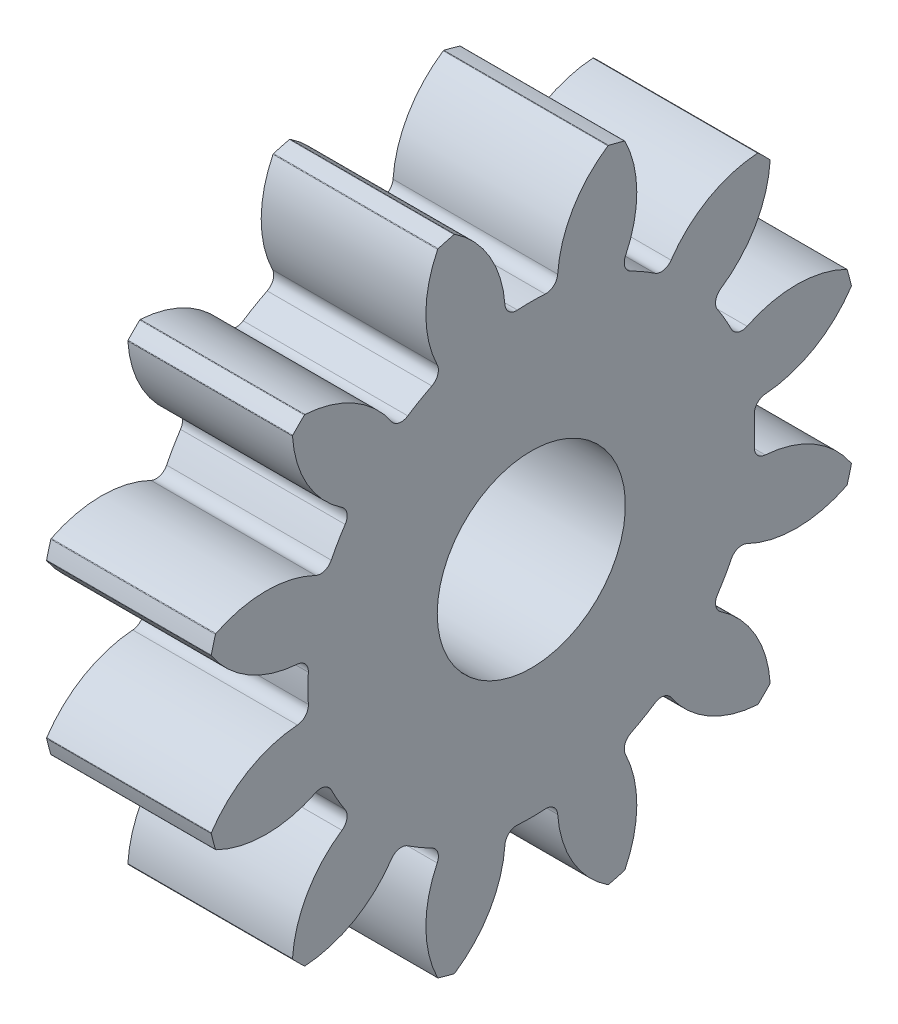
ISO-10303-21;
HEADER;
FILE_DESCRIPTION(('STEP AP214'),'2;1');
FILE_NAME('part.step','',(''),(''),'','','');
FILE_SCHEMA(('AUTOMOTIVE_DESIGN { 1 0 10303 214 1 1 1 1 }'));
ENDSEC;
DATA;
#1=APPLICATION_CONTEXT('core data for automotive mechanical design processes');
#2=APPLICATION_PROTOCOL_DEFINITION('international standard','automotive_design',2000,#1);
#3=PRODUCT_CONTEXT('',#1,'mechanical');
#4=PRODUCT('Part','Part','',(#3));
#5=PRODUCT_RELATED_PRODUCT_CATEGORY('part','',(#4));
#6=PRODUCT_DEFINITION_FORMATION('','',#4);
#7=PRODUCT_DEFINITION_CONTEXT('part definition',#1,'design');
#8=PRODUCT_DEFINITION('design','',#6,#7);
#9=PRODUCT_DEFINITION_SHAPE('','',#8);
#10=(LENGTH_UNIT() NAMED_UNIT(*) SI_UNIT(.MILLI.,.METRE.));
#11=(NAMED_UNIT(*) PLANE_ANGLE_UNIT() SI_UNIT($,.RADIAN.));
#12=(NAMED_UNIT(*) SI_UNIT($,.STERADIAN.) SOLID_ANGLE_UNIT());
#13=UNCERTAINTY_MEASURE_WITH_UNIT(LENGTH_MEASURE(1.E-05),#10,'distance_accuracy_value','');
#14=(GEOMETRIC_REPRESENTATION_CONTEXT(3) GLOBAL_UNCERTAINTY_ASSIGNED_CONTEXT((#13)) GLOBAL_UNIT_ASSIGNED_CONTEXT((#10,
#11,#12)) REPRESENTATION_CONTEXT('',''));
#15=CARTESIAN_POINT('',(0.,0.,0.));
#16=DIRECTION('',(0.,0.,1.));
#17=DIRECTION('',(1.,0.,0.));
#18=AXIS2_PLACEMENT_3D('',#15,#16,#17);
#19=CARTESIAN_POINT('',(7.,0.,0.));
#20=DIRECTION('',(-1.,0.,0.));
#21=DIRECTION('',(0.,0.,1.));
#22=AXIS2_PLACEMENT_3D('',#19,#20,#21);
#23=PLANE('',#22);
#24=CARTESIAN_POINT('',(7.,0.,0.));
#25=DIRECTION('',(-1.,0.,0.));
#26=DIRECTION('',(0.,0.,1.));
#27=AXIS2_PLACEMENT_3D('',#24,#25,#26);
#28=CIRCLE('',#27,4.);
#29=CARTESIAN_POINT('',(7.,0.,4.));
#30=VERTEX_POINT('',#29);
#31=EDGE_CURVE('E1163',#30,#30,#28,.T.);
#32=ORIENTED_EDGE('',*,*,#31,.T.);
#33=EDGE_LOOP('',(#32));
#34=FACE_BOUND('',#33,.T.);
#35=CARTESIAN_POINT('',(7.,0.,0.));
#36=DIRECTION('',(-1.,0.,0.));
#37=DIRECTION('',(0.,0.,1.));
#38=AXIS2_PLACEMENT_3D('',#35,#36,#37);
#39=CIRCLE('',#38,14.);
#40=CARTESIAN_POINT('',(7.,10.1427442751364,-9.65011598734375));
#41=VERTEX_POINT('',#40);
#42=CARTESIAN_POINT('',(7.,9.650115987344,-10.1427442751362));
#43=VERTEX_POINT('',#42);
#44=EDGE_CURVE('E1306',#41,#43,#39,.T.);
#45=ORIENTED_EDGE('',*,*,#44,.F.);
#46=CARTESIAN_POINT('',(7.,10.1137650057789,-9.62254422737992));
#47=DIRECTION('',(-1.,0.,0.));
#48=DIRECTION('',(0.,0.,1.));
#49=AXIS2_PLACEMENT_3D('',#46,#47,#48);
#50=CIRCLE('',#49,0.04);
#51=CARTESIAN_POINT('',(7.,10.1536871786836,-9.62005021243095));
#52=VERTEX_POINT('',#51);
#53=EDGE_CURVE('E942',#41,#52,#50,.F.);
#54=ORIENTED_EDGE('',*,*,#53,.T.);
#55=CARTESIAN_POINT('',(7.,5.36302643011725,-9.91933200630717));
#56=DIRECTION('',(-1.,0.,0.));
#57=DIRECTION('',(0.,-0.499999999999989,-0.866025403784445));
#58=AXIS2_PLACEMENT_3D('',#55,#56,#57);
#59=CIRCLE('',#58,4.8);
#60=CARTESIAN_POINT('',(7.,8.05220770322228,-5.94336620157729));
#61=VERTEX_POINT('',#60);
#62=EDGE_CURVE('E1149',#61,#52,#59,.T.);
#63=ORIENTED_EDGE('',*,*,#62,.F.);
#64=CARTESIAN_POINT('',(7.,8.33289099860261,-5.52837477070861));
#65=DIRECTION('',(-1.,0.,0.));
#66=DIRECTION('',(0.,0.,1.));
#67=AXIS2_PLACEMENT_3D('',#64,#65,#66);
#68=CIRCLE('',#67,0.501);
#69=CARTESIAN_POINT('',(7.,7.91541315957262,-5.25140319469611));
#70=VERTEX_POINT('',#69);
#71=EDGE_CURVE('E1141',#61,#70,#68,.T.);
#72=ORIENTED_EDGE('',*,*,#71,.T.);
#73=CARTESIAN_POINT('',(7.,0.,0.));
#74=DIRECTION('',(-1.,0.,0.));
#75=DIRECTION('',(0.,-0.499999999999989,-0.866025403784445));
#76=AXIS2_PLACEMENT_3D('',#73,#74,#75);
#77=CIRCLE('',#76,9.499);
#78=CARTESIAN_POINT('',(7.,8.50555515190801,-4.22924728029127));
#79=VERTEX_POINT('',#78);
#80=EDGE_CURVE('E1156',#79,#70,#77,.T.);
#81=ORIENTED_EDGE('',*,*,#80,.F.);
#82=CARTESIAN_POINT('',(7.,8.95415849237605,-4.45230790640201));
#83=DIRECTION('',(-1.,0.,0.));
#84=DIRECTION('',(0.,0.,1.));
#85=AXIS2_PLACEMENT_3D('',#82,#83,#84);
#86=CIRCLE('',#85,0.501);
#87=CARTESIAN_POINT('',(7.,9.173209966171,-4.00173332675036));
#88=VERTEX_POINT('',#87);
#89=EDGE_CURVE('E11',#79,#88,#86,.T.);
#90=ORIENTED_EDGE('',*,*,#89,.T.);
#91=CARTESIAN_POINT('',(7.,11.2719067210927,0.31514887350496));
#92=DIRECTION('',(-1.,0.,0.));
#93=DIRECTION('',(0.,-0.499999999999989,-0.866025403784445));
#94=AXIS2_PLACEMENT_3D('',#91,#92,#93);
#95=CIRCLE('',#94,4.8);
#96=CARTESIAN_POINT('',(7.,13.408051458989,-3.98332593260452));
#97=VERTEX_POINT('',#96);
#98=EDGE_CURVE('E1154',#97,#88,#95,.T.);
#99=ORIENTED_EDGE('',*,*,#98,.F.);
#100=CARTESIAN_POINT('',(7.,13.3902502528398,-3.94750530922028));
#101=DIRECTION('',(-1.,0.,0.));
#102=DIRECTION('',(0.,0.,1.));
#103=AXIS2_PLACEMENT_3D('',#100,#101,#102);
#104=CIRCLE('',#103,0.04);
#105=CARTESIAN_POINT('',(7.,13.4286177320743,-3.95881621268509));
#106=VERTEX_POINT('',#105);
#107=EDGE_CURVE('E940',#97,#106,#104,.F.);
#108=ORIENTED_EDGE('',*,*,#107,.T.);
#109=CARTESIAN_POINT('',(7.,13.6089322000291,-3.28587345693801));
#110=VERTEX_POINT('',#109);
#111=EDGE_CURVE('E656',#110,#106,#39,.T.);
#112=ORIENTED_EDGE('',*,*,#111,.F.);
#113=CARTESIAN_POINT('',(7.,13.5700495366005,-3.27648524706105));
#114=DIRECTION('',(-1.,0.,0.));
#115=DIRECTION('',(0.,0.,1.));
#116=AXIS2_PLACEMENT_3D('',#113,#114,#115);
#117=CIRCLE('',#116,0.04);
#118=CARTESIAN_POINT('',(7.,13.6033761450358,-3.25436428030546));
#119=VERTEX_POINT('',#118);
#120=EDGE_CURVE('E666',#110,#119,#117,.F.);
#121=ORIENTED_EDGE('',*,*,#120,.T.);
#122=CARTESIAN_POINT('',(7.,9.60418313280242,-5.90888029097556));
#123=DIRECTION('',(-1.,0.,0.));
#124=DIRECTION('',(0.,0.,-1.));
#125=AXIS2_PLACEMENT_3D('',#122,#123,#124);
#126=CIRCLE('',#125,4.8);
#127=CARTESIAN_POINT('',(7.,9.94509952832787,-1.12100226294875));
#128=VERTEX_POINT('',#127);
#129=EDGE_CURVE('E650',#128,#119,#126,.T.);
#130=ORIENTED_EDGE('',*,*,#129,.F.);
#131=CARTESIAN_POINT('',(7.,9.98068267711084,-0.621267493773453));
#132=DIRECTION('',(-1.,0.,0.));
#133=DIRECTION('',(0.,0.,1.));
#134=AXIS2_PLACEMENT_3D('',#131,#132,#133);
#135=CIRCLE('',#134,0.501);
#136=CARTESIAN_POINT('',(7.,9.48065047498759,-0.590141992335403));
#137=VERTEX_POINT('',#136);
#138=EDGE_CURVE('E682',#128,#137,#135,.T.);
#139=ORIENTED_EDGE('',*,*,#138,.T.);
#140=CARTESIAN_POINT('',(7.,0.,0.));
#141=DIRECTION('',(-1.,0.,0.));
#142=DIRECTION('',(0.,0.,-1.));
#143=AXIS2_PLACEMENT_3D('',#140,#141,#142);
#144=CIRCLE('',#143,9.499);
#145=CARTESIAN_POINT('',(7.,9.48065047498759,0.590141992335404));
#146=VERTEX_POINT('',#145);
#147=EDGE_CURVE('E1297',#146,#137,#144,.T.);
#148=ORIENTED_EDGE('',*,*,#147,.F.);
#149=CARTESIAN_POINT('',(7.,9.98068267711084,0.621267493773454));
#150=DIRECTION('',(-1.,0.,0.));
#151=DIRECTION('',(0.,0.,1.));
#152=AXIS2_PLACEMENT_3D('',#149,#150,#151);
#153=CIRCLE('',#152,0.501);
#154=CARTESIAN_POINT('',(7.,9.94509952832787,1.12100226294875));
#155=VERTEX_POINT('',#154);
#156=EDGE_CURVE('E686',#146,#155,#153,.T.);
#157=ORIENTED_EDGE('',*,*,#156,.T.);
#158=CARTESIAN_POINT('',(7.,9.60418313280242,5.90888029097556));
#159=DIRECTION('',(-1.,0.,0.));
#160=DIRECTION('',(0.,0.,-1.));
#161=AXIS2_PLACEMENT_3D('',#158,#159,#160);
#162=CIRCLE('',#161,4.8);
#163=CARTESIAN_POINT('',(7.,13.6033761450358,3.25436428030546));
#164=VERTEX_POINT('',#163);
#165=EDGE_CURVE('E1294',#164,#155,#162,.T.);
#166=ORIENTED_EDGE('',*,*,#165,.F.);
#167=CARTESIAN_POINT('',(7.,13.5700495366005,3.27648524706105));
#168=DIRECTION('',(-1.,0.,0.));
#169=DIRECTION('',(0.,0.,1.));
#170=AXIS2_PLACEMENT_3D('',#167,#168,#169);
#171=CIRCLE('',#170,0.04);
#172=CARTESIAN_POINT('',(7.,13.6089322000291,3.28587345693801));
#173=VERTEX_POINT('',#172);
#174=EDGE_CURVE('E663',#164,#173,#171,.F.);
#175=ORIENTED_EDGE('',*,*,#174,.T.);
#176=CARTESIAN_POINT('',(7.,13.4286177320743,3.95881621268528));
#177=VERTEX_POINT('',#176);
#178=EDGE_CURVE('E1303',#177,#173,#39,.T.);
#179=ORIENTED_EDGE('',*,*,#178,.F.);
#180=CARTESIAN_POINT('',(7.,13.3902502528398,3.94750530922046));
#181=DIRECTION('',(-1.,0.,0.));
#182=DIRECTION('',(0.,0.,1.));
#183=AXIS2_PLACEMENT_3D('',#180,#181,#182);
#184=CIRCLE('',#183,0.04);
#185=CARTESIAN_POINT('',(7.,13.4080514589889,3.98332593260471));
#186=VERTEX_POINT('',#185);
#187=EDGE_CURVE('E723',#177,#186,#184,.F.);
#188=ORIENTED_EDGE('',*,*,#187,.T.);
#189=CARTESIAN_POINT('',(7.,11.2719067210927,-0.315148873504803));
#190=DIRECTION('',(-1.,0.,0.));
#191=DIRECTION('',(0.,0.500000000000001,-0.866025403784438));
#192=AXIS2_PLACEMENT_3D('',#189,#190,#191);
#193=CIRCLE('',#192,4.8);
#194=CARTESIAN_POINT('',(7.,9.17320996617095,4.00173332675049));
#195=VERTEX_POINT('',#194);
#196=EDGE_CURVE('E1282',#195,#186,#193,.T.);
#197=ORIENTED_EDGE('',*,*,#196,.F.);
#198=CARTESIAN_POINT('',(7.,8.95415849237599,4.45230790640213));
#199=DIRECTION('',(-1.,0.,0.));
#200=DIRECTION('',(0.,0.,1.));
#201=AXIS2_PLACEMENT_3D('',#198,#199,#200);
#202=CIRCLE('',#201,0.501);
#203=CARTESIAN_POINT('',(7.,8.50555515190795,4.22924728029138));
#204=VERTEX_POINT('',#203);
#205=EDGE_CURVE('E962',#195,#204,#202,.T.);
#206=ORIENTED_EDGE('',*,*,#205,.T.);
#207=CARTESIAN_POINT('',(7.,0.,0.));
#208=DIRECTION('',(-1.,0.,0.));
#209=DIRECTION('',(0.,0.500000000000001,-0.866025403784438));
#210=AXIS2_PLACEMENT_3D('',#207,#208,#209);
#211=CIRCLE('',#210,9.499);
#212=CARTESIAN_POINT('',(7.,7.91541315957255,5.25140319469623));
#213=VERTEX_POINT('',#212);
#214=EDGE_CURVE('E636',#213,#204,#211,.T.);
#215=ORIENTED_EDGE('',*,*,#214,.F.);
#216=CARTESIAN_POINT('',(7.,8.33289099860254,5.52837477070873));
#217=DIRECTION('',(-1.,0.,0.));
#218=DIRECTION('',(0.,0.,1.));
#219=AXIS2_PLACEMENT_3D('',#216,#217,#218);
#220=CIRCLE('',#219,0.501);
#221=CARTESIAN_POINT('',(7.,8.05220770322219,5.94336620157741));
#222=VERTEX_POINT('',#221);
#223=EDGE_CURVE('E966',#213,#222,#220,.T.);
#224=ORIENTED_EDGE('',*,*,#223,.T.);
#225=CARTESIAN_POINT('',(7.,5.36302643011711,9.91933200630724));
#226=DIRECTION('',(-1.,0.,0.));
#227=DIRECTION('',(0.,0.500000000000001,-0.866025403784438));
#228=AXIS2_PLACEMENT_3D('',#225,#226,#227);
#229=CIRCLE('',#228,4.8);
#230=CARTESIAN_POINT('',(7.,10.1536871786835,9.62005021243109));
#231=VERTEX_POINT('',#230);
#232=EDGE_CURVE('E1284',#231,#222,#229,.T.);
#233=ORIENTED_EDGE('',*,*,#232,.F.);
#234=CARTESIAN_POINT('',(7.,10.1137650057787,9.62254422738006));
#235=DIRECTION('',(-1.,0.,0.));
#236=DIRECTION('',(0.,0.,1.));
#237=AXIS2_PLACEMENT_3D('',#234,#235,#236);
#238=CIRCLE('',#237,0.04);
#239=CARTESIAN_POINT('',(7.,10.1427442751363,9.6501159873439));
#240=VERTEX_POINT('',#239);
#241=EDGE_CURVE('E720',#231,#240,#238,.F.);
#242=ORIENTED_EDGE('',*,*,#241,.T.);
#243=CARTESIAN_POINT('',(7.,9.65011598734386,10.1427442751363));
#244=VERTEX_POINT('',#243);
#245=EDGE_CURVE('E1311',#244,#240,#39,.T.);
#246=ORIENTED_EDGE('',*,*,#245,.F.);
#247=CARTESIAN_POINT('',(7.,9.62254422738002,10.1137650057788));
#248=DIRECTION('',(-1.,0.,0.));
#249=DIRECTION('',(0.,0.,1.));
#250=AXIS2_PLACEMENT_3D('',#247,#248,#249);
#251=CIRCLE('',#250,0.04);
#252=CARTESIAN_POINT('',(7.,9.62005021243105,10.1536871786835));
#253=VERTEX_POINT('',#252);
#254=EDGE_CURVE('E745',#244,#253,#251,.F.);
#255=ORIENTED_EDGE('',*,*,#254,.T.);
#256=CARTESIAN_POINT('',(7.,9.91933200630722,5.36302643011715));
#257=DIRECTION('',(-1.,0.,0.));
#258=DIRECTION('',(0.,0.86602540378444,-0.499999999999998));
#259=AXIS2_PLACEMENT_3D('',#256,#257,#258);
#260=CIRCLE('',#259,4.8);
#261=CARTESIAN_POINT('',(7.,5.94336620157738,8.05220770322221));
#262=VERTEX_POINT('',#261);
#263=EDGE_CURVE('E1269',#262,#253,#260,.T.);
#264=ORIENTED_EDGE('',*,*,#263,.F.);
#265=CARTESIAN_POINT('',(7.,5.5283747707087,8.33289099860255));
#266=DIRECTION('',(-1.,0.,0.));
#267=DIRECTION('',(0.,0.,1.));
#268=AXIS2_PLACEMENT_3D('',#265,#266,#267);
#269=CIRCLE('',#268,0.501);
#270=CARTESIAN_POINT('',(7.,5.2514031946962,7.91541315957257));
#271=VERTEX_POINT('',#270);
#272=EDGE_CURVE('E980',#262,#271,#269,.T.);
#273=ORIENTED_EDGE('',*,*,#272,.T.);
#274=CARTESIAN_POINT('',(7.,0.,0.));
#275=DIRECTION('',(-1.,0.,0.));
#276=DIRECTION('',(0.,0.86602540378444,-0.499999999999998));
#277=AXIS2_PLACEMENT_3D('',#274,#275,#276);
#278=CIRCLE('',#277,9.499);
#279=CARTESIAN_POINT('',(7.,4.22924728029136,8.50555515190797));
#280=VERTEX_POINT('',#279);
#281=EDGE_CURVE('E1275',#280,#271,#278,.T.);
#282=ORIENTED_EDGE('',*,*,#281,.F.);
#283=CARTESIAN_POINT('',(7.,4.4523079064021,8.954158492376));
#284=DIRECTION('',(-1.,0.,0.));
#285=DIRECTION('',(0.,0.,1.));
#286=AXIS2_PLACEMENT_3D('',#283,#284,#285);
#287=CIRCLE('',#286,0.501);
#288=CARTESIAN_POINT('',(7.,4.00173332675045,9.17320996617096));
#289=VERTEX_POINT('',#288);
#290=EDGE_CURVE('E984',#280,#289,#287,.T.);
#291=ORIENTED_EDGE('',*,*,#290,.T.);
#292=CARTESIAN_POINT('',(7.,-0.315148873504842,11.2719067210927));
#293=DIRECTION('',(-1.,0.,0.));
#294=DIRECTION('',(0.,0.86602540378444,-0.499999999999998));
#295=AXIS2_PLACEMENT_3D('',#292,#293,#294);
#296=CIRCLE('',#295,4.8);
#297=CARTESIAN_POINT('',(7.,3.98332593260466,13.4080514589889));
#298=VERTEX_POINT('',#297);
#299=EDGE_CURVE('E1271',#298,#289,#296,.T.);
#300=ORIENTED_EDGE('',*,*,#299,.F.);
#301=CARTESIAN_POINT('',(7.,3.94750530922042,13.3902502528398));
#302=DIRECTION('',(-1.,0.,0.));
#303=DIRECTION('',(0.,0.,1.));
#304=AXIS2_PLACEMENT_3D('',#301,#302,#303);
#305=CIRCLE('',#304,0.04);
#306=CARTESIAN_POINT('',(7.,3.95881621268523,13.4286177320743));
#307=VERTEX_POINT('',#306);
#308=EDGE_CURVE('E742',#298,#307,#305,.F.);
#309=ORIENTED_EDGE('',*,*,#308,.T.);
#310=CARTESIAN_POINT('',(7.,3.28587345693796,13.6089322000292));
#311=VERTEX_POINT('',#310);
#312=EDGE_CURVE('E1314',#311,#307,#39,.T.);
#313=ORIENTED_EDGE('',*,*,#312,.F.);
#314=CARTESIAN_POINT('',(7.,3.276485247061,13.5700495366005));
#315=DIRECTION('',(-1.,0.,0.));
#316=DIRECTION('',(0.,0.,1.));
#317=AXIS2_PLACEMENT_3D('',#314,#315,#316);
#318=CIRCLE('',#317,0.04);
#319=CARTESIAN_POINT('',(7.,3.25436428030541,13.6033761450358));
#320=VERTEX_POINT('',#319);
#321=EDGE_CURVE('E767',#311,#320,#318,.F.);
#322=ORIENTED_EDGE('',*,*,#321,.T.);
#323=CARTESIAN_POINT('',(7.,5.90888029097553,9.60418313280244));
#324=DIRECTION('',(-1.,0.,0.));
#325=DIRECTION('',(0.,1.,0.));
#326=AXIS2_PLACEMENT_3D('',#323,#324,#325);
#327=CIRCLE('',#326,4.8);
#328=CARTESIAN_POINT('',(7.,1.12100226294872,9.94509952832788));
#329=VERTEX_POINT('',#328);
#330=EDGE_CURVE('E1256',#329,#320,#327,.T.);
#331=ORIENTED_EDGE('',*,*,#330,.F.);
#332=CARTESIAN_POINT('',(7.,0.621267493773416,9.98068267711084));
#333=DIRECTION('',(-1.,0.,0.));
#334=DIRECTION('',(0.,0.,1.));
#335=AXIS2_PLACEMENT_3D('',#332,#333,#334);
#336=CIRCLE('',#335,0.501);
#337=CARTESIAN_POINT('',(7.,0.590141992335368,9.48065047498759));
#338=VERTEX_POINT('',#337);
#339=EDGE_CURVE('E998',#329,#338,#336,.T.);
#340=ORIENTED_EDGE('',*,*,#339,.T.);
#341=CARTESIAN_POINT('',(7.,0.,0.));
#342=DIRECTION('',(-1.,0.,0.));
#343=DIRECTION('',(0.,1.,0.));
#344=AXIS2_PLACEMENT_3D('',#341,#342,#343);
#345=CIRCLE('',#344,9.499);
#346=CARTESIAN_POINT('',(7.,-0.590141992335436,9.48065047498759));
#347=VERTEX_POINT('',#346);
#348=EDGE_CURVE('E1262',#347,#338,#345,.T.);
#349=ORIENTED_EDGE('',*,*,#348,.F.);
#350=CARTESIAN_POINT('',(7.,-0.621267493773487,9.98068267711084));
#351=DIRECTION('',(-1.,0.,0.));
#352=DIRECTION('',(0.,0.,1.));
#353=AXIS2_PLACEMENT_3D('',#350,#351,#352);
#354=CIRCLE('',#353,0.501);
#355=CARTESIAN_POINT('',(7.,-1.12100226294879,9.94509952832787));
#356=VERTEX_POINT('',#355);
#357=EDGE_CURVE('E1002',#347,#356,#354,.T.);
#358=ORIENTED_EDGE('',*,*,#357,.T.);
#359=CARTESIAN_POINT('',(7.,-5.9088802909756,9.6041831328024));
#360=DIRECTION('',(-1.,0.,0.));
#361=DIRECTION('',(0.,1.,0.));
#362=AXIS2_PLACEMENT_3D('',#359,#360,#361);
#363=CIRCLE('',#362,4.8);
#364=CARTESIAN_POINT('',(7.,-3.25436428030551,13.6033761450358));
#365=VERTEX_POINT('',#364);
#366=EDGE_CURVE('E1258',#365,#356,#363,.T.);
#367=ORIENTED_EDGE('',*,*,#366,.F.);
#368=CARTESIAN_POINT('',(7.,-3.27648524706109,13.5700495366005));
#369=DIRECTION('',(-1.,0.,0.));
#370=DIRECTION('',(0.,0.,1.));
#371=AXIS2_PLACEMENT_3D('',#368,#369,#370);
#372=CIRCLE('',#371,0.04);
#373=CARTESIAN_POINT('',(7.,-3.28587345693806,13.6089322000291));
#374=VERTEX_POINT('',#373);
#375=EDGE_CURVE('E764',#365,#374,#372,.F.);
#376=ORIENTED_EDGE('',*,*,#375,.T.);
#377=CARTESIAN_POINT('',(7.,-3.95881621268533,13.4286177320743));
#378=VERTEX_POINT('',#377);
#379=EDGE_CURVE('E1317',#378,#374,#39,.T.);
#380=ORIENTED_EDGE('',*,*,#379,.F.);
#381=CARTESIAN_POINT('',(7.,-3.94750530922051,13.3902502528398));
#382=DIRECTION('',(-1.,0.,0.));
#383=DIRECTION('',(0.,0.,1.));
#384=AXIS2_PLACEMENT_3D('',#381,#382,#383);
#385=CIRCLE('',#384,0.04);
#386=CARTESIAN_POINT('',(7.,-3.98332593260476,13.4080514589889));
#387=VERTEX_POINT('',#386);
#388=EDGE_CURVE('E789',#378,#387,#385,.F.);
#389=ORIENTED_EDGE('',*,*,#388,.T.);
#390=CARTESIAN_POINT('',(7.,0.315148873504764,11.2719067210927));
#391=DIRECTION('',(-1.,0.,0.));
#392=DIRECTION('',(0.,0.866025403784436,0.500000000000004));
#393=AXIS2_PLACEMENT_3D('',#390,#391,#392);
#394=CIRCLE('',#393,4.8);
#395=CARTESIAN_POINT('',(7.,-4.00173332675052,9.17320996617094));
#396=VERTEX_POINT('',#395);
#397=EDGE_CURVE('E1243',#396,#387,#394,.T.);
#398=ORIENTED_EDGE('',*,*,#397,.F.);
#399=CARTESIAN_POINT('',(7.,-4.45230790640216,8.95415849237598));
#400=DIRECTION('',(-1.,0.,0.));
#401=DIRECTION('',(0.,0.,1.));
#402=AXIS2_PLACEMENT_3D('',#399,#400,#401);
#403=CIRCLE('',#402,0.501);
#404=CARTESIAN_POINT('',(7.,-4.22924728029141,8.50555515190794));
#405=VERTEX_POINT('',#404);
#406=EDGE_CURVE('E1016',#396,#405,#403,.T.);
#407=ORIENTED_EDGE('',*,*,#406,.T.);
#408=CARTESIAN_POINT('',(7.,0.,0.));
#409=DIRECTION('',(-1.,0.,0.));
#410=DIRECTION('',(0.,0.866025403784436,0.500000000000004));
#411=AXIS2_PLACEMENT_3D('',#408,#409,#410);
#412=CIRCLE('',#411,9.499);
#413=CARTESIAN_POINT('',(7.,-5.25140319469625,7.91541315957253));
#414=VERTEX_POINT('',#413);
#415=EDGE_CURVE('E1249',#414,#405,#412,.T.);
#416=ORIENTED_EDGE('',*,*,#415,.F.);
#417=CARTESIAN_POINT('',(7.,-5.52837477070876,8.33289099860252));
#418=DIRECTION('',(-1.,0.,0.));
#419=DIRECTION('',(0.,0.,1.));
#420=AXIS2_PLACEMENT_3D('',#417,#418,#419);
#421=CIRCLE('',#420,0.501);
#422=CARTESIAN_POINT('',(7.,-5.94336620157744,8.05220770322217));
#423=VERTEX_POINT('',#422);
#424=EDGE_CURVE('E1020',#414,#423,#421,.T.);
#425=ORIENTED_EDGE('',*,*,#424,.T.);
#426=CARTESIAN_POINT('',(7.,-9.91933200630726,5.36302643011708));
#427=DIRECTION('',(-1.,0.,0.));
#428=DIRECTION('',(0.,0.866025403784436,0.500000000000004));
#429=AXIS2_PLACEMENT_3D('',#426,#427,#428);
#430=CIRCLE('',#429,4.8);
#431=CARTESIAN_POINT('',(7.,-9.62005021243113,10.1536871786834));
#432=VERTEX_POINT('',#431);
#433=EDGE_CURVE('E1245',#432,#423,#430,.T.);
#434=ORIENTED_EDGE('',*,*,#433,.F.);
#435=CARTESIAN_POINT('',(7.,-9.62254422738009,10.1137650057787));
#436=DIRECTION('',(-1.,0.,0.));
#437=DIRECTION('',(0.,0.,1.));
#438=AXIS2_PLACEMENT_3D('',#435,#436,#437);
#439=CIRCLE('',#438,0.04);
#440=CARTESIAN_POINT('',(7.,-9.65011598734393,10.1427442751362));
#441=VERTEX_POINT('',#440);
#442=EDGE_CURVE('E786',#432,#441,#439,.F.);
#443=ORIENTED_EDGE('',*,*,#442,.T.);
#444=CARTESIAN_POINT('',(7.,-10.1427442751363,9.65011598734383));
#445=VERTEX_POINT('',#444);
#446=EDGE_CURVE('E1320',#445,#441,#39,.T.);
#447=ORIENTED_EDGE('',*,*,#446,.F.);
#448=CARTESIAN_POINT('',(7.,-10.1137650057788,9.62254422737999));
#449=DIRECTION('',(-1.,0.,0.));
#450=DIRECTION('',(0.,0.,1.));
#451=AXIS2_PLACEMENT_3D('',#448,#449,#450);
#452=CIRCLE('',#451,0.04);
#453=CARTESIAN_POINT('',(7.,-10.1536871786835,9.62005021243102));
#454=VERTEX_POINT('',#453);
#455=EDGE_CURVE('E811',#445,#454,#452,.F.);
#456=ORIENTED_EDGE('',*,*,#455,.T.);
#457=CARTESIAN_POINT('',(7.,-5.36302643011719,9.9193320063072));
#458=DIRECTION('',(-1.,0.,0.));
#459=DIRECTION('',(0.,0.499999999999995,0.866025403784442));
#460=AXIS2_PLACEMENT_3D('',#457,#458,#459);
#461=CIRCLE('',#460,4.8);
#462=CARTESIAN_POINT('',(7.,-8.05220770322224,5.94336620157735));
#463=VERTEX_POINT('',#462);
#464=EDGE_CURVE('E1230',#463,#454,#461,.T.);
#465=ORIENTED_EDGE('',*,*,#464,.F.);
#466=CARTESIAN_POINT('',(7.,-8.33289099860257,5.52837477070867));
#467=DIRECTION('',(-1.,0.,0.));
#468=DIRECTION('',(0.,0.,1.));
#469=AXIS2_PLACEMENT_3D('',#466,#467,#468);
#470=CIRCLE('',#469,0.501);
#471=CARTESIAN_POINT('',(7.,-7.91541315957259,5.25140319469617));
#472=VERTEX_POINT('',#471);
#473=EDGE_CURVE('E1034',#463,#472,#470,.T.);
#474=ORIENTED_EDGE('',*,*,#473,.T.);
#475=CARTESIAN_POINT('',(7.,0.,0.));
#476=DIRECTION('',(-1.,0.,0.));
#477=DIRECTION('',(0.,0.499999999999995,0.866025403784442));
#478=AXIS2_PLACEMENT_3D('',#475,#476,#477);
#479=CIRCLE('',#478,9.499);
#480=CARTESIAN_POINT('',(7.,-8.50555515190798,4.22924728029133));
#481=VERTEX_POINT('',#480);
#482=EDGE_CURVE('E1236',#481,#472,#479,.T.);
#483=ORIENTED_EDGE('',*,*,#482,.F.);
#484=CARTESIAN_POINT('',(7.,-8.95415849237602,4.45230790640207));
#485=DIRECTION('',(-1.,0.,0.));
#486=DIRECTION('',(0.,0.,1.));
#487=AXIS2_PLACEMENT_3D('',#484,#485,#486);
#488=CIRCLE('',#487,0.501);
#489=CARTESIAN_POINT('',(7.,-9.17320996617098,4.00173332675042));
#490=VERTEX_POINT('',#489);
#491=EDGE_CURVE('E1038',#481,#490,#488,.T.);
#492=ORIENTED_EDGE('',*,*,#491,.T.);
#493=CARTESIAN_POINT('',(7.,-11.2719067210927,-0.315148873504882));
#494=DIRECTION('',(-1.,0.,0.));
#495=DIRECTION('',(0.,0.499999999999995,0.866025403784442));
#496=AXIS2_PLACEMENT_3D('',#493,#494,#495);
#497=CIRCLE('',#496,4.8);
#498=CARTESIAN_POINT('',(7.,-13.408051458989,3.98332593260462));
#499=VERTEX_POINT('',#498);
#500=EDGE_CURVE('E1232',#499,#490,#497,.T.);
#501=ORIENTED_EDGE('',*,*,#500,.F.);
#502=CARTESIAN_POINT('',(7.,-13.3902502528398,3.94750530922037));
#503=DIRECTION('',(-1.,0.,0.));
#504=DIRECTION('',(0.,0.,1.));
#505=AXIS2_PLACEMENT_3D('',#502,#503,#504);
#506=CIRCLE('',#505,0.04);
#507=CARTESIAN_POINT('',(7.,-13.4286177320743,3.95881621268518));
#508=VERTEX_POINT('',#507);
#509=EDGE_CURVE('E808',#499,#508,#506,.F.);
#510=ORIENTED_EDGE('',*,*,#509,.T.);
#511=CARTESIAN_POINT('',(7.,-13.6089322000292,3.28587345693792));
#512=VERTEX_POINT('',#511);
#513=EDGE_CURVE('E1323',#512,#508,#39,.T.);
#514=ORIENTED_EDGE('',*,*,#513,.F.);
#515=CARTESIAN_POINT('',(7.,-13.5700495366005,3.27648524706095));
#516=DIRECTION('',(-1.,0.,0.));
#517=DIRECTION('',(0.,0.,1.));
#518=AXIS2_PLACEMENT_3D('',#515,#516,#517);
#519=CIRCLE('',#518,0.04);
#520=CARTESIAN_POINT('',(7.,-13.6033761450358,3.25436428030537));
#521=VERTEX_POINT('',#520);
#522=EDGE_CURVE('E833',#512,#521,#519,.F.);
#523=ORIENTED_EDGE('',*,*,#522,.T.);
#524=CARTESIAN_POINT('',(7.,-9.60418313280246,5.9088802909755));
#525=DIRECTION('',(-1.,0.,0.));
#526=DIRECTION('',(0.,0.,1.));
#527=AXIS2_PLACEMENT_3D('',#524,#525,#526);
#528=CIRCLE('',#527,4.8);
#529=CARTESIAN_POINT('',(7.,-9.94509952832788,1.12100226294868));
#530=VERTEX_POINT('',#529);
#531=EDGE_CURVE('E1217',#530,#521,#528,.T.);
#532=ORIENTED_EDGE('',*,*,#531,.F.);
#533=CARTESIAN_POINT('',(7.,-9.98068267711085,0.621267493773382));
#534=DIRECTION('',(-1.,0.,0.));
#535=DIRECTION('',(0.,0.,1.));
#536=AXIS2_PLACEMENT_3D('',#533,#534,#535);
#537=CIRCLE('',#536,0.501);
#538=CARTESIAN_POINT('',(7.,-9.48065047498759,0.590141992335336));
#539=VERTEX_POINT('',#538);
#540=EDGE_CURVE('E1052',#530,#539,#537,.T.);
#541=ORIENTED_EDGE('',*,*,#540,.T.);
#542=CARTESIAN_POINT('',(7.,0.,0.));
#543=DIRECTION('',(-1.,0.,0.));
#544=DIRECTION('',(0.,0.,1.));
#545=AXIS2_PLACEMENT_3D('',#542,#543,#544);
#546=CIRCLE('',#545,9.499);
#547=CARTESIAN_POINT('',(7.,-9.48065047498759,-0.590141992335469));
#548=VERTEX_POINT('',#547);
#549=EDGE_CURVE('E1223',#548,#539,#546,.T.);
#550=ORIENTED_EDGE('',*,*,#549,.F.);
#551=CARTESIAN_POINT('',(7.,-9.98068267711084,-0.621267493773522));
#552=DIRECTION('',(-1.,0.,0.));
#553=DIRECTION('',(0.,0.,1.));
#554=AXIS2_PLACEMENT_3D('',#551,#552,#553);
#555=CIRCLE('',#554,0.501);
#556=CARTESIAN_POINT('',(7.,-9.94509952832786,-1.12100226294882));
#557=VERTEX_POINT('',#556);
#558=EDGE_CURVE('E1056',#548,#557,#555,.T.);
#559=ORIENTED_EDGE('',*,*,#558,.T.);
#560=CARTESIAN_POINT('',(7.,-9.60418313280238,-5.90888029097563));
#561=DIRECTION('',(-1.,0.,0.));
#562=DIRECTION('',(0.,0.,1.));
#563=AXIS2_PLACEMENT_3D('',#560,#561,#562);
#564=CIRCLE('',#563,4.8);
#565=CARTESIAN_POINT('',(7.,-13.6033761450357,-3.25436428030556));
#566=VERTEX_POINT('',#565);
#567=EDGE_CURVE('E1219',#566,#557,#564,.T.);
#568=ORIENTED_EDGE('',*,*,#567,.F.);
#569=CARTESIAN_POINT('',(7.,-13.5700495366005,-3.27648524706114));
#570=DIRECTION('',(-1.,0.,0.));
#571=DIRECTION('',(0.,0.,1.));
#572=AXIS2_PLACEMENT_3D('',#569,#570,#571);
#573=CIRCLE('',#572,0.04);
#574=CARTESIAN_POINT('',(7.,-13.6089322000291,-3.28587345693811));
#575=VERTEX_POINT('',#574);
#576=EDGE_CURVE('E830',#566,#575,#573,.F.);
#577=ORIENTED_EDGE('',*,*,#576,.T.);
#578=CARTESIAN_POINT('',(7.,-13.4286177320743,-3.95881621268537));
#579=VERTEX_POINT('',#578);
#580=EDGE_CURVE('E1326',#579,#575,#39,.T.);
#581=ORIENTED_EDGE('',*,*,#580,.F.);
#582=CARTESIAN_POINT('',(7.,-13.3902502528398,-3.94750530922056));
#583=DIRECTION('',(-1.,0.,0.));
#584=DIRECTION('',(0.,0.,1.));
#585=AXIS2_PLACEMENT_3D('',#582,#583,#584);
#586=CIRCLE('',#585,0.04);
#587=CARTESIAN_POINT('',(7.,-13.4080514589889,-3.9833259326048));
#588=VERTEX_POINT('',#587);
#589=EDGE_CURVE('E855',#579,#588,#586,.F.);
#590=ORIENTED_EDGE('',*,*,#589,.T.);
#591=CARTESIAN_POINT('',(7.,-11.2719067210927,0.315148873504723));
#592=DIRECTION('',(-1.,0.,0.));
#593=DIRECTION('',(0.,-0.500000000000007,0.866025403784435));
#594=AXIS2_PLACEMENT_3D('',#591,#592,#593);
#595=CIRCLE('',#594,4.8);
#596=CARTESIAN_POINT('',(7.,-9.17320996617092,-4.00173332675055));
#597=VERTEX_POINT('',#596);
#598=EDGE_CURVE('E1204',#597,#588,#595,.T.);
#599=ORIENTED_EDGE('',*,*,#598,.F.);
#600=CARTESIAN_POINT('',(7.,-8.95415849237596,-4.45230790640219));
#601=DIRECTION('',(-1.,0.,0.));
#602=DIRECTION('',(0.,0.,1.));
#603=AXIS2_PLACEMENT_3D('',#600,#601,#602);
#604=CIRCLE('',#603,0.501);
#605=CARTESIAN_POINT('',(7.,-8.50555515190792,-4.22924728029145));
#606=VERTEX_POINT('',#605);
#607=EDGE_CURVE('E1070',#597,#606,#604,.T.);
#608=ORIENTED_EDGE('',*,*,#607,.T.);
#609=CARTESIAN_POINT('',(7.,0.,0.));
#610=DIRECTION('',(-1.,0.,0.));
#611=DIRECTION('',(0.,-0.500000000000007,0.866025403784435));
#612=AXIS2_PLACEMENT_3D('',#609,#610,#611);
#613=CIRCLE('',#612,9.499);
#614=CARTESIAN_POINT('',(7.,-7.91541315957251,-5.25140319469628));
#615=VERTEX_POINT('',#614);
#616=EDGE_CURVE('E1210',#615,#606,#613,.T.);
#617=ORIENTED_EDGE('',*,*,#616,.F.);
#618=CARTESIAN_POINT('',(7.,-8.3328909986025,-5.52837477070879));
#619=DIRECTION('',(-1.,0.,0.));
#620=DIRECTION('',(0.,0.,1.));
#621=AXIS2_PLACEMENT_3D('',#618,#619,#620);
#622=CIRCLE('',#621,0.501);
#623=CARTESIAN_POINT('',(7.,-8.05220770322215,-5.94336620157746));
#624=VERTEX_POINT('',#623);
#625=EDGE_CURVE('E1074',#615,#624,#622,.T.);
#626=ORIENTED_EDGE('',*,*,#625,.T.);
#627=CARTESIAN_POINT('',(7.,-5.36302643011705,-9.91933200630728));
#628=DIRECTION('',(-1.,0.,0.));
#629=DIRECTION('',(0.,-0.500000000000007,0.866025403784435));
#630=AXIS2_PLACEMENT_3D('',#627,#628,#629);
#631=CIRCLE('',#630,4.8);
#632=CARTESIAN_POINT('',(7.,-10.1536871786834,-9.62005021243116));
#633=VERTEX_POINT('',#632);
#634=EDGE_CURVE('E1206',#633,#624,#631,.T.);
#635=ORIENTED_EDGE('',*,*,#634,.F.);
#636=CARTESIAN_POINT('',(7.,-10.1137650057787,-9.62254422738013));
#637=DIRECTION('',(-1.,0.,0.));
#638=DIRECTION('',(0.,0.,1.));
#639=AXIS2_PLACEMENT_3D('',#636,#637,#638);
#640=CIRCLE('',#639,0.04);
#641=CARTESIAN_POINT('',(7.,-10.1427442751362,-9.65011598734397));
#642=VERTEX_POINT('',#641);
#643=EDGE_CURVE('E852',#633,#642,#640,.F.);
#644=ORIENTED_EDGE('',*,*,#643,.T.);
#645=CARTESIAN_POINT('',(7.,-9.65011598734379,-10.1427442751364));
#646=VERTEX_POINT('',#645);
#647=EDGE_CURVE('E1329',#646,#642,#39,.T.);
#648=ORIENTED_EDGE('',*,*,#647,.F.);
#649=CARTESIAN_POINT('',(7.,-9.62254422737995,-10.1137650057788));
#650=DIRECTION('',(-1.,0.,0.));
#651=DIRECTION('',(0.,0.,1.));
#652=AXIS2_PLACEMENT_3D('',#649,#650,#651);
#653=CIRCLE('',#652,0.04);
#654=CARTESIAN_POINT('',(7.,-9.62005021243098,-10.1536871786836));
#655=VERTEX_POINT('',#654);
#656=EDGE_CURVE('E877',#646,#655,#653,.F.);
#657=ORIENTED_EDGE('',*,*,#656,.T.);
#658=CARTESIAN_POINT('',(7.,-9.91933200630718,-5.36302643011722));
#659=DIRECTION('',(-1.,0.,0.));
#660=DIRECTION('',(0.,-0.866025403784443,0.499999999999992));
#661=AXIS2_PLACEMENT_3D('',#658,#659,#660);
#662=CIRCLE('',#661,4.8);
#663=CARTESIAN_POINT('',(7.,-5.94336620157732,-8.05220770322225));
#664=VERTEX_POINT('',#663);
#665=EDGE_CURVE('E1191',#664,#655,#662,.T.);
#666=ORIENTED_EDGE('',*,*,#665,.F.);
#667=CARTESIAN_POINT('',(7.,-5.52837477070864,-8.33289099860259));
#668=DIRECTION('',(-1.,0.,0.));
#669=DIRECTION('',(0.,0.,1.));
#670=AXIS2_PLACEMENT_3D('',#667,#668,#669);
#671=CIRCLE('',#670,0.501);
#672=CARTESIAN_POINT('',(7.,-5.25140319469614,-7.9154131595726));
#673=VERTEX_POINT('',#672);
#674=EDGE_CURVE('E1088',#664,#673,#671,.T.);
#675=ORIENTED_EDGE('',*,*,#674,.T.);
#676=CARTESIAN_POINT('',(7.,0.,0.));
#677=DIRECTION('',(-1.,0.,0.));
#678=DIRECTION('',(0.,-0.866025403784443,0.499999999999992));
#679=AXIS2_PLACEMENT_3D('',#676,#677,#678);
#680=CIRCLE('',#679,9.499);
#681=CARTESIAN_POINT('',(7.,-4.2292472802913,-8.505555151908));
#682=VERTEX_POINT('',#681);
#683=EDGE_CURVE('E1197',#682,#673,#680,.T.);
#684=ORIENTED_EDGE('',*,*,#683,.F.);
#685=CARTESIAN_POINT('',(7.,-4.45230790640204,-8.95415849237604));
#686=DIRECTION('',(-1.,0.,0.));
#687=DIRECTION('',(0.,0.,1.));
#688=AXIS2_PLACEMENT_3D('',#685,#686,#687);
#689=CIRCLE('',#688,0.501);
#690=CARTESIAN_POINT('',(7.,-4.00173332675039,-9.17320996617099));
#691=VERTEX_POINT('',#690);
#692=EDGE_CURVE('E1092',#682,#691,#689,.T.);
#693=ORIENTED_EDGE('',*,*,#692,.T.);
#694=CARTESIAN_POINT('',(7.,0.31514887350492,-11.2719067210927));
#695=DIRECTION('',(-1.,0.,0.));
#696=DIRECTION('',(0.,-0.866025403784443,0.499999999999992));
#697=AXIS2_PLACEMENT_3D('',#694,#695,#696);
#698=CIRCLE('',#697,4.8);
#699=CARTESIAN_POINT('',(7.,-3.98332593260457,-13.408051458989));
#700=VERTEX_POINT('',#699);
#701=EDGE_CURVE('E1193',#700,#691,#698,.T.);
#702=ORIENTED_EDGE('',*,*,#701,.F.);
#703=CARTESIAN_POINT('',(7.,-3.94750530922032,-13.3902502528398));
#704=DIRECTION('',(-1.,0.,0.));
#705=DIRECTION('',(0.,0.,1.));
#706=AXIS2_PLACEMENT_3D('',#703,#704,#705);
#707=CIRCLE('',#706,0.04);
#708=CARTESIAN_POINT('',(7.,-3.95881621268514,-13.4286177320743));
#709=VERTEX_POINT('',#708);
#710=EDGE_CURVE('E874',#700,#709,#707,.F.);
#711=ORIENTED_EDGE('',*,*,#710,.T.);
#712=CARTESIAN_POINT('',(7.,-3.28587345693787,-13.6089322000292));
#713=VERTEX_POINT('',#712);
#714=EDGE_CURVE('E1332',#713,#709,#39,.T.);
#715=ORIENTED_EDGE('',*,*,#714,.F.);
#716=CARTESIAN_POINT('',(7.,-3.2764852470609,-13.5700495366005));
#717=DIRECTION('',(-1.,0.,0.));
#718=DIRECTION('',(0.,0.,1.));
#719=AXIS2_PLACEMENT_3D('',#716,#717,#718);
#720=CIRCLE('',#719,0.04);
#721=CARTESIAN_POINT('',(7.,-3.25436428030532,-13.6033761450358));
#722=VERTEX_POINT('',#721);
#723=EDGE_CURVE('E899',#713,#722,#720,.F.);
#724=ORIENTED_EDGE('',*,*,#723,.T.);
#725=CARTESIAN_POINT('',(7.,-5.90888029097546,-9.60418313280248));
#726=DIRECTION('',(-1.,0.,0.));
#727=DIRECTION('',(0.,-1.,0.));
#728=AXIS2_PLACEMENT_3D('',#725,#726,#727);
#729=CIRCLE('',#728,4.8);
#730=CARTESIAN_POINT('',(7.,-1.12100226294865,-9.94509952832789));
#731=VERTEX_POINT('',#730);
#732=EDGE_CURVE('E1178',#731,#722,#729,.T.);
#733=ORIENTED_EDGE('',*,*,#732,.F.);
#734=CARTESIAN_POINT('',(7.,-0.621267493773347,-9.98068267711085));
#735=DIRECTION('',(-1.,0.,0.));
#736=DIRECTION('',(0.,0.,1.));
#737=AXIS2_PLACEMENT_3D('',#734,#735,#736);
#738=CIRCLE('',#737,0.501);
#739=CARTESIAN_POINT('',(7.,-0.590141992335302,-9.4806504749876));
#740=VERTEX_POINT('',#739);
#741=EDGE_CURVE('E1106',#731,#740,#738,.T.);
#742=ORIENTED_EDGE('',*,*,#741,.T.);
#743=CARTESIAN_POINT('',(7.,0.,0.));
#744=DIRECTION('',(-1.,0.,0.));
#745=DIRECTION('',(0.,-1.,0.));
#746=AXIS2_PLACEMENT_3D('',#743,#744,#745);
#747=CIRCLE('',#746,9.499);
#748=CARTESIAN_POINT('',(7.,0.590141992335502,-9.48065047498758));
#749=VERTEX_POINT('',#748);
#750=EDGE_CURVE('E1184',#749,#740,#747,.T.);
#751=ORIENTED_EDGE('',*,*,#750,.F.);
#752=CARTESIAN_POINT('',(7.,0.621267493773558,-9.98068267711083));
#753=DIRECTION('',(-1.,0.,0.));
#754=DIRECTION('',(0.,0.,1.));
#755=AXIS2_PLACEMENT_3D('',#752,#753,#754);
#756=CIRCLE('',#755,0.501);
#757=CARTESIAN_POINT('',(7.,1.12100226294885,-9.94509952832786));
#758=VERTEX_POINT('',#757);
#759=EDGE_CURVE('E1110',#749,#758,#756,.T.);
#760=ORIENTED_EDGE('',*,*,#759,.T.);
#761=CARTESIAN_POINT('',(7.,5.90888029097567,-9.60418313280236));
#762=DIRECTION('',(-1.,0.,0.));
#763=DIRECTION('',(0.,-1.,0.));
#764=AXIS2_PLACEMENT_3D('',#761,#762,#763);
#765=CIRCLE('',#764,4.8);
#766=CARTESIAN_POINT('',(7.,3.2543642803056,-13.6033761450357));
#767=VERTEX_POINT('',#766);
#768=EDGE_CURVE('E1180',#767,#758,#765,.T.);
#769=ORIENTED_EDGE('',*,*,#768,.F.);
#770=CARTESIAN_POINT('',(7.,3.27648524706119,-13.5700495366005));
#771=DIRECTION('',(-1.,0.,0.));
#772=DIRECTION('',(0.,0.,1.));
#773=AXIS2_PLACEMENT_3D('',#770,#771,#772);
#774=CIRCLE('',#773,0.04);
#775=CARTESIAN_POINT('',(7.,3.28587345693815,-13.6089322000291));
#776=VERTEX_POINT('',#775);
#777=EDGE_CURVE('E896',#767,#776,#774,.F.);
#778=ORIENTED_EDGE('',*,*,#777,.T.);
#779=CARTESIAN_POINT('',(7.,3.95881621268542,-13.4286177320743));
#780=VERTEX_POINT('',#779);
#781=EDGE_CURVE('E1310',#780,#776,#39,.T.);
#782=ORIENTED_EDGE('',*,*,#781,.F.);
#783=CARTESIAN_POINT('',(7.,3.94750530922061,-13.3902502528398));
#784=DIRECTION('',(-1.,0.,0.));
#785=DIRECTION('',(0.,0.,1.));
#786=AXIS2_PLACEMENT_3D('',#783,#784,#785);
#787=CIRCLE('',#786,0.04);
#788=CARTESIAN_POINT('',(7.,3.98332593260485,-13.4080514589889));
#789=VERTEX_POINT('',#788);
#790=EDGE_CURVE('E921',#780,#789,#787,.F.);
#791=ORIENTED_EDGE('',*,*,#790,.T.);
#792=CARTESIAN_POINT('',(7.,-0.315148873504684,-11.2719067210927));
#793=DIRECTION('',(-1.,0.,0.));
#794=DIRECTION('',(0.,-0.866025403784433,-0.50000000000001));
#795=AXIS2_PLACEMENT_3D('',#792,#793,#794);
#796=CIRCLE('',#795,4.8);
#797=CARTESIAN_POINT('',(7.,4.00173332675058,-9.17320996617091));
#798=VERTEX_POINT('',#797);
#799=EDGE_CURVE('E1165',#798,#789,#796,.T.);
#800=ORIENTED_EDGE('',*,*,#799,.F.);
#801=CARTESIAN_POINT('',(7.,4.45230790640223,-8.95415849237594));
#802=DIRECTION('',(-1.,0.,0.));
#803=DIRECTION('',(0.,0.,1.));
#804=AXIS2_PLACEMENT_3D('',#801,#802,#803);
#805=CIRCLE('',#804,0.501);
#806=CARTESIAN_POINT('',(7.,4.22924728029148,-8.50555515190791));
#807=VERTEX_POINT('',#806);
#808=EDGE_CURVE('E1124',#798,#807,#805,.T.);
#809=ORIENTED_EDGE('',*,*,#808,.T.);
#810=CARTESIAN_POINT('',(7.,0.,0.));
#811=DIRECTION('',(-1.,0.,0.));
#812=DIRECTION('',(0.,-0.866025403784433,-0.50000000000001));
#813=AXIS2_PLACEMENT_3D('',#810,#811,#812);
#814=CIRCLE('',#813,9.499);
#815=CARTESIAN_POINT('',(7.,5.25140319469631,-7.9154131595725));
#816=VERTEX_POINT('',#815);
#817=EDGE_CURVE('E1171',#816,#807,#814,.T.);
#818=ORIENTED_EDGE('',*,*,#817,.F.);
#819=CARTESIAN_POINT('',(7.,5.52837477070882,-8.33289099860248));
#820=DIRECTION('',(-1.,0.,0.));
#821=DIRECTION('',(0.,0.,1.));
#822=AXIS2_PLACEMENT_3D('',#819,#820,#821);
#823=CIRCLE('',#822,0.501);
#824=CARTESIAN_POINT('',(7.,5.94336620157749,-8.05220770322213));
#825=VERTEX_POINT('',#824);
#826=EDGE_CURVE('E1128',#816,#825,#823,.T.);
#827=ORIENTED_EDGE('',*,*,#826,.T.);
#828=CARTESIAN_POINT('',(7.,9.9193320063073,-5.36302643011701));
#829=DIRECTION('',(-1.,0.,0.));
#830=DIRECTION('',(0.,-0.866025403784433,-0.50000000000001));
#831=AXIS2_PLACEMENT_3D('',#828,#829,#830);
#832=CIRCLE('',#831,4.8);
#833=CARTESIAN_POINT('',(7.,9.62005021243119,-10.1536871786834));
#834=VERTEX_POINT('',#833);
#835=EDGE_CURVE('E1167',#834,#825,#832,.T.);
#836=ORIENTED_EDGE('',*,*,#835,.F.);
#837=CARTESIAN_POINT('',(7.,9.62254422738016,-10.1137650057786));
#838=DIRECTION('',(-1.,0.,0.));
#839=DIRECTION('',(0.,0.,1.));
#840=AXIS2_PLACEMENT_3D('',#837,#838,#839);
#841=CIRCLE('',#840,0.04);
#842=EDGE_CURVE('E918',#834,#43,#841,.F.);
#843=ORIENTED_EDGE('',*,*,#842,.T.);
#844=EDGE_LOOP('',(#45,#54,#63,#72,#81,#90,#99,#108,#112,#121,#130,#139,#148,#157,#166,#175,
#179,#188,#197,#206,#215,#224,#233,#242,#246,#255,#264,#273,#282,#291,#300,#309,#313,#322,#331,
#340,#349,#358,#367,#376,#380,#389,#398,#407,#416,#425,#434,#443,#447,#456,#465,#474,#483,#492,
#501,#510,#514,#523,#532,#541,#550,#559,#568,#577,#581,#590,#599,#608,#617,#626,#635,#644,#648,
#657,#666,#675,#684,#693,#702,#711,#715,#724,#733,#742,#751,#760,#769,#778,#782,#791,#800,#809,
#818,#827,#836,#843));
#845=FACE_BOUND('',#844,.T.);
#846=ADVANCED_FACE('F31',(#34,#845),#23,.F.);
#847=CARTESIAN_POINT('',(0.,0.,0.));
#848=DIRECTION('',(1.,0.,0.));
#849=DIRECTION('',(0.,0.,-1.));
#850=AXIS2_PLACEMENT_3D('',#847,#848,#849);
#851=PLANE('',#850);
#852=CARTESIAN_POINT('',(0.,0.,0.));
#853=DIRECTION('',(-1.,0.,0.));
#854=DIRECTION('',(0.,0.,1.));
#855=AXIS2_PLACEMENT_3D('',#852,#853,#854);
#856=CIRCLE('',#855,4.);
#857=CARTESIAN_POINT('',(0.,0.,4.));
#858=VERTEX_POINT('',#857);
#859=EDGE_CURVE('E2454',#858,#858,#856,.T.);
#860=ORIENTED_EDGE('',*,*,#859,.F.);
#861=EDGE_LOOP('',(#860));
#862=FACE_BOUND('',#861,.T.);
#863=CARTESIAN_POINT('',(0.,0.,0.));
#864=DIRECTION('',(-1.,0.,0.));
#865=DIRECTION('',(0.,-0.499999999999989,-0.866025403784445));
#866=AXIS2_PLACEMENT_3D('',#863,#864,#865);
#867=CIRCLE('',#866,9.499);
#868=CARTESIAN_POINT('',(0.,8.50555515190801,-4.22924728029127));
#869=VERTEX_POINT('',#868);
#870=CARTESIAN_POINT('',(0.,7.91541315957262,-5.25140319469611));
#871=VERTEX_POINT('',#870);
#872=EDGE_CURVE('E1144',#869,#871,#867,.T.);
#873=ORIENTED_EDGE('',*,*,#872,.T.);
#874=CARTESIAN_POINT('',(0.,8.33289099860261,-5.52837477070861));
#875=DIRECTION('',(1.,0.,0.));
#876=DIRECTION('',(0.,0.,-1.));
#877=AXIS2_PLACEMENT_3D('',#874,#875,#876);
#878=CIRCLE('',#877,0.501);
#879=CARTESIAN_POINT('',(0.,8.05220770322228,-5.94336620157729));
#880=VERTEX_POINT('',#879);
#881=EDGE_CURVE('E1139',#871,#880,#878,.T.);
#882=ORIENTED_EDGE('',*,*,#881,.T.);
#883=CARTESIAN_POINT('',(0.,5.36302643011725,-9.91933200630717));
#884=DIRECTION('',(-1.,0.,0.));
#885=DIRECTION('',(0.,-0.499999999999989,-0.866025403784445));
#886=AXIS2_PLACEMENT_3D('',#883,#884,#885);
#887=CIRCLE('',#886,4.8);
#888=CARTESIAN_POINT('',(0.,10.1536871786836,-9.62005021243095));
#889=VERTEX_POINT('',#888);
#890=EDGE_CURVE('E1150',#880,#889,#887,.T.);
#891=ORIENTED_EDGE('',*,*,#890,.T.);
#892=CARTESIAN_POINT('',(0.,10.1137650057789,-9.62254422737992));
#893=DIRECTION('',(1.,0.,0.));
#894=DIRECTION('',(0.,0.,-1.));
#895=AXIS2_PLACEMENT_3D('',#892,#893,#894);
#896=CIRCLE('',#895,0.04);
#897=CARTESIAN_POINT('',(0.,10.1427442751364,-9.65011598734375));
#898=VERTEX_POINT('',#897);
#899=EDGE_CURVE('E936',#889,#898,#896,.F.);
#900=ORIENTED_EDGE('',*,*,#899,.T.);
#901=CARTESIAN_POINT('',(0.,0.,0.));
#902=DIRECTION('',(-1.,0.,0.));
#903=DIRECTION('',(0.,0.,1.));
#904=AXIS2_PLACEMENT_3D('',#901,#902,#903);
#905=CIRCLE('',#904,14.);
#906=CARTESIAN_POINT('',(0.,9.650115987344,-10.1427442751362));
#907=VERTEX_POINT('',#906);
#908=EDGE_CURVE('E1304',#898,#907,#905,.T.);
#909=ORIENTED_EDGE('',*,*,#908,.T.);
#910=CARTESIAN_POINT('',(0.,9.62254422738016,-10.1137650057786));
#911=DIRECTION('',(1.,0.,0.));
#912=DIRECTION('',(0.,0.,-1.));
#913=AXIS2_PLACEMENT_3D('',#910,#911,#912);
#914=CIRCLE('',#913,0.04);
#915=CARTESIAN_POINT('',(0.,9.62005021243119,-10.1536871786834));
#916=VERTEX_POINT('',#915);
#917=EDGE_CURVE('E911',#907,#916,#914,.F.);
#918=ORIENTED_EDGE('',*,*,#917,.T.);
#919=CARTESIAN_POINT('',(0.,9.9193320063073,-5.36302643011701));
#920=DIRECTION('',(1.,0.,0.));
#921=DIRECTION('',(0.,0.,-1.));
#922=AXIS2_PLACEMENT_3D('',#919,#920,#921);
#923=CIRCLE('',#922,4.8);
#924=CARTESIAN_POINT('',(0.,5.94336620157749,-8.05220770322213));
#925=VERTEX_POINT('',#924);
#926=EDGE_CURVE('E706',#925,#916,#923,.T.);
#927=ORIENTED_EDGE('',*,*,#926,.F.);
#928=CARTESIAN_POINT('',(0.,5.52837477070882,-8.33289099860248));
#929=DIRECTION('',(1.,0.,0.));
#930=DIRECTION('',(0.,0.,-1.));
#931=AXIS2_PLACEMENT_3D('',#928,#929,#930);
#932=CIRCLE('',#931,0.501);
#933=CARTESIAN_POINT('',(0.,5.25140319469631,-7.9154131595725));
#934=VERTEX_POINT('',#933);
#935=EDGE_CURVE('E1126',#925,#934,#932,.T.);
#936=ORIENTED_EDGE('',*,*,#935,.T.);
#937=CARTESIAN_POINT('',(0.,0.,0.));
#938=DIRECTION('',(-1.,0.,0.));
#939=DIRECTION('',(0.,-0.866025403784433,-0.50000000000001));
#940=AXIS2_PLACEMENT_3D('',#937,#938,#939);
#941=CIRCLE('',#940,9.499);
#942=CARTESIAN_POINT('',(0.,4.22924728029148,-8.50555515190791));
#943=VERTEX_POINT('',#942);
#944=EDGE_CURVE('E1168',#934,#943,#941,.T.);
#945=ORIENTED_EDGE('',*,*,#944,.T.);
#946=CARTESIAN_POINT('',(0.,4.45230790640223,-8.95415849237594));
#947=DIRECTION('',(1.,0.,0.));
#948=DIRECTION('',(0.,0.,-1.));
#949=AXIS2_PLACEMENT_3D('',#946,#947,#948);
#950=CIRCLE('',#949,0.501);
#951=CARTESIAN_POINT('',(0.,4.00173332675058,-9.17320996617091));
#952=VERTEX_POINT('',#951);
#953=EDGE_CURVE('E1122',#943,#952,#950,.T.);
#954=ORIENTED_EDGE('',*,*,#953,.T.);
#955=CARTESIAN_POINT('',(0.,-0.315148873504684,-11.2719067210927));
#956=DIRECTION('',(-1.,0.,0.));
#957=DIRECTION('',(0.,-0.866025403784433,-0.50000000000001));
#958=AXIS2_PLACEMENT_3D('',#955,#956,#957);
#959=CIRCLE('',#958,4.8);
#960=CARTESIAN_POINT('',(0.,3.98332593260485,-13.4080514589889));
#961=VERTEX_POINT('',#960);
#962=EDGE_CURVE('E1158',#952,#961,#959,.T.);
#963=ORIENTED_EDGE('',*,*,#962,.T.);
#964=CARTESIAN_POINT('',(0.,3.94750530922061,-13.3902502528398));
#965=DIRECTION('',(1.,0.,0.));
#966=DIRECTION('',(0.,0.,-1.));
#967=AXIS2_PLACEMENT_3D('',#964,#965,#966);
#968=CIRCLE('',#967,0.04);
#969=CARTESIAN_POINT('',(0.,3.95881621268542,-13.4286177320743));
#970=VERTEX_POINT('',#969);
#971=EDGE_CURVE('E914',#961,#970,#968,.F.);
#972=ORIENTED_EDGE('',*,*,#971,.T.);
#973=CARTESIAN_POINT('',(0.,3.28587345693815,-13.6089322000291));
#974=VERTEX_POINT('',#973);
#975=EDGE_CURVE('E1351',#970,#974,#905,.T.);
#976=ORIENTED_EDGE('',*,*,#975,.T.);
#977=CARTESIAN_POINT('',(0.,3.27648524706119,-13.5700495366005));
#978=DIRECTION('',(1.,0.,0.));
#979=DIRECTION('',(0.,0.,-1.));
#980=AXIS2_PLACEMENT_3D('',#977,#978,#979);
#981=CIRCLE('',#980,0.04);
#982=CARTESIAN_POINT('',(0.,3.2543642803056,-13.6033761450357));
#983=VERTEX_POINT('',#982);
#984=EDGE_CURVE('E889',#974,#983,#981,.F.);
#985=ORIENTED_EDGE('',*,*,#984,.T.);
#986=CARTESIAN_POINT('',(0.,5.90888029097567,-9.60418313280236));
#987=DIRECTION('',(1.,0.,0.));
#988=DIRECTION('',(0.,0.,-1.));
#989=AXIS2_PLACEMENT_3D('',#986,#987,#988);
#990=CIRCLE('',#989,4.8);
#991=CARTESIAN_POINT('',(0.,1.12100226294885,-9.94509952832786));
#992=VERTEX_POINT('',#991);
#993=EDGE_CURVE('E704',#992,#983,#990,.T.);
#994=ORIENTED_EDGE('',*,*,#993,.F.);
#995=CARTESIAN_POINT('',(0.,0.621267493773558,-9.98068267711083));
#996=DIRECTION('',(1.,0.,0.));
#997=DIRECTION('',(0.,0.,-1.));
#998=AXIS2_PLACEMENT_3D('',#995,#996,#997);
#999=CIRCLE('',#998,0.501);
#1000=CARTESIAN_POINT('',(0.,0.590141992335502,-9.48065047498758));
#1001=VERTEX_POINT('',#1000);
#1002=EDGE_CURVE('E1108',#992,#1001,#999,.T.);
#1003=ORIENTED_EDGE('',*,*,#1002,.T.);
#1004=CARTESIAN_POINT('',(0.,0.,0.));
#1005=DIRECTION('',(-1.,0.,0.));
#1006=DIRECTION('',(0.,-1.,0.));
#1007=AXIS2_PLACEMENT_3D('',#1004,#1005,#1006);
#1008=CIRCLE('',#1007,9.499);
#1009=CARTESIAN_POINT('',(0.,-0.590141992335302,-9.4806504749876));
#1010=VERTEX_POINT('',#1009);
#1011=EDGE_CURVE('E1181',#1001,#1010,#1008,.T.);
#1012=ORIENTED_EDGE('',*,*,#1011,.T.);
#1013=CARTESIAN_POINT('',(0.,-0.621267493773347,-9.98068267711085));
#1014=DIRECTION('',(1.,0.,0.));
#1015=DIRECTION('',(0.,0.,-1.));
#1016=AXIS2_PLACEMENT_3D('',#1013,#1014,#1015);
#1017=CIRCLE('',#1016,0.501);
#1018=CARTESIAN_POINT('',(0.,-1.12100226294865,-9.94509952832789));
#1019=VERTEX_POINT('',#1018);
#1020=EDGE_CURVE('E1104',#1010,#1019,#1017,.T.);
#1021=ORIENTED_EDGE('',*,*,#1020,.T.);
#1022=CARTESIAN_POINT('',(0.,-5.90888029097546,-9.60418313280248));
#1023=DIRECTION('',(-1.,0.,0.));
#1024=DIRECTION('',(0.,-1.,0.));
#1025=AXIS2_PLACEMENT_3D('',#1022,#1023,#1024);
#1026=CIRCLE('',#1025,4.8);
#1027=CARTESIAN_POINT('',(0.,-3.25436428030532,-13.6033761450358));
#1028=VERTEX_POINT('',#1027);
#1029=EDGE_CURVE('E1174',#1019,#1028,#1026,.T.);
#1030=ORIENTED_EDGE('',*,*,#1029,.T.);
#1031=CARTESIAN_POINT('',(0.,-3.2764852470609,-13.5700495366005));
#1032=DIRECTION('',(1.,0.,0.));
#1033=DIRECTION('',(0.,0.,-1.));
#1034=AXIS2_PLACEMENT_3D('',#1031,#1032,#1033);
#1035=CIRCLE('',#1034,0.04);
#1036=CARTESIAN_POINT('',(0.,-3.28587345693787,-13.6089322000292));
#1037=VERTEX_POINT('',#1036);
#1038=EDGE_CURVE('E892',#1028,#1037,#1035,.F.);
#1039=ORIENTED_EDGE('',*,*,#1038,.T.);
#1040=CARTESIAN_POINT('',(0.,-3.95881621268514,-13.4286177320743));
#1041=VERTEX_POINT('',#1040);
#1042=EDGE_CURVE('E1353',#1037,#1041,#905,.T.);
#1043=ORIENTED_EDGE('',*,*,#1042,.T.);
#1044=CARTESIAN_POINT('',(0.,-3.94750530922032,-13.3902502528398));
#1045=DIRECTION('',(1.,0.,0.));
#1046=DIRECTION('',(0.,0.,-1.));
#1047=AXIS2_PLACEMENT_3D('',#1044,#1045,#1046);
#1048=CIRCLE('',#1047,0.04);
#1049=CARTESIAN_POINT('',(0.,-3.98332593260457,-13.408051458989));
#1050=VERTEX_POINT('',#1049);
#1051=EDGE_CURVE('E867',#1041,#1050,#1048,.F.);
#1052=ORIENTED_EDGE('',*,*,#1051,.T.);
#1053=CARTESIAN_POINT('',(0.,0.31514887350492,-11.2719067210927));
#1054=DIRECTION('',(1.,0.,0.));
#1055=DIRECTION('',(0.,0.,-1.));
#1056=AXIS2_PLACEMENT_3D('',#1053,#1054,#1055);
#1057=CIRCLE('',#1056,4.8);
#1058=CARTESIAN_POINT('',(0.,-4.00173332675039,-9.17320996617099));
#1059=VERTEX_POINT('',#1058);
#1060=EDGE_CURVE('E702',#1059,#1050,#1057,.T.);
#1061=ORIENTED_EDGE('',*,*,#1060,.F.);
#1062=CARTESIAN_POINT('',(0.,-4.45230790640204,-8.95415849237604));
#1063=DIRECTION('',(1.,0.,0.));
#1064=DIRECTION('',(0.,0.,-1.));
#1065=AXIS2_PLACEMENT_3D('',#1062,#1063,#1064);
#1066=CIRCLE('',#1065,0.501);
#1067=CARTESIAN_POINT('',(0.,-4.2292472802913,-8.505555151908));
#1068=VERTEX_POINT('',#1067);
#1069=EDGE_CURVE('E1090',#1059,#1068,#1066,.T.);
#1070=ORIENTED_EDGE('',*,*,#1069,.T.);
#1071=CARTESIAN_POINT('',(0.,0.,0.));
#1072=DIRECTION('',(-1.,0.,0.));
#1073=DIRECTION('',(0.,-0.866025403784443,0.499999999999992));
#1074=AXIS2_PLACEMENT_3D('',#1071,#1072,#1073);
#1075=CIRCLE('',#1074,9.499);
#1076=CARTESIAN_POINT('',(0.,-5.25140319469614,-7.9154131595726));
#1077=VERTEX_POINT('',#1076);
#1078=EDGE_CURVE('E1194',#1068,#1077,#1075,.T.);
#1079=ORIENTED_EDGE('',*,*,#1078,.T.);
#1080=CARTESIAN_POINT('',(0.,-5.52837477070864,-8.33289099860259));
#1081=DIRECTION('',(1.,0.,0.));
#1082=DIRECTION('',(0.,0.,-1.));
#1083=AXIS2_PLACEMENT_3D('',#1080,#1081,#1082);
#1084=CIRCLE('',#1083,0.501);
#1085=CARTESIAN_POINT('',(0.,-5.94336620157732,-8.05220770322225));
#1086=VERTEX_POINT('',#1085);
#1087=EDGE_CURVE('E1086',#1077,#1086,#1084,.T.);
#1088=ORIENTED_EDGE('',*,*,#1087,.T.);
#1089=CARTESIAN_POINT('',(0.,-9.91933200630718,-5.36302643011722));
#1090=DIRECTION('',(-1.,0.,0.));
#1091=DIRECTION('',(0.,-0.866025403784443,0.499999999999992));
#1092=AXIS2_PLACEMENT_3D('',#1089,#1090,#1091);
#1093=CIRCLE('',#1092,4.8);
#1094=CARTESIAN_POINT('',(0.,-9.62005021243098,-10.1536871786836));
#1095=VERTEX_POINT('',#1094);
#1096=EDGE_CURVE('E1187',#1086,#1095,#1093,.T.);
#1097=ORIENTED_EDGE('',*,*,#1096,.T.);
#1098=CARTESIAN_POINT('',(0.,-9.62254422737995,-10.1137650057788));
#1099=DIRECTION('',(1.,0.,0.));
#1100=DIRECTION('',(0.,0.,-1.));
#1101=AXIS2_PLACEMENT_3D('',#1098,#1099,#1100);
#1102=CIRCLE('',#1101,0.04);
#1103=CARTESIAN_POINT('',(0.,-9.65011598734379,-10.1427442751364));
#1104=VERTEX_POINT('',#1103);
#1105=EDGE_CURVE('E870',#1095,#1104,#1102,.F.);
#1106=ORIENTED_EDGE('',*,*,#1105,.T.);
#1107=CARTESIAN_POINT('',(0.,-10.1427442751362,-9.65011598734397));
#1108=VERTEX_POINT('',#1107);
#1109=EDGE_CURVE('E1354',#1104,#1108,#905,.T.);
#1110=ORIENTED_EDGE('',*,*,#1109,.T.);
#1111=CARTESIAN_POINT('',(0.,-10.1137650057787,-9.62254422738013));
#1112=DIRECTION('',(1.,0.,0.));
#1113=DIRECTION('',(0.,0.,-1.));
#1114=AXIS2_PLACEMENT_3D('',#1111,#1112,#1113);
#1115=CIRCLE('',#1114,0.04);
#1116=CARTESIAN_POINT('',(0.,-10.1536871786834,-9.62005021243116));
#1117=VERTEX_POINT('',#1116);
#1118=EDGE_CURVE('E845',#1108,#1117,#1115,.F.);
#1119=ORIENTED_EDGE('',*,*,#1118,.T.);
#1120=CARTESIAN_POINT('',(0.,-5.36302643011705,-9.91933200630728));
#1121=DIRECTION('',(1.,0.,0.));
#1122=DIRECTION('',(0.,0.,-1.));
#1123=AXIS2_PLACEMENT_3D('',#1120,#1121,#1122);
#1124=CIRCLE('',#1123,4.8);
#1125=CARTESIAN_POINT('',(0.,-8.05220770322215,-5.94336620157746));
#1126=VERTEX_POINT('',#1125);
#1127=EDGE_CURVE('E700',#1126,#1117,#1124,.T.);
#1128=ORIENTED_EDGE('',*,*,#1127,.F.);
#1129=CARTESIAN_POINT('',(0.,-8.3328909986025,-5.52837477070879));
#1130=DIRECTION('',(1.,0.,0.));
#1131=DIRECTION('',(0.,0.,-1.));
#1132=AXIS2_PLACEMENT_3D('',#1129,#1130,#1131);
#1133=CIRCLE('',#1132,0.501);
#1134=CARTESIAN_POINT('',(0.,-7.91541315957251,-5.25140319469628));
#1135=VERTEX_POINT('',#1134);
#1136=EDGE_CURVE('E1072',#1126,#1135,#1133,.T.);
#1137=ORIENTED_EDGE('',*,*,#1136,.T.);
#1138=CARTESIAN_POINT('',(0.,0.,0.));
#1139=DIRECTION('',(-1.,0.,0.));
#1140=DIRECTION('',(0.,-0.500000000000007,0.866025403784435));
#1141=AXIS2_PLACEMENT_3D('',#1138,#1139,#1140);
#1142=CIRCLE('',#1141,9.499);
#1143=CARTESIAN_POINT('',(0.,-8.50555515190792,-4.22924728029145));
#1144=VERTEX_POINT('',#1143);
#1145=EDGE_CURVE('E1207',#1135,#1144,#1142,.T.);
#1146=ORIENTED_EDGE('',*,*,#1145,.T.);
#1147=CARTESIAN_POINT('',(0.,-8.95415849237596,-4.45230790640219));
#1148=DIRECTION('',(1.,0.,0.));
#1149=DIRECTION('',(0.,0.,-1.));
#1150=AXIS2_PLACEMENT_3D('',#1147,#1148,#1149);
#1151=CIRCLE('',#1150,0.501);
#1152=CARTESIAN_POINT('',(0.,-9.17320996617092,-4.00173332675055));
#1153=VERTEX_POINT('',#1152);
#1154=EDGE_CURVE('E1068',#1144,#1153,#1151,.T.);
#1155=ORIENTED_EDGE('',*,*,#1154,.T.);
#1156=CARTESIAN_POINT('',(0.,-11.2719067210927,0.315148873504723));
#1157=DIRECTION('',(-1.,0.,0.));
#1158=DIRECTION('',(0.,-0.500000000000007,0.866025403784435));
#1159=AXIS2_PLACEMENT_3D('',#1156,#1157,#1158);
#1160=CIRCLE('',#1159,4.8);
#1161=CARTESIAN_POINT('',(0.,-13.4080514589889,-3.9833259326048));
#1162=VERTEX_POINT('',#1161);
#1163=EDGE_CURVE('E1200',#1153,#1162,#1160,.T.);
#1164=ORIENTED_EDGE('',*,*,#1163,.T.);
#1165=CARTESIAN_POINT('',(0.,-13.3902502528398,-3.94750530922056));
#1166=DIRECTION('',(1.,0.,0.));
#1167=DIRECTION('',(0.,0.,-1.));
#1168=AXIS2_PLACEMENT_3D('',#1165,#1166,#1167);
#1169=CIRCLE('',#1168,0.04);
#1170=CARTESIAN_POINT('',(0.,-13.4286177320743,-3.95881621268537));
#1171=VERTEX_POINT('',#1170);
#1172=EDGE_CURVE('E848',#1162,#1171,#1169,.F.);
#1173=ORIENTED_EDGE('',*,*,#1172,.T.);
#1174=CARTESIAN_POINT('',(0.,-13.6089322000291,-3.28587345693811));
#1175=VERTEX_POINT('',#1174);
#1176=EDGE_CURVE('E1356',#1171,#1175,#905,.T.);
#1177=ORIENTED_EDGE('',*,*,#1176,.T.);
#1178=CARTESIAN_POINT('',(0.,-13.5700495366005,-3.27648524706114));
#1179=DIRECTION('',(1.,0.,0.));
#1180=DIRECTION('',(0.,0.,-1.));
#1181=AXIS2_PLACEMENT_3D('',#1178,#1179,#1180);
#1182=CIRCLE('',#1181,0.04);
#1183=CARTESIAN_POINT('',(0.,-13.6033761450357,-3.25436428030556));
#1184=VERTEX_POINT('',#1183);
#1185=EDGE_CURVE('E823',#1175,#1184,#1182,.F.);
#1186=ORIENTED_EDGE('',*,*,#1185,.T.);
#1187=CARTESIAN_POINT('',(0.,-9.60418313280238,-5.90888029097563));
#1188=DIRECTION('',(1.,0.,0.));
#1189=DIRECTION('',(0.,0.,-1.));
#1190=AXIS2_PLACEMENT_3D('',#1187,#1188,#1189);
#1191=CIRCLE('',#1190,4.8);
#1192=CARTESIAN_POINT('',(0.,-9.94509952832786,-1.12100226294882));
#1193=VERTEX_POINT('',#1192);
#1194=EDGE_CURVE('E698',#1193,#1184,#1191,.T.);
#1195=ORIENTED_EDGE('',*,*,#1194,.F.);
#1196=CARTESIAN_POINT('',(0.,-9.98068267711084,-0.621267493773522));
#1197=DIRECTION('',(1.,0.,0.));
#1198=DIRECTION('',(0.,0.,-1.));
#1199=AXIS2_PLACEMENT_3D('',#1196,#1197,#1198);
#1200=CIRCLE('',#1199,0.501);
#1201=CARTESIAN_POINT('',(0.,-9.48065047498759,-0.590141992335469));
#1202=VERTEX_POINT('',#1201);
#1203=EDGE_CURVE('E1054',#1193,#1202,#1200,.T.);
#1204=ORIENTED_EDGE('',*,*,#1203,.T.);
#1205=CARTESIAN_POINT('',(0.,0.,0.));
#1206=DIRECTION('',(-1.,0.,0.));
#1207=DIRECTION('',(0.,0.,1.));
#1208=AXIS2_PLACEMENT_3D('',#1205,#1206,#1207);
#1209=CIRCLE('',#1208,9.499);
#1210=CARTESIAN_POINT('',(0.,-9.48065047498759,0.590141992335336));
#1211=VERTEX_POINT('',#1210);
#1212=EDGE_CURVE('E1220',#1202,#1211,#1209,.T.);
#1213=ORIENTED_EDGE('',*,*,#1212,.T.);
#1214=CARTESIAN_POINT('',(0.,-9.98068267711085,0.621267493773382));
#1215=DIRECTION('',(1.,0.,0.));
#1216=DIRECTION('',(0.,0.,-1.));
#1217=AXIS2_PLACEMENT_3D('',#1214,#1215,#1216);
#1218=CIRCLE('',#1217,0.501);
#1219=CARTESIAN_POINT('',(0.,-9.94509952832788,1.12100226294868));
#1220=VERTEX_POINT('',#1219);
#1221=EDGE_CURVE('E1050',#1211,#1220,#1218,.T.);
#1222=ORIENTED_EDGE('',*,*,#1221,.T.);
#1223=CARTESIAN_POINT('',(0.,-9.60418313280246,5.9088802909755));
#1224=DIRECTION('',(-1.,0.,0.));
#1225=DIRECTION('',(0.,0.,1.));
#1226=AXIS2_PLACEMENT_3D('',#1223,#1224,#1225);
#1227=CIRCLE('',#1226,4.8);
#1228=CARTESIAN_POINT('',(0.,-13.6033761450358,3.25436428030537));
#1229=VERTEX_POINT('',#1228);
#1230=EDGE_CURVE('E1213',#1220,#1229,#1227,.T.);
#1231=ORIENTED_EDGE('',*,*,#1230,.T.);
#1232=CARTESIAN_POINT('',(0.,-13.5700495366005,3.27648524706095));
#1233=DIRECTION('',(1.,0.,0.));
#1234=DIRECTION('',(0.,0.,-1.));
#1235=AXIS2_PLACEMENT_3D('',#1232,#1233,#1234);
#1236=CIRCLE('',#1235,0.04);
#1237=CARTESIAN_POINT('',(0.,-13.6089322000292,3.28587345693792));
#1238=VERTEX_POINT('',#1237);
#1239=EDGE_CURVE('E826',#1229,#1238,#1236,.F.);
#1240=ORIENTED_EDGE('',*,*,#1239,.T.);
#1241=CARTESIAN_POINT('',(0.,-13.4286177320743,3.95881621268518));
#1242=VERTEX_POINT('',#1241);
#1243=EDGE_CURVE('E1358',#1238,#1242,#905,.T.);
#1244=ORIENTED_EDGE('',*,*,#1243,.T.);
#1245=CARTESIAN_POINT('',(0.,-13.3902502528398,3.94750530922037));
#1246=DIRECTION('',(1.,0.,0.));
#1247=DIRECTION('',(0.,0.,-1.));
#1248=AXIS2_PLACEMENT_3D('',#1245,#1246,#1247);
#1249=CIRCLE('',#1248,0.04);
#1250=CARTESIAN_POINT('',(0.,-13.408051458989,3.98332593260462));
#1251=VERTEX_POINT('',#1250);
#1252=EDGE_CURVE('E801',#1242,#1251,#1249,.F.);
#1253=ORIENTED_EDGE('',*,*,#1252,.T.);
#1254=CARTESIAN_POINT('',(0.,-11.2719067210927,-0.315148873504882));
#1255=DIRECTION('',(1.,0.,0.));
#1256=DIRECTION('',(0.,0.,-1.));
#1257=AXIS2_PLACEMENT_3D('',#1254,#1255,#1256);
#1258=CIRCLE('',#1257,4.8);
#1259=CARTESIAN_POINT('',(0.,-9.17320996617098,4.00173332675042));
#1260=VERTEX_POINT('',#1259);
#1261=EDGE_CURVE('E696',#1260,#1251,#1258,.T.);
#1262=ORIENTED_EDGE('',*,*,#1261,.F.);
#1263=CARTESIAN_POINT('',(0.,-8.95415849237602,4.45230790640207));
#1264=DIRECTION('',(1.,0.,0.));
#1265=DIRECTION('',(0.,0.,-1.));
#1266=AXIS2_PLACEMENT_3D('',#1263,#1264,#1265);
#1267=CIRCLE('',#1266,0.501);
#1268=CARTESIAN_POINT('',(0.,-8.50555515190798,4.22924728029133));
#1269=VERTEX_POINT('',#1268);
#1270=EDGE_CURVE('E1036',#1260,#1269,#1267,.T.);
#1271=ORIENTED_EDGE('',*,*,#1270,.T.);
#1272=CARTESIAN_POINT('',(0.,0.,0.));
#1273=DIRECTION('',(-1.,0.,0.));
#1274=DIRECTION('',(0.,0.499999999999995,0.866025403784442));
#1275=AXIS2_PLACEMENT_3D('',#1272,#1273,#1274);
#1276=CIRCLE('',#1275,9.499);
#1277=CARTESIAN_POINT('',(0.,-7.91541315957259,5.25140319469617));
#1278=VERTEX_POINT('',#1277);
#1279=EDGE_CURVE('E1233',#1269,#1278,#1276,.T.);
#1280=ORIENTED_EDGE('',*,*,#1279,.T.);
#1281=CARTESIAN_POINT('',(0.,-8.33289099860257,5.52837477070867));
#1282=DIRECTION('',(1.,0.,0.));
#1283=DIRECTION('',(0.,0.,-1.));
#1284=AXIS2_PLACEMENT_3D('',#1281,#1282,#1283);
#1285=CIRCLE('',#1284,0.501);
#1286=CARTESIAN_POINT('',(0.,-8.05220770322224,5.94336620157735));
#1287=VERTEX_POINT('',#1286);
#1288=EDGE_CURVE('E1032',#1278,#1287,#1285,.T.);
#1289=ORIENTED_EDGE('',*,*,#1288,.T.);
#1290=CARTESIAN_POINT('',(0.,-5.36302643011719,9.9193320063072));
#1291=DIRECTION('',(-1.,0.,0.));
#1292=DIRECTION('',(0.,0.499999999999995,0.866025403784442));
#1293=AXIS2_PLACEMENT_3D('',#1290,#1291,#1292);
#1294=CIRCLE('',#1293,4.8);
#1295=CARTESIAN_POINT('',(0.,-10.1536871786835,9.62005021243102));
#1296=VERTEX_POINT('',#1295);
#1297=EDGE_CURVE('E1226',#1287,#1296,#1294,.T.);
#1298=ORIENTED_EDGE('',*,*,#1297,.T.);
#1299=CARTESIAN_POINT('',(0.,-10.1137650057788,9.62254422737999));
#1300=DIRECTION('',(1.,0.,0.));
#1301=DIRECTION('',(0.,0.,-1.));
#1302=AXIS2_PLACEMENT_3D('',#1299,#1300,#1301);
#1303=CIRCLE('',#1302,0.04);
#1304=CARTESIAN_POINT('',(0.,-10.1427442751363,9.65011598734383));
#1305=VERTEX_POINT('',#1304);
#1306=EDGE_CURVE('E804',#1296,#1305,#1303,.F.);
#1307=ORIENTED_EDGE('',*,*,#1306,.T.);
#1308=CARTESIAN_POINT('',(0.,-9.65011598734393,10.1427442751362));
#1309=VERTEX_POINT('',#1308);
#1310=EDGE_CURVE('E1360',#1305,#1309,#905,.T.);
#1311=ORIENTED_EDGE('',*,*,#1310,.T.);
#1312=CARTESIAN_POINT('',(0.,-9.62254422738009,10.1137650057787));
#1313=DIRECTION('',(1.,0.,0.));
#1314=DIRECTION('',(0.,0.,-1.));
#1315=AXIS2_PLACEMENT_3D('',#1312,#1313,#1314);
#1316=CIRCLE('',#1315,0.04);
#1317=CARTESIAN_POINT('',(0.,-9.62005021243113,10.1536871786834));
#1318=VERTEX_POINT('',#1317);
#1319=EDGE_CURVE('E779',#1309,#1318,#1316,.F.);
#1320=ORIENTED_EDGE('',*,*,#1319,.T.);
#1321=CARTESIAN_POINT('',(0.,-9.91933200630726,5.36302643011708));
#1322=DIRECTION('',(1.,0.,0.));
#1323=DIRECTION('',(0.,0.,-1.));
#1324=AXIS2_PLACEMENT_3D('',#1321,#1322,#1323);
#1325=CIRCLE('',#1324,4.8);
#1326=CARTESIAN_POINT('',(0.,-5.94336620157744,8.05220770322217));
#1327=VERTEX_POINT('',#1326);
#1328=EDGE_CURVE('E694',#1327,#1318,#1325,.T.);
#1329=ORIENTED_EDGE('',*,*,#1328,.F.);
#1330=CARTESIAN_POINT('',(0.,-5.52837477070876,8.33289099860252));
#1331=DIRECTION('',(1.,0.,0.));
#1332=DIRECTION('',(0.,0.,-1.));
#1333=AXIS2_PLACEMENT_3D('',#1330,#1331,#1332);
#1334=CIRCLE('',#1333,0.501);
#1335=CARTESIAN_POINT('',(0.,-5.25140319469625,7.91541315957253));
#1336=VERTEX_POINT('',#1335);
#1337=EDGE_CURVE('E1018',#1327,#1336,#1334,.T.);
#1338=ORIENTED_EDGE('',*,*,#1337,.T.);
#1339=CARTESIAN_POINT('',(0.,0.,0.));
#1340=DIRECTION('',(-1.,0.,0.));
#1341=DIRECTION('',(0.,0.866025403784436,0.500000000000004));
#1342=AXIS2_PLACEMENT_3D('',#1339,#1340,#1341);
#1343=CIRCLE('',#1342,9.499);
#1344=CARTESIAN_POINT('',(0.,-4.22924728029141,8.50555515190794));
#1345=VERTEX_POINT('',#1344);
#1346=EDGE_CURVE('E1246',#1336,#1345,#1343,.T.);
#1347=ORIENTED_EDGE('',*,*,#1346,.T.);
#1348=CARTESIAN_POINT('',(0.,-4.45230790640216,8.95415849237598));
#1349=DIRECTION('',(1.,0.,0.));
#1350=DIRECTION('',(0.,0.,-1.));
#1351=AXIS2_PLACEMENT_3D('',#1348,#1349,#1350);
#1352=CIRCLE('',#1351,0.501);
#1353=CARTESIAN_POINT('',(0.,-4.00173332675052,9.17320996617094));
#1354=VERTEX_POINT('',#1353);
#1355=EDGE_CURVE('E1014',#1345,#1354,#1352,.T.);
#1356=ORIENTED_EDGE('',*,*,#1355,.T.);
#1357=CARTESIAN_POINT('',(0.,0.315148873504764,11.2719067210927));
#1358=DIRECTION('',(-1.,0.,0.));
#1359=DIRECTION('',(0.,0.866025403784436,0.500000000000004));
#1360=AXIS2_PLACEMENT_3D('',#1357,#1358,#1359);
#1361=CIRCLE('',#1360,4.8);
#1362=CARTESIAN_POINT('',(0.,-3.98332593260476,13.4080514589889));
#1363=VERTEX_POINT('',#1362);
#1364=EDGE_CURVE('E1239',#1354,#1363,#1361,.T.);
#1365=ORIENTED_EDGE('',*,*,#1364,.T.);
#1366=CARTESIAN_POINT('',(0.,-3.94750530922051,13.3902502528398));
#1367=DIRECTION('',(1.,0.,0.));
#1368=DIRECTION('',(0.,0.,-1.));
#1369=AXIS2_PLACEMENT_3D('',#1366,#1367,#1368);
#1370=CIRCLE('',#1369,0.04);
#1371=CARTESIAN_POINT('',(0.,-3.95881621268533,13.4286177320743));
#1372=VERTEX_POINT('',#1371);
#1373=EDGE_CURVE('E782',#1363,#1372,#1370,.F.);
#1374=ORIENTED_EDGE('',*,*,#1373,.T.);
#1375=CARTESIAN_POINT('',(0.,-3.28587345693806,13.6089322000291));
#1376=VERTEX_POINT('',#1375);
#1377=EDGE_CURVE('E1362',#1372,#1376,#905,.T.);
#1378=ORIENTED_EDGE('',*,*,#1377,.T.);
#1379=CARTESIAN_POINT('',(0.,-3.27648524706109,13.5700495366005));
#1380=DIRECTION('',(1.,0.,0.));
#1381=DIRECTION('',(0.,0.,-1.));
#1382=AXIS2_PLACEMENT_3D('',#1379,#1380,#1381);
#1383=CIRCLE('',#1382,0.04);
#1384=CARTESIAN_POINT('',(0.,-3.25436428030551,13.6033761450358));
#1385=VERTEX_POINT('',#1384);
#1386=EDGE_CURVE('E757',#1376,#1385,#1383,.F.);
#1387=ORIENTED_EDGE('',*,*,#1386,.T.);
#1388=CARTESIAN_POINT('',(0.,-5.9088802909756,9.6041831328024));
#1389=DIRECTION('',(1.,0.,0.));
#1390=DIRECTION('',(0.,0.,-1.));
#1391=AXIS2_PLACEMENT_3D('',#1388,#1389,#1390);
#1392=CIRCLE('',#1391,4.8);
#1393=CARTESIAN_POINT('',(0.,-1.12100226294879,9.94509952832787));
#1394=VERTEX_POINT('',#1393);
#1395=EDGE_CURVE('E692',#1394,#1385,#1392,.T.);
#1396=ORIENTED_EDGE('',*,*,#1395,.F.);
#1397=CARTESIAN_POINT('',(0.,-0.621267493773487,9.98068267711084));
#1398=DIRECTION('',(1.,0.,0.));
#1399=DIRECTION('',(0.,0.,-1.));
#1400=AXIS2_PLACEMENT_3D('',#1397,#1398,#1399);
#1401=CIRCLE('',#1400,0.501);
#1402=CARTESIAN_POINT('',(0.,-0.590141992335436,9.48065047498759));
#1403=VERTEX_POINT('',#1402);
#1404=EDGE_CURVE('E1000',#1394,#1403,#1401,.T.);
#1405=ORIENTED_EDGE('',*,*,#1404,.T.);
#1406=CARTESIAN_POINT('',(0.,0.,0.));
#1407=DIRECTION('',(-1.,0.,0.));
#1408=DIRECTION('',(0.,1.,0.));
#1409=AXIS2_PLACEMENT_3D('',#1406,#1407,#1408);
#1410=CIRCLE('',#1409,9.499);
#1411=CARTESIAN_POINT('',(0.,0.590141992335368,9.48065047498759));
#1412=VERTEX_POINT('',#1411);
#1413=EDGE_CURVE('E1259',#1403,#1412,#1410,.T.);
#1414=ORIENTED_EDGE('',*,*,#1413,.T.);
#1415=CARTESIAN_POINT('',(0.,0.621267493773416,9.98068267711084));
#1416=DIRECTION('',(1.,0.,0.));
#1417=DIRECTION('',(0.,0.,-1.));
#1418=AXIS2_PLACEMENT_3D('',#1415,#1416,#1417);
#1419=CIRCLE('',#1418,0.501);
#1420=CARTESIAN_POINT('',(0.,1.12100226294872,9.94509952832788));
#1421=VERTEX_POINT('',#1420);
#1422=EDGE_CURVE('E996',#1412,#1421,#1419,.T.);
#1423=ORIENTED_EDGE('',*,*,#1422,.T.);
#1424=CARTESIAN_POINT('',(0.,5.90888029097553,9.60418313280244));
#1425=DIRECTION('',(-1.,0.,0.));
#1426=DIRECTION('',(0.,1.,0.));
#1427=AXIS2_PLACEMENT_3D('',#1424,#1425,#1426);
#1428=CIRCLE('',#1427,4.8);
#1429=CARTESIAN_POINT('',(0.,3.25436428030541,13.6033761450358));
#1430=VERTEX_POINT('',#1429);
#1431=EDGE_CURVE('E1252',#1421,#1430,#1428,.T.);
#1432=ORIENTED_EDGE('',*,*,#1431,.T.);
#1433=CARTESIAN_POINT('',(0.,3.276485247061,13.5700495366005));
#1434=DIRECTION('',(1.,0.,0.));
#1435=DIRECTION('',(0.,0.,-1.));
#1436=AXIS2_PLACEMENT_3D('',#1433,#1434,#1435);
#1437=CIRCLE('',#1436,0.04);
#1438=CARTESIAN_POINT('',(0.,3.28587345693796,13.6089322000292));
#1439=VERTEX_POINT('',#1438);
#1440=EDGE_CURVE('E760',#1430,#1439,#1437,.F.);
#1441=ORIENTED_EDGE('',*,*,#1440,.T.);
#1442=CARTESIAN_POINT('',(0.,3.95881621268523,13.4286177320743));
#1443=VERTEX_POINT('',#1442);
#1444=EDGE_CURVE('E1364',#1439,#1443,#905,.T.);
#1445=ORIENTED_EDGE('',*,*,#1444,.T.);
#1446=CARTESIAN_POINT('',(0.,3.94750530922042,13.3902502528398));
#1447=DIRECTION('',(1.,0.,0.));
#1448=DIRECTION('',(0.,0.,-1.));
#1449=AXIS2_PLACEMENT_3D('',#1446,#1447,#1448);
#1450=CIRCLE('',#1449,0.04);
#1451=CARTESIAN_POINT('',(0.,3.98332593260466,13.4080514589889));
#1452=VERTEX_POINT('',#1451);
#1453=EDGE_CURVE('E735',#1443,#1452,#1450,.F.);
#1454=ORIENTED_EDGE('',*,*,#1453,.T.);
#1455=CARTESIAN_POINT('',(0.,-0.315148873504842,11.2719067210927));
#1456=DIRECTION('',(1.,0.,0.));
#1457=DIRECTION('',(0.,0.,-1.));
#1458=AXIS2_PLACEMENT_3D('',#1455,#1456,#1457);
#1459=CIRCLE('',#1458,4.8);
#1460=CARTESIAN_POINT('',(0.,4.00173332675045,9.17320996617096));
#1461=VERTEX_POINT('',#1460);
#1462=EDGE_CURVE('E690',#1461,#1452,#1459,.T.);
#1463=ORIENTED_EDGE('',*,*,#1462,.F.);
#1464=CARTESIAN_POINT('',(0.,4.4523079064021,8.954158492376));
#1465=DIRECTION('',(1.,0.,0.));
#1466=DIRECTION('',(0.,0.,-1.));
#1467=AXIS2_PLACEMENT_3D('',#1464,#1465,#1466);
#1468=CIRCLE('',#1467,0.501);
#1469=CARTESIAN_POINT('',(0.,4.22924728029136,8.50555515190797));
#1470=VERTEX_POINT('',#1469);
#1471=EDGE_CURVE('E982',#1461,#1470,#1468,.T.);
#1472=ORIENTED_EDGE('',*,*,#1471,.T.);
#1473=CARTESIAN_POINT('',(0.,0.,0.));
#1474=DIRECTION('',(-1.,0.,0.));
#1475=DIRECTION('',(0.,0.86602540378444,-0.499999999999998));
#1476=AXIS2_PLACEMENT_3D('',#1473,#1474,#1475);
#1477=CIRCLE('',#1476,9.499);
#1478=CARTESIAN_POINT('',(0.,5.2514031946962,7.91541315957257));
#1479=VERTEX_POINT('',#1478);
#1480=EDGE_CURVE('E1272',#1470,#1479,#1477,.T.);
#1481=ORIENTED_EDGE('',*,*,#1480,.T.);
#1482=CARTESIAN_POINT('',(0.,5.5283747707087,8.33289099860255));
#1483=DIRECTION('',(1.,0.,0.));
#1484=DIRECTION('',(0.,0.,-1.));
#1485=AXIS2_PLACEMENT_3D('',#1482,#1483,#1484);
#1486=CIRCLE('',#1485,0.501);
#1487=CARTESIAN_POINT('',(0.,5.94336620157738,8.05220770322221));
#1488=VERTEX_POINT('',#1487);
#1489=EDGE_CURVE('E978',#1479,#1488,#1486,.T.);
#1490=ORIENTED_EDGE('',*,*,#1489,.T.);
#1491=CARTESIAN_POINT('',(0.,9.91933200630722,5.36302643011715));
#1492=DIRECTION('',(-1.,0.,0.));
#1493=DIRECTION('',(0.,0.86602540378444,-0.499999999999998));
#1494=AXIS2_PLACEMENT_3D('',#1491,#1492,#1493);
#1495=CIRCLE('',#1494,4.8);
#1496=CARTESIAN_POINT('',(0.,9.62005021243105,10.1536871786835));
#1497=VERTEX_POINT('',#1496);
#1498=EDGE_CURVE('E1265',#1488,#1497,#1495,.T.);
#1499=ORIENTED_EDGE('',*,*,#1498,.T.);
#1500=CARTESIAN_POINT('',(0.,9.62254422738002,10.1137650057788));
#1501=DIRECTION('',(1.,0.,0.));
#1502=DIRECTION('',(0.,0.,-1.));
#1503=AXIS2_PLACEMENT_3D('',#1500,#1501,#1502);
#1504=CIRCLE('',#1503,0.04);
#1505=CARTESIAN_POINT('',(0.,9.65011598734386,10.1427442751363));
#1506=VERTEX_POINT('',#1505);
#1507=EDGE_CURVE('E738',#1497,#1506,#1504,.F.);
#1508=ORIENTED_EDGE('',*,*,#1507,.T.);
#1509=CARTESIAN_POINT('',(0.,10.1427442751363,9.6501159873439));
#1510=VERTEX_POINT('',#1509);
#1511=EDGE_CURVE('E1366',#1506,#1510,#905,.T.);
#1512=ORIENTED_EDGE('',*,*,#1511,.T.);
#1513=CARTESIAN_POINT('',(0.,10.1137650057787,9.62254422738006));
#1514=DIRECTION('',(1.,0.,0.));
#1515=DIRECTION('',(0.,0.,-1.));
#1516=AXIS2_PLACEMENT_3D('',#1513,#1514,#1515);
#1517=CIRCLE('',#1516,0.04);
#1518=CARTESIAN_POINT('',(0.,10.1536871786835,9.62005021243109));
#1519=VERTEX_POINT('',#1518);
#1520=EDGE_CURVE('E713',#1510,#1519,#1517,.F.);
#1521=ORIENTED_EDGE('',*,*,#1520,.T.);
#1522=CARTESIAN_POINT('',(0.,5.36302643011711,9.91933200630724));
#1523=DIRECTION('',(1.,0.,0.));
#1524=DIRECTION('',(0.,0.,-1.));
#1525=AXIS2_PLACEMENT_3D('',#1522,#1523,#1524);
#1526=CIRCLE('',#1525,4.8);
#1527=CARTESIAN_POINT('',(0.,8.05220770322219,5.94336620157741));
#1528=VERTEX_POINT('',#1527);
#1529=EDGE_CURVE('E688',#1528,#1519,#1526,.T.);
#1530=ORIENTED_EDGE('',*,*,#1529,.F.);
#1531=CARTESIAN_POINT('',(0.,8.33289099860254,5.52837477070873));
#1532=DIRECTION('',(1.,0.,0.));
#1533=DIRECTION('',(0.,0.,-1.));
#1534=AXIS2_PLACEMENT_3D('',#1531,#1532,#1533);
#1535=CIRCLE('',#1534,0.501);
#1536=CARTESIAN_POINT('',(0.,7.91541315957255,5.25140319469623));
#1537=VERTEX_POINT('',#1536);
#1538=EDGE_CURVE('E964',#1528,#1537,#1535,.T.);
#1539=ORIENTED_EDGE('',*,*,#1538,.T.);
#1540=CARTESIAN_POINT('',(0.,0.,0.));
#1541=DIRECTION('',(-1.,0.,0.));
#1542=DIRECTION('',(0.,0.500000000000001,-0.866025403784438));
#1543=AXIS2_PLACEMENT_3D('',#1540,#1541,#1542);
#1544=CIRCLE('',#1543,9.499);
#1545=CARTESIAN_POINT('',(0.,8.50555515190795,4.22924728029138));
#1546=VERTEX_POINT('',#1545);
#1547=EDGE_CURVE('E1285',#1537,#1546,#1544,.T.);
#1548=ORIENTED_EDGE('',*,*,#1547,.T.);
#1549=CARTESIAN_POINT('',(0.,8.95415849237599,4.45230790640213));
#1550=DIRECTION('',(1.,0.,0.));
#1551=DIRECTION('',(0.,0.,-1.));
#1552=AXIS2_PLACEMENT_3D('',#1549,#1550,#1551);
#1553=CIRCLE('',#1552,0.501);
#1554=CARTESIAN_POINT('',(0.,9.17320996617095,4.00173332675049));
#1555=VERTEX_POINT('',#1554);
#1556=EDGE_CURVE('E960',#1546,#1555,#1553,.T.);
#1557=ORIENTED_EDGE('',*,*,#1556,.T.);
#1558=CARTESIAN_POINT('',(0.,11.2719067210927,-0.315148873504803));
#1559=DIRECTION('',(-1.,0.,0.));
#1560=DIRECTION('',(0.,0.500000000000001,-0.866025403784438));
#1561=AXIS2_PLACEMENT_3D('',#1558,#1559,#1560);
#1562=CIRCLE('',#1561,4.8);
#1563=CARTESIAN_POINT('',(0.,13.4080514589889,3.98332593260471));
#1564=VERTEX_POINT('',#1563);
#1565=EDGE_CURVE('E1278',#1555,#1564,#1562,.T.);
#1566=ORIENTED_EDGE('',*,*,#1565,.T.);
#1567=CARTESIAN_POINT('',(0.,13.3902502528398,3.94750530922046));
#1568=DIRECTION('',(1.,0.,0.));
#1569=DIRECTION('',(0.,0.,-1.));
#1570=AXIS2_PLACEMENT_3D('',#1567,#1568,#1569);
#1571=CIRCLE('',#1570,0.04);
#1572=CARTESIAN_POINT('',(0.,13.4286177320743,3.95881621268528));
#1573=VERTEX_POINT('',#1572);
#1574=EDGE_CURVE('E716',#1564,#1573,#1571,.F.);
#1575=ORIENTED_EDGE('',*,*,#1574,.T.);
#1576=CARTESIAN_POINT('',(0.,13.6089322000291,3.28587345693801));
#1577=VERTEX_POINT('',#1576);
#1578=EDGE_CURVE('E1299',#1573,#1577,#905,.T.);
#1579=ORIENTED_EDGE('',*,*,#1578,.T.);
#1580=CARTESIAN_POINT('',(0.,13.5700495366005,3.27648524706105));
#1581=DIRECTION('',(1.,0.,0.));
#1582=DIRECTION('',(0.,0.,-1.));
#1583=AXIS2_PLACEMENT_3D('',#1580,#1581,#1582);
#1584=CIRCLE('',#1583,0.04);
#1585=CARTESIAN_POINT('',(0.,13.6033761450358,3.25436428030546));
#1586=VERTEX_POINT('',#1585);
#1587=EDGE_CURVE('E646',#1577,#1586,#1584,.F.);
#1588=ORIENTED_EDGE('',*,*,#1587,.T.);
#1589=CARTESIAN_POINT('',(0.,9.60418313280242,5.90888029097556));
#1590=DIRECTION('',(1.,0.,0.));
#1591=DIRECTION('',(0.,0.,-1.));
#1592=AXIS2_PLACEMENT_3D('',#1589,#1590,#1591);
#1593=CIRCLE('',#1592,4.8);
#1594=CARTESIAN_POINT('',(0.,9.94509952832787,1.12100226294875));
#1595=VERTEX_POINT('',#1594);
#1596=EDGE_CURVE('E652',#1595,#1586,#1593,.T.);
#1597=ORIENTED_EDGE('',*,*,#1596,.F.);
#1598=CARTESIAN_POINT('',(0.,9.98068267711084,0.621267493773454));
#1599=DIRECTION('',(1.,0.,0.));
#1600=DIRECTION('',(0.,0.,-1.));
#1601=AXIS2_PLACEMENT_3D('',#1598,#1599,#1600);
#1602=CIRCLE('',#1601,0.501);
#1603=CARTESIAN_POINT('',(0.,9.48065047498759,0.590141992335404));
#1604=VERTEX_POINT('',#1603);
#1605=EDGE_CURVE('E684',#1595,#1604,#1602,.T.);
#1606=ORIENTED_EDGE('',*,*,#1605,.T.);
#1607=CARTESIAN_POINT('',(0.,0.,0.));
#1608=DIRECTION('',(-1.,0.,0.));
#1609=DIRECTION('',(0.,0.,-1.));
#1610=AXIS2_PLACEMENT_3D('',#1607,#1608,#1609);
#1611=CIRCLE('',#1610,9.499);
#1612=CARTESIAN_POINT('',(0.,9.48065047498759,-0.590141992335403));
#1613=VERTEX_POINT('',#1612);
#1614=EDGE_CURVE('E635',#1604,#1613,#1611,.T.);
#1615=ORIENTED_EDGE('',*,*,#1614,.T.);
#1616=CARTESIAN_POINT('',(0.,9.98068267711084,-0.621267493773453));
#1617=DIRECTION('',(1.,0.,0.));
#1618=DIRECTION('',(0.,0.,-1.));
#1619=AXIS2_PLACEMENT_3D('',#1616,#1617,#1618);
#1620=CIRCLE('',#1619,0.501);
#1621=CARTESIAN_POINT('',(0.,9.94509952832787,-1.12100226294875));
#1622=VERTEX_POINT('',#1621);
#1623=EDGE_CURVE('E631',#1613,#1622,#1620,.T.);
#1624=ORIENTED_EDGE('',*,*,#1623,.T.);
#1625=CARTESIAN_POINT('',(0.,9.60418313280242,-5.90888029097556));
#1626=DIRECTION('',(-1.,0.,0.));
#1627=DIRECTION('',(0.,0.,-1.));
#1628=AXIS2_PLACEMENT_3D('',#1625,#1626,#1627);
#1629=CIRCLE('',#1628,4.8);
#1630=CARTESIAN_POINT('',(0.,13.6033761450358,-3.25436428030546));
#1631=VERTEX_POINT('',#1630);
#1632=EDGE_CURVE('E623',#1622,#1631,#1629,.T.);
#1633=ORIENTED_EDGE('',*,*,#1632,.T.);
#1634=CARTESIAN_POINT('',(0.,13.5700495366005,-3.27648524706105));
#1635=DIRECTION('',(1.,0.,0.));
#1636=DIRECTION('',(0.,0.,-1.));
#1637=AXIS2_PLACEMENT_3D('',#1634,#1635,#1636);
#1638=CIRCLE('',#1637,0.04);
#1639=CARTESIAN_POINT('',(0.,13.6089322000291,-3.28587345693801));
#1640=VERTEX_POINT('',#1639);
#1641=EDGE_CURVE('E628',#1631,#1640,#1638,.F.);
#1642=ORIENTED_EDGE('',*,*,#1641,.T.);
#1643=CARTESIAN_POINT('',(0.,13.4286177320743,-3.95881621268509));
#1644=VERTEX_POINT('',#1643);
#1645=EDGE_CURVE('E1302',#1640,#1644,#905,.T.);
#1646=ORIENTED_EDGE('',*,*,#1645,.T.);
#1647=CARTESIAN_POINT('',(0.,13.3902502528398,-3.94750530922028));
#1648=DIRECTION('',(1.,0.,0.));
#1649=DIRECTION('',(0.,0.,-1.));
#1650=AXIS2_PLACEMENT_3D('',#1647,#1648,#1649);
#1651=CIRCLE('',#1650,0.04);
#1652=CARTESIAN_POINT('',(0.,13.408051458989,-3.98332593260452));
#1653=VERTEX_POINT('',#1652);
#1654=EDGE_CURVE('E933',#1644,#1653,#1651,.F.);
#1655=ORIENTED_EDGE('',*,*,#1654,.T.);
#1656=CARTESIAN_POINT('',(0.,11.2719067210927,0.31514887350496));
#1657=DIRECTION('',(1.,0.,0.));
#1658=DIRECTION('',(0.,0.,-1.));
#1659=AXIS2_PLACEMENT_3D('',#1656,#1657,#1658);
#1660=CIRCLE('',#1659,4.8);
#1661=CARTESIAN_POINT('',(0.,9.173209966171,-4.00173332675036));
#1662=VERTEX_POINT('',#1661);
#1663=EDGE_CURVE('E708',#1662,#1653,#1660,.T.);
#1664=ORIENTED_EDGE('',*,*,#1663,.F.);
#1665=CARTESIAN_POINT('',(0.,8.95415849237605,-4.45230790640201));
#1666=DIRECTION('',(1.,0.,0.));
#1667=DIRECTION('',(0.,0.,-1.));
#1668=AXIS2_PLACEMENT_3D('',#1665,#1666,#1667);
#1669=CIRCLE('',#1668,0.501);
#1670=EDGE_CURVE('E39',#1662,#869,#1669,.T.);
#1671=ORIENTED_EDGE('',*,*,#1670,.T.);
#1672=EDGE_LOOP('',(#873,#882,#891,#900,#909,#918,#927,#936,#945,#954,#963,#972,#976,#985,#994,
#1003,#1012,#1021,#1030,#1039,#1043,#1052,#1061,#1070,#1079,#1088,#1097,#1106,#1110,#1119,#1128,
#1137,#1146,#1155,#1164,#1173,#1177,#1186,#1195,#1204,#1213,#1222,#1231,#1240,#1244,#1253,#1262,
#1271,#1280,#1289,#1298,#1307,#1311,#1320,#1329,#1338,#1347,#1356,#1365,#1374,#1378,#1387,#1396,
#1405,#1414,#1423,#1432,#1441,#1445,#1454,#1463,#1472,#1481,#1490,#1499,#1508,#1512,#1521,#1530,
#1539,#1548,#1557,#1566,#1575,#1579,#1588,#1597,#1606,#1615,#1624,#1633,#1642,#1646,#1655,#1664,#1671));
#1673=FACE_BOUND('',#1672,.T.);
#1674=ADVANCED_FACE('F626',(#862,#1673),#851,.F.);
#1675=CARTESIAN_POINT('',(-10.,0.,0.));
#1676=DIRECTION('',(-1.,0.,0.));
#1677=DIRECTION('',(0.,0.,1.));
#1678=AXIS2_PLACEMENT_3D('',#1675,#1676,#1677);
#1679=CYLINDRICAL_SURFACE('',#1678,14.);
#1680=ORIENTED_EDGE('',*,*,#908,.F.);
#1681=DIRECTION('',(-1.,0.,0.));
#1682=VECTOR('',#1681,1.);
#1683=CARTESIAN_POINT('',(-10.,10.1427442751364,-9.65011598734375));
#1684=LINE('',#1683,#1682);
#1685=EDGE_CURVE('E938',#898,#41,#1684,.F.);
#1686=ORIENTED_EDGE('',*,*,#1685,.T.);
#1687=ORIENTED_EDGE('',*,*,#44,.T.);
#1688=DIRECTION('',(-1.,0.,0.));
#1689=VECTOR('',#1688,1.);
#1690=CARTESIAN_POINT('',(-10.,9.650115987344,-10.1427442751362));
#1691=LINE('',#1690,#1689);
#1692=EDGE_CURVE('E927',#43,#907,#1691,.T.);
#1693=ORIENTED_EDGE('',*,*,#1692,.T.);
#1694=EDGE_LOOP('',(#1680,#1686,#1687,#1693));
#1695=FACE_BOUND('',#1694,.T.);
#1696=ADVANCED_FACE('F1400',(#1695),#1679,.T.);
#1697=ORIENTED_EDGE('',*,*,#111,.T.);
#1698=DIRECTION('',(-1.,0.,0.));
#1699=VECTOR('',#1698,1.);
#1700=CARTESIAN_POINT('',(-10.,13.4286177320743,-3.95881621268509));
#1701=LINE('',#1700,#1699);
#1702=EDGE_CURVE('E948',#106,#1644,#1701,.T.);
#1703=ORIENTED_EDGE('',*,*,#1702,.T.);
#1704=ORIENTED_EDGE('',*,*,#1645,.F.);
#1705=DIRECTION('',(-1.,0.,0.));
#1706=VECTOR('',#1705,1.);
#1707=CARTESIAN_POINT('',(-10.,13.6089322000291,-3.28587345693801));
#1708=LINE('',#1707,#1706);
#1709=EDGE_CURVE('E644',#1640,#110,#1708,.F.);
#1710=ORIENTED_EDGE('',*,*,#1709,.T.);
#1711=EDGE_LOOP('',(#1697,#1703,#1704,#1710));
#1712=FACE_BOUND('',#1711,.T.);
#1713=ADVANCED_FACE('F1398',(#1712),#1679,.T.);
#1714=ORIENTED_EDGE('',*,*,#975,.F.);
#1715=DIRECTION('',(-1.,0.,0.));
#1716=VECTOR('',#1715,1.);
#1717=CARTESIAN_POINT('',(-10.,3.95881621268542,-13.4286177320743));
#1718=LINE('',#1717,#1716);
#1719=EDGE_CURVE('E916',#970,#780,#1718,.F.);
#1720=ORIENTED_EDGE('',*,*,#1719,.T.);
#1721=ORIENTED_EDGE('',*,*,#781,.T.);
#1722=DIRECTION('',(-1.,0.,0.));
#1723=VECTOR('',#1722,1.);
#1724=CARTESIAN_POINT('',(-10.,3.28587345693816,-13.6089322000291));
#1725=LINE('',#1724,#1723);
#1726=EDGE_CURVE('E905',#776,#974,#1725,.T.);
#1727=ORIENTED_EDGE('',*,*,#1726,.T.);
#1728=EDGE_LOOP('',(#1714,#1720,#1721,#1727));
#1729=FACE_BOUND('',#1728,.T.);
#1730=ADVANCED_FACE('F1340',(#1729),#1679,.T.);
#1731=ORIENTED_EDGE('',*,*,#1042,.F.);
#1732=DIRECTION('',(-1.,0.,0.));
#1733=VECTOR('',#1732,1.);
#1734=CARTESIAN_POINT('',(-10.,-3.28587345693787,-13.6089322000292));
#1735=LINE('',#1734,#1733);
#1736=EDGE_CURVE('E894',#1037,#713,#1735,.F.);
#1737=ORIENTED_EDGE('',*,*,#1736,.T.);
#1738=ORIENTED_EDGE('',*,*,#714,.T.);
#1739=DIRECTION('',(-1.,0.,0.));
#1740=VECTOR('',#1739,1.);
#1741=CARTESIAN_POINT('',(-10.,-3.95881621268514,-13.4286177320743));
#1742=LINE('',#1741,#1740);
#1743=EDGE_CURVE('E883',#709,#1041,#1742,.T.);
#1744=ORIENTED_EDGE('',*,*,#1743,.T.);
#1745=EDGE_LOOP('',(#1731,#1737,#1738,#1744));
#1746=FACE_BOUND('',#1745,.T.);
#1747=ADVANCED_FACE('F1406',(#1746),#1679,.T.);
#1748=ORIENTED_EDGE('',*,*,#1109,.F.);
#1749=DIRECTION('',(-1.,0.,0.));
#1750=VECTOR('',#1749,1.);
#1751=CARTESIAN_POINT('',(-10.,-9.65011598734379,-10.1427442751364));
#1752=LINE('',#1751,#1750);
#1753=EDGE_CURVE('E872',#1104,#646,#1752,.F.);
#1754=ORIENTED_EDGE('',*,*,#1753,.T.);
#1755=ORIENTED_EDGE('',*,*,#647,.T.);
#1756=DIRECTION('',(-1.,0.,0.));
#1757=VECTOR('',#1756,1.);
#1758=CARTESIAN_POINT('',(-10.,-10.1427442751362,-9.65011598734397));
#1759=LINE('',#1758,#1757);
#1760=EDGE_CURVE('E861',#642,#1108,#1759,.T.);
#1761=ORIENTED_EDGE('',*,*,#1760,.T.);
#1762=EDGE_LOOP('',(#1748,#1754,#1755,#1761));
#1763=FACE_BOUND('',#1762,.T.);
#1764=ADVANCED_FACE('F1897',(#1763),#1679,.T.);
#1765=ORIENTED_EDGE('',*,*,#1176,.F.);
#1766=DIRECTION('',(-1.,0.,0.));
#1767=VECTOR('',#1766,1.);
#1768=CARTESIAN_POINT('',(-10.,-13.4286177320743,-3.95881621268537));
#1769=LINE('',#1768,#1767);
#1770=EDGE_CURVE('E850',#1171,#579,#1769,.F.);
#1771=ORIENTED_EDGE('',*,*,#1770,.T.);
#1772=ORIENTED_EDGE('',*,*,#580,.T.);
#1773=DIRECTION('',(-1.,0.,0.));
#1774=VECTOR('',#1773,1.);
#1775=CARTESIAN_POINT('',(-10.,-13.6089322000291,-3.28587345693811));
#1776=LINE('',#1775,#1774);
#1777=EDGE_CURVE('E839',#575,#1175,#1776,.T.);
#1778=ORIENTED_EDGE('',*,*,#1777,.T.);
#1779=EDGE_LOOP('',(#1765,#1771,#1772,#1778));
#1780=FACE_BOUND('',#1779,.T.);
#1781=ADVANCED_FACE('F1877',(#1780),#1679,.T.);
#1782=ORIENTED_EDGE('',*,*,#1243,.F.);
#1783=DIRECTION('',(-1.,0.,0.));
#1784=VECTOR('',#1783,1.);
#1785=CARTESIAN_POINT('',(-10.,-13.6089322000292,3.28587345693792));
#1786=LINE('',#1785,#1784);
#1787=EDGE_CURVE('E828',#1238,#512,#1786,.F.);
#1788=ORIENTED_EDGE('',*,*,#1787,.T.);
#1789=ORIENTED_EDGE('',*,*,#513,.T.);
#1790=DIRECTION('',(-1.,0.,0.));
#1791=VECTOR('',#1790,1.);
#1792=CARTESIAN_POINT('',(-10.,-13.4286177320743,3.95881621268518));
#1793=LINE('',#1792,#1791);
#1794=EDGE_CURVE('E817',#508,#1242,#1793,.T.);
#1795=ORIENTED_EDGE('',*,*,#1794,.T.);
#1796=EDGE_LOOP('',(#1782,#1788,#1789,#1795));
#1797=FACE_BOUND('',#1796,.T.);
#1798=ADVANCED_FACE('F1857',(#1797),#1679,.T.);
#1799=ORIENTED_EDGE('',*,*,#1310,.F.);
#1800=DIRECTION('',(-1.,0.,0.));
#1801=VECTOR('',#1800,1.);
#1802=CARTESIAN_POINT('',(-10.,-10.1427442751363,9.65011598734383));
#1803=LINE('',#1802,#1801);
#1804=EDGE_CURVE('E806',#1305,#445,#1803,.F.);
#1805=ORIENTED_EDGE('',*,*,#1804,.T.);
#1806=ORIENTED_EDGE('',*,*,#446,.T.);
#1807=DIRECTION('',(-1.,0.,0.));
#1808=VECTOR('',#1807,1.);
#1809=CARTESIAN_POINT('',(-10.,-9.65011598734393,10.1427442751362));
#1810=LINE('',#1809,#1808);
#1811=EDGE_CURVE('E795',#441,#1309,#1810,.T.);
#1812=ORIENTED_EDGE('',*,*,#1811,.T.);
#1813=EDGE_LOOP('',(#1799,#1805,#1806,#1812));
#1814=FACE_BOUND('',#1813,.T.);
#1815=ADVANCED_FACE('F1837',(#1814),#1679,.T.);
#1816=ORIENTED_EDGE('',*,*,#1377,.F.);
#1817=DIRECTION('',(-1.,0.,0.));
#1818=VECTOR('',#1817,1.);
#1819=CARTESIAN_POINT('',(-10.,-3.95881621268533,13.4286177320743));
#1820=LINE('',#1819,#1818);
#1821=EDGE_CURVE('E784',#1372,#378,#1820,.F.);
#1822=ORIENTED_EDGE('',*,*,#1821,.T.);
#1823=ORIENTED_EDGE('',*,*,#379,.T.);
#1824=DIRECTION('',(-1.,0.,0.));
#1825=VECTOR('',#1824,1.);
#1826=CARTESIAN_POINT('',(-10.,-3.28587345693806,13.6089322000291));
#1827=LINE('',#1826,#1825);
#1828=EDGE_CURVE('E773',#374,#1376,#1827,.T.);
#1829=ORIENTED_EDGE('',*,*,#1828,.T.);
#1830=EDGE_LOOP('',(#1816,#1822,#1823,#1829));
#1831=FACE_BOUND('',#1830,.T.);
#1832=ADVANCED_FACE('F1761',(#1831),#1679,.T.);
#1833=ORIENTED_EDGE('',*,*,#1444,.F.);
#1834=DIRECTION('',(-1.,0.,0.));
#1835=VECTOR('',#1834,1.);
#1836=CARTESIAN_POINT('',(-10.,3.28587345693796,13.6089322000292));
#1837=LINE('',#1836,#1835);
#1838=EDGE_CURVE('E762',#1439,#311,#1837,.F.);
#1839=ORIENTED_EDGE('',*,*,#1838,.T.);
#1840=ORIENTED_EDGE('',*,*,#312,.T.);
#1841=DIRECTION('',(-1.,0.,0.));
#1842=VECTOR('',#1841,1.);
#1843=CARTESIAN_POINT('',(-10.,3.95881621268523,13.4286177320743));
#1844=LINE('',#1843,#1842);
#1845=EDGE_CURVE('E751',#307,#1443,#1844,.T.);
#1846=ORIENTED_EDGE('',*,*,#1845,.T.);
#1847=EDGE_LOOP('',(#1833,#1839,#1840,#1846));
#1848=FACE_BOUND('',#1847,.T.);
#1849=ADVANCED_FACE('F1757',(#1848),#1679,.T.);
#1850=ORIENTED_EDGE('',*,*,#1511,.F.);
#1851=DIRECTION('',(-1.,0.,0.));
#1852=VECTOR('',#1851,1.);
#1853=CARTESIAN_POINT('',(-10.,9.65011598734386,10.1427442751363));
#1854=LINE('',#1853,#1852);
#1855=EDGE_CURVE('E740',#1506,#244,#1854,.F.);
#1856=ORIENTED_EDGE('',*,*,#1855,.T.);
#1857=ORIENTED_EDGE('',*,*,#245,.T.);
#1858=DIRECTION('',(-1.,0.,0.));
#1859=VECTOR('',#1858,1.);
#1860=CARTESIAN_POINT('',(-10.,10.1427442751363,9.6501159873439));
#1861=LINE('',#1860,#1859);
#1862=EDGE_CURVE('E729',#240,#1510,#1861,.T.);
#1863=ORIENTED_EDGE('',*,*,#1862,.T.);
#1864=EDGE_LOOP('',(#1850,#1856,#1857,#1863));
#1865=FACE_BOUND('',#1864,.T.);
#1866=ADVANCED_FACE('F1753',(#1865),#1679,.T.);
#1867=ORIENTED_EDGE('',*,*,#1578,.F.);
#1868=DIRECTION('',(-1.,0.,0.));
#1869=VECTOR('',#1868,1.);
#1870=CARTESIAN_POINT('',(-10.,13.4286177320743,3.95881621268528));
#1871=LINE('',#1870,#1869);
#1872=EDGE_CURVE('E718',#1573,#177,#1871,.F.);
#1873=ORIENTED_EDGE('',*,*,#1872,.T.);
#1874=ORIENTED_EDGE('',*,*,#178,.T.);
#1875=DIRECTION('',(-1.,0.,0.));
#1876=VECTOR('',#1875,1.);
#1877=CARTESIAN_POINT('',(-10.,13.6089322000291,3.28587345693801));
#1878=LINE('',#1877,#1876);
#1879=EDGE_CURVE('E645',#173,#1577,#1878,.T.);
#1880=ORIENTED_EDGE('',*,*,#1879,.T.);
#1881=EDGE_LOOP('',(#1867,#1873,#1874,#1880));
#1882=FACE_BOUND('',#1881,.T.);
#1883=ADVANCED_FACE('F1376',(#1882),#1679,.T.);
#1884=CARTESIAN_POINT('',(7.,9.60418313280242,-5.90888029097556));
#1885=DIRECTION('',(-1.,0.,0.));
#1886=DIRECTION('',(0.,0.,1.));
#1887=AXIS2_PLACEMENT_3D('',#1884,#1885,#1886);
#1888=CYLINDRICAL_SURFACE('',#1887,4.8);
#1889=ORIENTED_EDGE('',*,*,#1632,.F.);
#1890=DIRECTION('',(-1.,0.,0.));
#1891=VECTOR('',#1890,1.);
#1892=CARTESIAN_POINT('',(7.,9.94509952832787,-1.12100226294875));
#1893=LINE('',#1892,#1891);
#1894=EDGE_CURVE('E676',#1622,#128,#1893,.F.);
#1895=ORIENTED_EDGE('',*,*,#1894,.T.);
#1896=ORIENTED_EDGE('',*,*,#129,.T.);
#1897=DIRECTION('',(-1.,0.,0.));
#1898=VECTOR('',#1897,1.);
#1899=CARTESIAN_POINT('',(7.,13.6033761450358,-3.25436428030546));
#1900=LINE('',#1899,#1898);
#1901=EDGE_CURVE('E643',#119,#1631,#1900,.T.);
#1902=ORIENTED_EDGE('',*,*,#1901,.T.);
#1903=EDGE_LOOP('',(#1889,#1895,#1896,#1902));
#1904=FACE_BOUND('',#1903,.T.);
#1905=ADVANCED_FACE('F648',(#1904),#1888,.T.);
#1906=CARTESIAN_POINT('',(7.,9.60418313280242,5.90888029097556));
#1907=DIRECTION('',(-1.,0.,0.));
#1908=DIRECTION('',(0.,0.,1.));
#1909=AXIS2_PLACEMENT_3D('',#1906,#1907,#1908);
#1910=CYLINDRICAL_SURFACE('',#1909,4.8);
#1911=ORIENTED_EDGE('',*,*,#165,.T.);
#1912=DIRECTION('',(-1.,0.,0.));
#1913=VECTOR('',#1912,1.);
#1914=CARTESIAN_POINT('',(7.,9.94509952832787,1.12100226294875));
#1915=LINE('',#1914,#1913);
#1916=EDGE_CURVE('E678',#155,#1595,#1915,.T.);
#1917=ORIENTED_EDGE('',*,*,#1916,.T.);
#1918=ORIENTED_EDGE('',*,*,#1596,.T.);
#1919=DIRECTION('',(-1.,0.,0.));
#1920=VECTOR('',#1919,1.);
#1921=CARTESIAN_POINT('',(7.,13.6033761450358,3.25436428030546));
#1922=LINE('',#1921,#1920);
#1923=EDGE_CURVE('E668',#1586,#164,#1922,.F.);
#1924=ORIENTED_EDGE('',*,*,#1923,.T.);
#1925=EDGE_LOOP('',(#1911,#1917,#1918,#1924));
#1926=FACE_BOUND('',#1925,.T.);
#1927=ADVANCED_FACE('F1381',(#1926),#1910,.T.);
#1928=CARTESIAN_POINT('',(7.,0.,0.));
#1929=DIRECTION('',(-1.,0.,0.));
#1930=DIRECTION('',(0.,0.,1.));
#1931=AXIS2_PLACEMENT_3D('',#1928,#1929,#1930);
#1932=CYLINDRICAL_SURFACE('',#1931,9.499);
#1933=ORIENTED_EDGE('',*,*,#147,.T.);
#1934=DIRECTION('',(-1.,0.,0.));
#1935=VECTOR('',#1934,1.);
#1936=CARTESIAN_POINT('',(7.,9.48065047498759,-0.590141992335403));
#1937=LINE('',#1936,#1935);
#1938=EDGE_CURVE('E673',#137,#1613,#1937,.T.);
#1939=ORIENTED_EDGE('',*,*,#1938,.T.);
#1940=ORIENTED_EDGE('',*,*,#1614,.F.);
#1941=DIRECTION('',(-1.,0.,0.));
#1942=VECTOR('',#1941,1.);
#1943=CARTESIAN_POINT('',(7.,9.48065047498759,0.590141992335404));
#1944=LINE('',#1943,#1942);
#1945=EDGE_CURVE('E671',#1604,#146,#1944,.F.);
#1946=ORIENTED_EDGE('',*,*,#1945,.T.);
#1947=EDGE_LOOP('',(#1933,#1939,#1940,#1946));
#1948=FACE_BOUND('',#1947,.T.);
#1949=ADVANCED_FACE('F1390',(#1948),#1932,.T.);
#1950=CARTESIAN_POINT('',(-10.,13.5700495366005,-3.27648524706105));
#1951=DIRECTION('',(-1.,0.,0.));
#1952=DIRECTION('',(0.,0.,1.));
#1953=AXIS2_PLACEMENT_3D('',#1950,#1951,#1952);
#1954=CYLINDRICAL_SURFACE('',#1953,0.04);
#1955=ORIENTED_EDGE('',*,*,#120,.F.);
#1956=ORIENTED_EDGE('',*,*,#1709,.F.);
#1957=ORIENTED_EDGE('',*,*,#1641,.F.);
#1958=ORIENTED_EDGE('',*,*,#1901,.F.);
#1959=EDGE_LOOP('',(#1955,#1956,#1957,#1958));
#1960=FACE_BOUND('',#1959,.T.);
#1961=ADVANCED_FACE('F642',(#1960),#1954,.T.);
#1962=CARTESIAN_POINT('',(-10.,13.5700495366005,3.27648524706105));
#1963=DIRECTION('',(1.,0.,0.));
#1964=DIRECTION('',(0.,0.,-1.));
#1965=AXIS2_PLACEMENT_3D('',#1962,#1963,#1964);
#1966=CYLINDRICAL_SURFACE('',#1965,0.04);
#1967=ORIENTED_EDGE('',*,*,#1587,.F.);
#1968=ORIENTED_EDGE('',*,*,#1879,.F.);
#1969=ORIENTED_EDGE('',*,*,#174,.F.);
#1970=ORIENTED_EDGE('',*,*,#1923,.F.);
#1971=EDGE_LOOP('',(#1967,#1968,#1969,#1970));
#1972=FACE_BOUND('',#1971,.T.);
#1973=ADVANCED_FACE('F1378',(#1972),#1966,.T.);
#1974=CARTESIAN_POINT('',(7.,9.98068267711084,-0.621267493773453));
#1975=DIRECTION('',(1.,0.,0.));
#1976=DIRECTION('',(0.,0.,-1.));
#1977=AXIS2_PLACEMENT_3D('',#1974,#1975,#1976);
#1978=CYLINDRICAL_SURFACE('',#1977,0.501);
#1979=ORIENTED_EDGE('',*,*,#138,.F.);
#1980=ORIENTED_EDGE('',*,*,#1894,.F.);
#1981=ORIENTED_EDGE('',*,*,#1623,.F.);
#1982=ORIENTED_EDGE('',*,*,#1938,.F.);
#1983=EDGE_LOOP('',(#1979,#1980,#1981,#1982));
#1984=FACE_BOUND('',#1983,.T.);
#1985=ADVANCED_FACE('F1394',(#1984),#1978,.F.);
#1986=CARTESIAN_POINT('',(7.,9.98068267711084,0.621267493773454));
#1987=DIRECTION('',(1.,0.,0.));
#1988=DIRECTION('',(0.,0.,-1.));
#1989=AXIS2_PLACEMENT_3D('',#1986,#1987,#1988);
#1990=CYLINDRICAL_SURFACE('',#1989,0.501);
#1991=ORIENTED_EDGE('',*,*,#156,.F.);
#1992=ORIENTED_EDGE('',*,*,#1945,.F.);
#1993=ORIENTED_EDGE('',*,*,#1605,.F.);
#1994=ORIENTED_EDGE('',*,*,#1916,.F.);
#1995=EDGE_LOOP('',(#1991,#1992,#1993,#1994));
#1996=FACE_BOUND('',#1995,.T.);
#1997=ADVANCED_FACE('F1387',(#1996),#1990,.F.);
#1998=CARTESIAN_POINT('',(7.,11.2719067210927,-0.315148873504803));
#1999=DIRECTION('',(-1.,0.,0.));
#2000=DIRECTION('',(0.,0.,1.));
#2001=AXIS2_PLACEMENT_3D('',#1998,#1999,#2000);
#2002=CYLINDRICAL_SURFACE('',#2001,4.8);
#2003=ORIENTED_EDGE('',*,*,#1565,.F.);
#2004=DIRECTION('',(-1.,0.,0.));
#2005=VECTOR('',#2004,1.);
#2006=CARTESIAN_POINT('',(7.,9.17320996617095,4.00173332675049));
#2007=LINE('',#2006,#2005);
#2008=EDGE_CURVE('E955',#1555,#195,#2007,.F.);
#2009=ORIENTED_EDGE('',*,*,#2008,.T.);
#2010=ORIENTED_EDGE('',*,*,#196,.T.);
#2011=DIRECTION('',(-1.,0.,0.));
#2012=VECTOR('',#2011,1.);
#2013=CARTESIAN_POINT('',(7.,13.4080514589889,3.98332593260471));
#2014=LINE('',#2013,#2012);
#2015=EDGE_CURVE('E710',#186,#1564,#2014,.T.);
#2016=ORIENTED_EDGE('',*,*,#2015,.T.);
#2017=EDGE_LOOP('',(#2003,#2009,#2010,#2016));
#2018=FACE_BOUND('',#2017,.T.);
#2019=ADVANCED_FACE('F1426',(#2018),#2002,.T.);
#2020=CARTESIAN_POINT('',(7.,5.36302643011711,9.91933200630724));
#2021=DIRECTION('',(-1.,0.,0.));
#2022=DIRECTION('',(0.,0.,1.));
#2023=AXIS2_PLACEMENT_3D('',#2020,#2021,#2022);
#2024=CYLINDRICAL_SURFACE('',#2023,4.8);
#2025=ORIENTED_EDGE('',*,*,#232,.T.);
#2026=DIRECTION('',(-1.,0.,0.));
#2027=VECTOR('',#2026,1.);
#2028=CARTESIAN_POINT('',(7.,8.05220770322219,5.94336620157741));
#2029=LINE('',#2028,#2027);
#2030=EDGE_CURVE('E957',#222,#1528,#2029,.T.);
#2031=ORIENTED_EDGE('',*,*,#2030,.T.);
#2032=ORIENTED_EDGE('',*,*,#1529,.T.);
#2033=DIRECTION('',(-1.,0.,0.));
#2034=VECTOR('',#2033,1.);
#2035=CARTESIAN_POINT('',(7.,10.1536871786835,9.62005021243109));
#2036=LINE('',#2035,#2034);
#2037=EDGE_CURVE('E726',#1519,#231,#2036,.F.);
#2038=ORIENTED_EDGE('',*,*,#2037,.T.);
#2039=EDGE_LOOP('',(#2025,#2031,#2032,#2038));
#2040=FACE_BOUND('',#2039,.T.);
#2041=ADVANCED_FACE('F1737',(#2040),#2024,.T.);
#2042=CARTESIAN_POINT('',(7.,0.,0.));
#2043=DIRECTION('',(-1.,0.,0.));
#2044=DIRECTION('',(0.,0.,1.));
#2045=AXIS2_PLACEMENT_3D('',#2042,#2043,#2044);
#2046=CYLINDRICAL_SURFACE('',#2045,9.499);
#2047=ORIENTED_EDGE('',*,*,#214,.T.);
#2048=DIRECTION('',(-1.,0.,0.));
#2049=VECTOR('',#2048,1.);
#2050=CARTESIAN_POINT('',(7.,8.50555515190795,4.22924728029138));
#2051=LINE('',#2050,#2049);
#2052=EDGE_CURVE('E952',#204,#1546,#2051,.T.);
#2053=ORIENTED_EDGE('',*,*,#2052,.T.);
#2054=ORIENTED_EDGE('',*,*,#1547,.F.);
#2055=DIRECTION('',(-1.,0.,0.));
#2056=VECTOR('',#2055,1.);
#2057=CARTESIAN_POINT('',(7.,7.91541315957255,5.25140319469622));
#2058=LINE('',#2057,#2056);
#2059=EDGE_CURVE('E950',#1537,#213,#2058,.F.);
#2060=ORIENTED_EDGE('',*,*,#2059,.T.);
#2061=EDGE_LOOP('',(#2047,#2053,#2054,#2060));
#2062=FACE_BOUND('',#2061,.T.);
#2063=ADVANCED_FACE('F1733',(#2062),#2046,.T.);
#2064=CARTESIAN_POINT('',(7.,9.91933200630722,5.36302643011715));
#2065=DIRECTION('',(-1.,0.,0.));
#2066=DIRECTION('',(0.,0.,1.));
#2067=AXIS2_PLACEMENT_3D('',#2064,#2065,#2066);
#2068=CYLINDRICAL_SURFACE('',#2067,4.8);
#2069=ORIENTED_EDGE('',*,*,#1498,.F.);
#2070=DIRECTION('',(-1.,0.,0.));
#2071=VECTOR('',#2070,1.);
#2072=CARTESIAN_POINT('',(7.,5.94336620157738,8.05220770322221));
#2073=LINE('',#2072,#2071);
#2074=EDGE_CURVE('E973',#1488,#262,#2073,.F.);
#2075=ORIENTED_EDGE('',*,*,#2074,.T.);
#2076=ORIENTED_EDGE('',*,*,#263,.T.);
#2077=DIRECTION('',(-1.,0.,0.));
#2078=VECTOR('',#2077,1.);
#2079=CARTESIAN_POINT('',(7.,9.62005021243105,10.1536871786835));
#2080=LINE('',#2079,#2078);
#2081=EDGE_CURVE('E732',#253,#1497,#2080,.T.);
#2082=ORIENTED_EDGE('',*,*,#2081,.T.);
#2083=EDGE_LOOP('',(#2069,#2075,#2076,#2082));
#2084=FACE_BOUND('',#2083,.T.);
#2085=ADVANCED_FACE('F1729',(#2084),#2068,.T.);
#2086=CARTESIAN_POINT('',(7.,-0.315148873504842,11.2719067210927));
#2087=DIRECTION('',(-1.,0.,0.));
#2088=DIRECTION('',(0.,0.,1.));
#2089=AXIS2_PLACEMENT_3D('',#2086,#2087,#2088);
#2090=CYLINDRICAL_SURFACE('',#2089,4.8);
#2091=ORIENTED_EDGE('',*,*,#299,.T.);
#2092=DIRECTION('',(-1.,0.,0.));
#2093=VECTOR('',#2092,1.);
#2094=CARTESIAN_POINT('',(7.,4.00173332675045,9.17320996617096));
#2095=LINE('',#2094,#2093);
#2096=EDGE_CURVE('E975',#289,#1461,#2095,.T.);
#2097=ORIENTED_EDGE('',*,*,#2096,.T.);
#2098=ORIENTED_EDGE('',*,*,#1462,.T.);
#2099=DIRECTION('',(-1.,0.,0.));
#2100=VECTOR('',#2099,1.);
#2101=CARTESIAN_POINT('',(7.,3.98332593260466,13.4080514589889));
#2102=LINE('',#2101,#2100);
#2103=EDGE_CURVE('E748',#1452,#298,#2102,.F.);
#2104=ORIENTED_EDGE('',*,*,#2103,.T.);
#2105=EDGE_LOOP('',(#2091,#2097,#2098,#2104));
#2106=FACE_BOUND('',#2105,.T.);
#2107=ADVANCED_FACE('F1725',(#2106),#2090,.T.);
#2108=CARTESIAN_POINT('',(7.,0.,0.));
#2109=DIRECTION('',(-1.,0.,0.));
#2110=DIRECTION('',(0.,0.,1.));
#2111=AXIS2_PLACEMENT_3D('',#2108,#2109,#2110);
#2112=CYLINDRICAL_SURFACE('',#2111,9.499);
#2113=ORIENTED_EDGE('',*,*,#281,.T.);
#2114=DIRECTION('',(-1.,0.,0.));
#2115=VECTOR('',#2114,1.);
#2116=CARTESIAN_POINT('',(7.,5.2514031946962,7.91541315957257));
#2117=LINE('',#2116,#2115);
#2118=EDGE_CURVE('E970',#271,#1479,#2117,.T.);
#2119=ORIENTED_EDGE('',*,*,#2118,.T.);
#2120=ORIENTED_EDGE('',*,*,#1480,.F.);
#2121=DIRECTION('',(-1.,0.,0.));
#2122=VECTOR('',#2121,1.);
#2123=CARTESIAN_POINT('',(7.,4.22924728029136,8.50555515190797));
#2124=LINE('',#2123,#2122);
#2125=EDGE_CURVE('E968',#1470,#280,#2124,.F.);
#2126=ORIENTED_EDGE('',*,*,#2125,.T.);
#2127=EDGE_LOOP('',(#2113,#2119,#2120,#2126));
#2128=FACE_BOUND('',#2127,.T.);
#2129=ADVANCED_FACE('F1721',(#2128),#2112,.T.);
#2130=CARTESIAN_POINT('',(7.,5.90888029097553,9.60418313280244));
#2131=DIRECTION('',(-1.,0.,0.));
#2132=DIRECTION('',(0.,0.,1.));
#2133=AXIS2_PLACEMENT_3D('',#2130,#2131,#2132);
#2134=CYLINDRICAL_SURFACE('',#2133,4.8);
#2135=ORIENTED_EDGE('',*,*,#1431,.F.);
#2136=DIRECTION('',(-1.,0.,0.));
#2137=VECTOR('',#2136,1.);
#2138=CARTESIAN_POINT('',(7.,1.12100226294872,9.94509952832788));
#2139=LINE('',#2138,#2137);
#2140=EDGE_CURVE('E991',#1421,#329,#2139,.F.);
#2141=ORIENTED_EDGE('',*,*,#2140,.T.);
#2142=ORIENTED_EDGE('',*,*,#330,.T.);
#2143=DIRECTION('',(-1.,0.,0.));
#2144=VECTOR('',#2143,1.);
#2145=CARTESIAN_POINT('',(7.,3.25436428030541,13.6033761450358));
#2146=LINE('',#2145,#2144);
#2147=EDGE_CURVE('E754',#320,#1430,#2146,.T.);
#2148=ORIENTED_EDGE('',*,*,#2147,.T.);
#2149=EDGE_LOOP('',(#2135,#2141,#2142,#2148));
#2150=FACE_BOUND('',#2149,.T.);
#2151=ADVANCED_FACE('F1717',(#2150),#2134,.T.);
#2152=CARTESIAN_POINT('',(7.,-5.9088802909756,9.6041831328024));
#2153=DIRECTION('',(-1.,0.,0.));
#2154=DIRECTION('',(0.,0.,1.));
#2155=AXIS2_PLACEMENT_3D('',#2152,#2153,#2154);
#2156=CYLINDRICAL_SURFACE('',#2155,4.8);
#2157=ORIENTED_EDGE('',*,*,#366,.T.);
#2158=DIRECTION('',(-1.,0.,0.));
#2159=VECTOR('',#2158,1.);
#2160=CARTESIAN_POINT('',(7.,-1.12100226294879,9.94509952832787));
#2161=LINE('',#2160,#2159);
#2162=EDGE_CURVE('E993',#356,#1394,#2161,.T.);
#2163=ORIENTED_EDGE('',*,*,#2162,.T.);
#2164=ORIENTED_EDGE('',*,*,#1395,.T.);
#2165=DIRECTION('',(-1.,0.,0.));
#2166=VECTOR('',#2165,1.);
#2167=CARTESIAN_POINT('',(7.,-3.25436428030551,13.6033761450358));
#2168=LINE('',#2167,#2166);
#2169=EDGE_CURVE('E770',#1385,#365,#2168,.F.);
#2170=ORIENTED_EDGE('',*,*,#2169,.T.);
#2171=EDGE_LOOP('',(#2157,#2163,#2164,#2170));
#2172=FACE_BOUND('',#2171,.T.);
#2173=ADVANCED_FACE('F1713',(#2172),#2156,.T.);
#2174=CARTESIAN_POINT('',(7.,0.,0.));
#2175=DIRECTION('',(-1.,0.,0.));
#2176=DIRECTION('',(0.,0.,1.));
#2177=AXIS2_PLACEMENT_3D('',#2174,#2175,#2176);
#2178=CYLINDRICAL_SURFACE('',#2177,9.499);
#2179=ORIENTED_EDGE('',*,*,#348,.T.);
#2180=DIRECTION('',(-1.,0.,0.));
#2181=VECTOR('',#2180,1.);
#2182=CARTESIAN_POINT('',(7.,0.590141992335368,9.48065047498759));
#2183=LINE('',#2182,#2181);
#2184=EDGE_CURVE('E988',#338,#1412,#2183,.T.);
#2185=ORIENTED_EDGE('',*,*,#2184,.T.);
#2186=ORIENTED_EDGE('',*,*,#1413,.F.);
#2187=DIRECTION('',(-1.,0.,0.));
#2188=VECTOR('',#2187,1.);
#2189=CARTESIAN_POINT('',(7.,-0.590141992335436,9.48065047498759));
#2190=LINE('',#2189,#2188);
#2191=EDGE_CURVE('E986',#1403,#347,#2190,.F.);
#2192=ORIENTED_EDGE('',*,*,#2191,.T.);
#2193=EDGE_LOOP('',(#2179,#2185,#2186,#2192));
#2194=FACE_BOUND('',#2193,.T.);
#2195=ADVANCED_FACE('F1709',(#2194),#2178,.T.);
#2196=CARTESIAN_POINT('',(7.,0.315148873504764,11.2719067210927));
#2197=DIRECTION('',(-1.,0.,0.));
#2198=DIRECTION('',(0.,0.,1.));
#2199=AXIS2_PLACEMENT_3D('',#2196,#2197,#2198);
#2200=CYLINDRICAL_SURFACE('',#2199,4.8);
#2201=ORIENTED_EDGE('',*,*,#1364,.F.);
#2202=DIRECTION('',(-1.,0.,0.));
#2203=VECTOR('',#2202,1.);
#2204=CARTESIAN_POINT('',(7.,-4.00173332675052,9.17320996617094));
#2205=LINE('',#2204,#2203);
#2206=EDGE_CURVE('E1009',#1354,#396,#2205,.F.);
#2207=ORIENTED_EDGE('',*,*,#2206,.T.);
#2208=ORIENTED_EDGE('',*,*,#397,.T.);
#2209=DIRECTION('',(-1.,0.,0.));
#2210=VECTOR('',#2209,1.);
#2211=CARTESIAN_POINT('',(7.,-3.98332593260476,13.4080514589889));
#2212=LINE('',#2211,#2210);
#2213=EDGE_CURVE('E776',#387,#1363,#2212,.T.);
#2214=ORIENTED_EDGE('',*,*,#2213,.T.);
#2215=EDGE_LOOP('',(#2201,#2207,#2208,#2214));
#2216=FACE_BOUND('',#2215,.T.);
#2217=ADVANCED_FACE('F1705',(#2216),#2200,.T.);
#2218=CARTESIAN_POINT('',(7.,-9.91933200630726,5.36302643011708));
#2219=DIRECTION('',(-1.,0.,0.));
#2220=DIRECTION('',(0.,0.,1.));
#2221=AXIS2_PLACEMENT_3D('',#2218,#2219,#2220);
#2222=CYLINDRICAL_SURFACE('',#2221,4.8);
#2223=ORIENTED_EDGE('',*,*,#433,.T.);
#2224=DIRECTION('',(-1.,0.,0.));
#2225=VECTOR('',#2224,1.);
#2226=CARTESIAN_POINT('',(7.,-5.94336620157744,8.05220770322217));
#2227=LINE('',#2226,#2225);
#2228=EDGE_CURVE('E1011',#423,#1327,#2227,.T.);
#2229=ORIENTED_EDGE('',*,*,#2228,.T.);
#2230=ORIENTED_EDGE('',*,*,#1328,.T.);
#2231=DIRECTION('',(-1.,0.,0.));
#2232=VECTOR('',#2231,1.);
#2233=CARTESIAN_POINT('',(7.,-9.62005021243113,10.1536871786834));
#2234=LINE('',#2233,#2232);
#2235=EDGE_CURVE('E792',#1318,#432,#2234,.F.);
#2236=ORIENTED_EDGE('',*,*,#2235,.T.);
#2237=EDGE_LOOP('',(#2223,#2229,#2230,#2236));
#2238=FACE_BOUND('',#2237,.T.);
#2239=ADVANCED_FACE('F1701',(#2238),#2222,.T.);
#2240=CARTESIAN_POINT('',(7.,0.,0.));
#2241=DIRECTION('',(-1.,0.,0.));
#2242=DIRECTION('',(0.,0.,1.));
#2243=AXIS2_PLACEMENT_3D('',#2240,#2241,#2242);
#2244=CYLINDRICAL_SURFACE('',#2243,9.499);
#2245=ORIENTED_EDGE('',*,*,#415,.T.);
#2246=DIRECTION('',(-1.,0.,0.));
#2247=VECTOR('',#2246,1.);
#2248=CARTESIAN_POINT('',(7.,-4.22924728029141,8.50555515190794));
#2249=LINE('',#2248,#2247);
#2250=EDGE_CURVE('E1006',#405,#1345,#2249,.T.);
#2251=ORIENTED_EDGE('',*,*,#2250,.T.);
#2252=ORIENTED_EDGE('',*,*,#1346,.F.);
#2253=DIRECTION('',(-1.,0.,0.));
#2254=VECTOR('',#2253,1.);
#2255=CARTESIAN_POINT('',(7.,-5.25140319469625,7.91541315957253));
#2256=LINE('',#2255,#2254);
#2257=EDGE_CURVE('E1004',#1336,#414,#2256,.F.);
#2258=ORIENTED_EDGE('',*,*,#2257,.T.);
#2259=EDGE_LOOP('',(#2245,#2251,#2252,#2258));
#2260=FACE_BOUND('',#2259,.T.);
#2261=ADVANCED_FACE('F1697',(#2260),#2244,.T.);
#2262=CARTESIAN_POINT('',(7.,-5.36302643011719,9.9193320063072));
#2263=DIRECTION('',(-1.,0.,0.));
#2264=DIRECTION('',(0.,0.,1.));
#2265=AXIS2_PLACEMENT_3D('',#2262,#2263,#2264);
#2266=CYLINDRICAL_SURFACE('',#2265,4.8);
#2267=ORIENTED_EDGE('',*,*,#1297,.F.);
#2268=DIRECTION('',(-1.,0.,0.));
#2269=VECTOR('',#2268,1.);
#2270=CARTESIAN_POINT('',(7.,-8.05220770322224,5.94336620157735));
#2271=LINE('',#2270,#2269);
#2272=EDGE_CURVE('E1027',#1287,#463,#2271,.F.);
#2273=ORIENTED_EDGE('',*,*,#2272,.T.);
#2274=ORIENTED_EDGE('',*,*,#464,.T.);
#2275=DIRECTION('',(-1.,0.,0.));
#2276=VECTOR('',#2275,1.);
#2277=CARTESIAN_POINT('',(7.,-10.1536871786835,9.62005021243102));
#2278=LINE('',#2277,#2276);
#2279=EDGE_CURVE('E798',#454,#1296,#2278,.T.);
#2280=ORIENTED_EDGE('',*,*,#2279,.T.);
#2281=EDGE_LOOP('',(#2267,#2273,#2274,#2280));
#2282=FACE_BOUND('',#2281,.T.);
#2283=ADVANCED_FACE('F1693',(#2282),#2266,.T.);
#2284=CARTESIAN_POINT('',(7.,-11.2719067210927,-0.315148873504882));
#2285=DIRECTION('',(-1.,0.,0.));
#2286=DIRECTION('',(0.,0.,1.));
#2287=AXIS2_PLACEMENT_3D('',#2284,#2285,#2286);
#2288=CYLINDRICAL_SURFACE('',#2287,4.8);
#2289=ORIENTED_EDGE('',*,*,#500,.T.);
#2290=DIRECTION('',(-1.,0.,0.));
#2291=VECTOR('',#2290,1.);
#2292=CARTESIAN_POINT('',(7.,-9.17320996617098,4.00173332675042));
#2293=LINE('',#2292,#2291);
#2294=EDGE_CURVE('E1029',#490,#1260,#2293,.T.);
#2295=ORIENTED_EDGE('',*,*,#2294,.T.);
#2296=ORIENTED_EDGE('',*,*,#1261,.T.);
#2297=DIRECTION('',(-1.,0.,0.));
#2298=VECTOR('',#2297,1.);
#2299=CARTESIAN_POINT('',(7.,-13.408051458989,3.98332593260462));
#2300=LINE('',#2299,#2298);
#2301=EDGE_CURVE('E814',#1251,#499,#2300,.F.);
#2302=ORIENTED_EDGE('',*,*,#2301,.T.);
#2303=EDGE_LOOP('',(#2289,#2295,#2296,#2302));
#2304=FACE_BOUND('',#2303,.T.);
#2305=ADVANCED_FACE('F1689',(#2304),#2288,.T.);
#2306=CARTESIAN_POINT('',(7.,0.,0.));
#2307=DIRECTION('',(-1.,0.,0.));
#2308=DIRECTION('',(0.,0.,1.));
#2309=AXIS2_PLACEMENT_3D('',#2306,#2307,#2308);
#2310=CYLINDRICAL_SURFACE('',#2309,9.499);
#2311=ORIENTED_EDGE('',*,*,#482,.T.);
#2312=DIRECTION('',(-1.,0.,0.));
#2313=VECTOR('',#2312,1.);
#2314=CARTESIAN_POINT('',(7.,-7.91541315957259,5.25140319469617));
#2315=LINE('',#2314,#2313);
#2316=EDGE_CURVE('E1024',#472,#1278,#2315,.T.);
#2317=ORIENTED_EDGE('',*,*,#2316,.T.);
#2318=ORIENTED_EDGE('',*,*,#1279,.F.);
#2319=DIRECTION('',(-1.,0.,0.));
#2320=VECTOR('',#2319,1.);
#2321=CARTESIAN_POINT('',(7.,-8.50555515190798,4.22924728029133));
#2322=LINE('',#2321,#2320);
#2323=EDGE_CURVE('E1022',#1269,#481,#2322,.F.);
#2324=ORIENTED_EDGE('',*,*,#2323,.T.);
#2325=EDGE_LOOP('',(#2311,#2317,#2318,#2324));
#2326=FACE_BOUND('',#2325,.T.);
#2327=ADVANCED_FACE('F1685',(#2326),#2310,.T.);
#2328=CARTESIAN_POINT('',(7.,-9.60418313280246,5.9088802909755));
#2329=DIRECTION('',(-1.,0.,0.));
#2330=DIRECTION('',(0.,0.,1.));
#2331=AXIS2_PLACEMENT_3D('',#2328,#2329,#2330);
#2332=CYLINDRICAL_SURFACE('',#2331,4.8);
#2333=ORIENTED_EDGE('',*,*,#1230,.F.);
#2334=DIRECTION('',(-1.,0.,0.));
#2335=VECTOR('',#2334,1.);
#2336=CARTESIAN_POINT('',(7.,-9.94509952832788,1.12100226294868));
#2337=LINE('',#2336,#2335);
#2338=EDGE_CURVE('E1045',#1220,#530,#2337,.F.);
#2339=ORIENTED_EDGE('',*,*,#2338,.T.);
#2340=ORIENTED_EDGE('',*,*,#531,.T.);
#2341=DIRECTION('',(-1.,0.,0.));
#2342=VECTOR('',#2341,1.);
#2343=CARTESIAN_POINT('',(7.,-13.6033761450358,3.25436428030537));
#2344=LINE('',#2343,#2342);
#2345=EDGE_CURVE('E820',#521,#1229,#2344,.T.);
#2346=ORIENTED_EDGE('',*,*,#2345,.T.);
#2347=EDGE_LOOP('',(#2333,#2339,#2340,#2346));
#2348=FACE_BOUND('',#2347,.T.);
#2349=ADVANCED_FACE('F1681',(#2348),#2332,.T.);
#2350=CARTESIAN_POINT('',(7.,-9.60418313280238,-5.90888029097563));
#2351=DIRECTION('',(-1.,0.,0.));
#2352=DIRECTION('',(0.,0.,1.));
#2353=AXIS2_PLACEMENT_3D('',#2350,#2351,#2352);
#2354=CYLINDRICAL_SURFACE('',#2353,4.8);
#2355=ORIENTED_EDGE('',*,*,#567,.T.);
#2356=DIRECTION('',(-1.,0.,0.));
#2357=VECTOR('',#2356,1.);
#2358=CARTESIAN_POINT('',(7.,-9.94509952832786,-1.12100226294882));
#2359=LINE('',#2358,#2357);
#2360=EDGE_CURVE('E1047',#557,#1193,#2359,.T.);
#2361=ORIENTED_EDGE('',*,*,#2360,.T.);
#2362=ORIENTED_EDGE('',*,*,#1194,.T.);
#2363=DIRECTION('',(-1.,0.,0.));
#2364=VECTOR('',#2363,1.);
#2365=CARTESIAN_POINT('',(7.,-13.6033761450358,-3.25436428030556));
#2366=LINE('',#2365,#2364);
#2367=EDGE_CURVE('E836',#1184,#566,#2366,.F.);
#2368=ORIENTED_EDGE('',*,*,#2367,.T.);
#2369=EDGE_LOOP('',(#2355,#2361,#2362,#2368));
#2370=FACE_BOUND('',#2369,.T.);
#2371=ADVANCED_FACE('F1677',(#2370),#2354,.T.);
#2372=CARTESIAN_POINT('',(7.,0.,0.));
#2373=DIRECTION('',(-1.,0.,0.));
#2374=DIRECTION('',(0.,0.,1.));
#2375=AXIS2_PLACEMENT_3D('',#2372,#2373,#2374);
#2376=CYLINDRICAL_SURFACE('',#2375,9.499);
#2377=ORIENTED_EDGE('',*,*,#549,.T.);
#2378=DIRECTION('',(-1.,0.,0.));
#2379=VECTOR('',#2378,1.);
#2380=CARTESIAN_POINT('',(7.,-9.48065047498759,0.590141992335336));
#2381=LINE('',#2380,#2379);
#2382=EDGE_CURVE('E1042',#539,#1211,#2381,.T.);
#2383=ORIENTED_EDGE('',*,*,#2382,.T.);
#2384=ORIENTED_EDGE('',*,*,#1212,.F.);
#2385=DIRECTION('',(-1.,0.,0.));
#2386=VECTOR('',#2385,1.);
#2387=CARTESIAN_POINT('',(7.,-9.48065047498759,-0.590141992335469));
#2388=LINE('',#2387,#2386);
#2389=EDGE_CURVE('E1040',#1202,#548,#2388,.F.);
#2390=ORIENTED_EDGE('',*,*,#2389,.T.);
#2391=EDGE_LOOP('',(#2377,#2383,#2384,#2390));
#2392=FACE_BOUND('',#2391,.T.);
#2393=ADVANCED_FACE('F1673',(#2392),#2376,.T.);
#2394=CARTESIAN_POINT('',(7.,-11.2719067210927,0.315148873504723));
#2395=DIRECTION('',(-1.,0.,0.));
#2396=DIRECTION('',(0.,0.,1.));
#2397=AXIS2_PLACEMENT_3D('',#2394,#2395,#2396);
#2398=CYLINDRICAL_SURFACE('',#2397,4.8);
#2399=ORIENTED_EDGE('',*,*,#1163,.F.);
#2400=DIRECTION('',(-1.,0.,0.));
#2401=VECTOR('',#2400,1.);
#2402=CARTESIAN_POINT('',(7.,-9.17320996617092,-4.00173332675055));
#2403=LINE('',#2402,#2401);
#2404=EDGE_CURVE('E1063',#1153,#597,#2403,.F.);
#2405=ORIENTED_EDGE('',*,*,#2404,.T.);
#2406=ORIENTED_EDGE('',*,*,#598,.T.);
#2407=DIRECTION('',(-1.,0.,0.));
#2408=VECTOR('',#2407,1.);
#2409=CARTESIAN_POINT('',(7.,-13.4080514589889,-3.9833259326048));
#2410=LINE('',#2409,#2408);
#2411=EDGE_CURVE('E842',#588,#1162,#2410,.T.);
#2412=ORIENTED_EDGE('',*,*,#2411,.T.);
#2413=EDGE_LOOP('',(#2399,#2405,#2406,#2412));
#2414=FACE_BOUND('',#2413,.T.);
#2415=ADVANCED_FACE('F1669',(#2414),#2398,.T.);
#2416=CARTESIAN_POINT('',(7.,-5.36302643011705,-9.91933200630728));
#2417=DIRECTION('',(-1.,0.,0.));
#2418=DIRECTION('',(0.,0.,1.));
#2419=AXIS2_PLACEMENT_3D('',#2416,#2417,#2418);
#2420=CYLINDRICAL_SURFACE('',#2419,4.8);
#2421=ORIENTED_EDGE('',*,*,#634,.T.);
#2422=DIRECTION('',(-1.,0.,0.));
#2423=VECTOR('',#2422,1.);
#2424=CARTESIAN_POINT('',(7.,-8.05220770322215,-5.94336620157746));
#2425=LINE('',#2424,#2423);
#2426=EDGE_CURVE('E1065',#624,#1126,#2425,.T.);
#2427=ORIENTED_EDGE('',*,*,#2426,.T.);
#2428=ORIENTED_EDGE('',*,*,#1127,.T.);
#2429=DIRECTION('',(-1.,0.,0.));
#2430=VECTOR('',#2429,1.);
#2431=CARTESIAN_POINT('',(7.,-10.1536871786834,-9.62005021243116));
#2432=LINE('',#2431,#2430);
#2433=EDGE_CURVE('E858',#1117,#633,#2432,.F.);
#2434=ORIENTED_EDGE('',*,*,#2433,.T.);
#2435=EDGE_LOOP('',(#2421,#2427,#2428,#2434));
#2436=FACE_BOUND('',#2435,.T.);
#2437=ADVANCED_FACE('F1665',(#2436),#2420,.T.);
#2438=CARTESIAN_POINT('',(7.,0.,0.));
#2439=DIRECTION('',(-1.,0.,0.));
#2440=DIRECTION('',(0.,0.,1.));
#2441=AXIS2_PLACEMENT_3D('',#2438,#2439,#2440);
#2442=CYLINDRICAL_SURFACE('',#2441,9.499);
#2443=ORIENTED_EDGE('',*,*,#616,.T.);
#2444=DIRECTION('',(-1.,0.,0.));
#2445=VECTOR('',#2444,1.);
#2446=CARTESIAN_POINT('',(7.,-8.50555515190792,-4.22924728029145));
#2447=LINE('',#2446,#2445);
#2448=EDGE_CURVE('E1060',#606,#1144,#2447,.T.);
#2449=ORIENTED_EDGE('',*,*,#2448,.T.);
#2450=ORIENTED_EDGE('',*,*,#1145,.F.);
#2451=DIRECTION('',(-1.,0.,0.));
#2452=VECTOR('',#2451,1.);
#2453=CARTESIAN_POINT('',(7.,-7.91541315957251,-5.25140319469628));
#2454=LINE('',#2453,#2452);
#2455=EDGE_CURVE('E1058',#1135,#615,#2454,.F.);
#2456=ORIENTED_EDGE('',*,*,#2455,.T.);
#2457=EDGE_LOOP('',(#2443,#2449,#2450,#2456));
#2458=FACE_BOUND('',#2457,.T.);
#2459=ADVANCED_FACE('F1661',(#2458),#2442,.T.);
#2460=CARTESIAN_POINT('',(7.,-9.91933200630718,-5.36302643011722));
#2461=DIRECTION('',(-1.,0.,0.));
#2462=DIRECTION('',(0.,0.,1.));
#2463=AXIS2_PLACEMENT_3D('',#2460,#2461,#2462);
#2464=CYLINDRICAL_SURFACE('',#2463,4.8);
#2465=ORIENTED_EDGE('',*,*,#1096,.F.);
#2466=DIRECTION('',(-1.,0.,0.));
#2467=VECTOR('',#2466,1.);
#2468=CARTESIAN_POINT('',(7.,-5.94336620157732,-8.05220770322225));
#2469=LINE('',#2468,#2467);
#2470=EDGE_CURVE('E1081',#1086,#664,#2469,.F.);
#2471=ORIENTED_EDGE('',*,*,#2470,.T.);
#2472=ORIENTED_EDGE('',*,*,#665,.T.);
#2473=DIRECTION('',(-1.,0.,0.));
#2474=VECTOR('',#2473,1.);
#2475=CARTESIAN_POINT('',(7.,-9.62005021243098,-10.1536871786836));
#2476=LINE('',#2475,#2474);
#2477=EDGE_CURVE('E864',#655,#1095,#2476,.T.);
#2478=ORIENTED_EDGE('',*,*,#2477,.T.);
#2479=EDGE_LOOP('',(#2465,#2471,#2472,#2478));
#2480=FACE_BOUND('',#2479,.T.);
#2481=ADVANCED_FACE('F1657',(#2480),#2464,.T.);
#2482=CARTESIAN_POINT('',(7.,0.31514887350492,-11.2719067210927));
#2483=DIRECTION('',(-1.,0.,0.));
#2484=DIRECTION('',(0.,0.,1.));
#2485=AXIS2_PLACEMENT_3D('',#2482,#2483,#2484);
#2486=CYLINDRICAL_SURFACE('',#2485,4.8);
#2487=ORIENTED_EDGE('',*,*,#701,.T.);
#2488=DIRECTION('',(-1.,0.,0.));
#2489=VECTOR('',#2488,1.);
#2490=CARTESIAN_POINT('',(7.,-4.00173332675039,-9.17320996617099));
#2491=LINE('',#2490,#2489);
#2492=EDGE_CURVE('E1083',#691,#1059,#2491,.T.);
#2493=ORIENTED_EDGE('',*,*,#2492,.T.);
#2494=ORIENTED_EDGE('',*,*,#1060,.T.);
#2495=DIRECTION('',(-1.,0.,0.));
#2496=VECTOR('',#2495,1.);
#2497=CARTESIAN_POINT('',(7.,-3.98332593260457,-13.408051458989));
#2498=LINE('',#2497,#2496);
#2499=EDGE_CURVE('E880',#1050,#700,#2498,.F.);
#2500=ORIENTED_EDGE('',*,*,#2499,.T.);
#2501=EDGE_LOOP('',(#2487,#2493,#2494,#2500));
#2502=FACE_BOUND('',#2501,.T.);
#2503=ADVANCED_FACE('F1653',(#2502),#2486,.T.);
#2504=CARTESIAN_POINT('',(7.,0.,0.));
#2505=DIRECTION('',(-1.,0.,0.));
#2506=DIRECTION('',(0.,0.,1.));
#2507=AXIS2_PLACEMENT_3D('',#2504,#2505,#2506);
#2508=CYLINDRICAL_SURFACE('',#2507,9.499);
#2509=ORIENTED_EDGE('',*,*,#683,.T.);
#2510=DIRECTION('',(-1.,0.,0.));
#2511=VECTOR('',#2510,1.);
#2512=CARTESIAN_POINT('',(7.,-5.25140319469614,-7.9154131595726));
#2513=LINE('',#2512,#2511);
#2514=EDGE_CURVE('E1078',#673,#1077,#2513,.T.);
#2515=ORIENTED_EDGE('',*,*,#2514,.T.);
#2516=ORIENTED_EDGE('',*,*,#1078,.F.);
#2517=DIRECTION('',(-1.,0.,0.));
#2518=VECTOR('',#2517,1.);
#2519=CARTESIAN_POINT('',(7.,-4.2292472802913,-8.505555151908));
#2520=LINE('',#2519,#2518);
#2521=EDGE_CURVE('E1076',#1068,#682,#2520,.F.);
#2522=ORIENTED_EDGE('',*,*,#2521,.T.);
#2523=EDGE_LOOP('',(#2509,#2515,#2516,#2522));
#2524=FACE_BOUND('',#2523,.T.);
#2525=ADVANCED_FACE('F1649',(#2524),#2508,.T.);
#2526=CARTESIAN_POINT('',(7.,-5.90888029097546,-9.60418313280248));
#2527=DIRECTION('',(-1.,0.,0.));
#2528=DIRECTION('',(0.,0.,1.));
#2529=AXIS2_PLACEMENT_3D('',#2526,#2527,#2528);
#2530=CYLINDRICAL_SURFACE('',#2529,4.8);
#2531=ORIENTED_EDGE('',*,*,#1029,.F.);
#2532=DIRECTION('',(-1.,0.,0.));
#2533=VECTOR('',#2532,1.);
#2534=CARTESIAN_POINT('',(7.,-1.12100226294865,-9.94509952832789));
#2535=LINE('',#2534,#2533);
#2536=EDGE_CURVE('E1099',#1019,#731,#2535,.F.);
#2537=ORIENTED_EDGE('',*,*,#2536,.T.);
#2538=ORIENTED_EDGE('',*,*,#732,.T.);
#2539=DIRECTION('',(-1.,0.,0.));
#2540=VECTOR('',#2539,1.);
#2541=CARTESIAN_POINT('',(7.,-3.25436428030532,-13.6033761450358));
#2542=LINE('',#2541,#2540);
#2543=EDGE_CURVE('E886',#722,#1028,#2542,.T.);
#2544=ORIENTED_EDGE('',*,*,#2543,.T.);
#2545=EDGE_LOOP('',(#2531,#2537,#2538,#2544));
#2546=FACE_BOUND('',#2545,.T.);
#2547=ADVANCED_FACE('F1645',(#2546),#2530,.T.);
#2548=CARTESIAN_POINT('',(7.,5.90888029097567,-9.60418313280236));
#2549=DIRECTION('',(-1.,0.,0.));
#2550=DIRECTION('',(0.,0.,1.));
#2551=AXIS2_PLACEMENT_3D('',#2548,#2549,#2550);
#2552=CYLINDRICAL_SURFACE('',#2551,4.8);
#2553=ORIENTED_EDGE('',*,*,#768,.T.);
#2554=DIRECTION('',(-1.,0.,0.));
#2555=VECTOR('',#2554,1.);
#2556=CARTESIAN_POINT('',(7.,1.12100226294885,-9.94509952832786));
#2557=LINE('',#2556,#2555);
#2558=EDGE_CURVE('E1101',#758,#992,#2557,.T.);
#2559=ORIENTED_EDGE('',*,*,#2558,.T.);
#2560=ORIENTED_EDGE('',*,*,#993,.T.);
#2561=DIRECTION('',(-1.,0.,0.));
#2562=VECTOR('',#2561,1.);
#2563=CARTESIAN_POINT('',(7.,3.2543642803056,-13.6033761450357));
#2564=LINE('',#2563,#2562);
#2565=EDGE_CURVE('E902',#983,#767,#2564,.F.);
#2566=ORIENTED_EDGE('',*,*,#2565,.T.);
#2567=EDGE_LOOP('',(#2553,#2559,#2560,#2566));
#2568=FACE_BOUND('',#2567,.T.);
#2569=ADVANCED_FACE('F1638',(#2568),#2552,.T.);
#2570=CARTESIAN_POINT('',(7.,0.,0.));
#2571=DIRECTION('',(-1.,0.,0.));
#2572=DIRECTION('',(0.,0.,1.));
#2573=AXIS2_PLACEMENT_3D('',#2570,#2571,#2572);
#2574=CYLINDRICAL_SURFACE('',#2573,9.499);
#2575=ORIENTED_EDGE('',*,*,#750,.T.);
#2576=DIRECTION('',(-1.,0.,0.));
#2577=VECTOR('',#2576,1.);
#2578=CARTESIAN_POINT('',(7.,-0.590141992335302,-9.4806504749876));
#2579=LINE('',#2578,#2577);
#2580=EDGE_CURVE('E1096',#740,#1010,#2579,.T.);
#2581=ORIENTED_EDGE('',*,*,#2580,.T.);
#2582=ORIENTED_EDGE('',*,*,#1011,.F.);
#2583=DIRECTION('',(-1.,0.,0.));
#2584=VECTOR('',#2583,1.);
#2585=CARTESIAN_POINT('',(7.,0.590141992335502,-9.48065047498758));
#2586=LINE('',#2585,#2584);
#2587=EDGE_CURVE('E1094',#1001,#749,#2586,.F.);
#2588=ORIENTED_EDGE('',*,*,#2587,.T.);
#2589=EDGE_LOOP('',(#2575,#2581,#2582,#2588));
#2590=FACE_BOUND('',#2589,.T.);
#2591=ADVANCED_FACE('F1631',(#2590),#2574,.T.);
#2592=CARTESIAN_POINT('',(7.,-0.315148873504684,-11.2719067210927));
#2593=DIRECTION('',(-1.,0.,0.));
#2594=DIRECTION('',(0.,0.,1.));
#2595=AXIS2_PLACEMENT_3D('',#2592,#2593,#2594);
#2596=CYLINDRICAL_SURFACE('',#2595,4.8);
#2597=ORIENTED_EDGE('',*,*,#962,.F.);
#2598=DIRECTION('',(-1.,0.,0.));
#2599=VECTOR('',#2598,1.);
#2600=CARTESIAN_POINT('',(7.,4.00173332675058,-9.17320996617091));
#2601=LINE('',#2600,#2599);
#2602=EDGE_CURVE('E1117',#952,#798,#2601,.F.);
#2603=ORIENTED_EDGE('',*,*,#2602,.T.);
#2604=ORIENTED_EDGE('',*,*,#799,.T.);
#2605=DIRECTION('',(-1.,0.,0.));
#2606=VECTOR('',#2605,1.);
#2607=CARTESIAN_POINT('',(7.,3.98332593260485,-13.4080514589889));
#2608=LINE('',#2607,#2606);
#2609=EDGE_CURVE('E908',#789,#961,#2608,.T.);
#2610=ORIENTED_EDGE('',*,*,#2609,.T.);
#2611=EDGE_LOOP('',(#2597,#2603,#2604,#2610));
#2612=FACE_BOUND('',#2611,.T.);
#2613=ADVANCED_FACE('F1628',(#2612),#2596,.T.);
#2614=CARTESIAN_POINT('',(7.,9.9193320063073,-5.36302643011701));
#2615=DIRECTION('',(-1.,0.,0.));
#2616=DIRECTION('',(0.,0.,1.));
#2617=AXIS2_PLACEMENT_3D('',#2614,#2615,#2616);
#2618=CYLINDRICAL_SURFACE('',#2617,4.8);
#2619=ORIENTED_EDGE('',*,*,#835,.T.);
#2620=DIRECTION('',(-1.,0.,0.));
#2621=VECTOR('',#2620,1.);
#2622=CARTESIAN_POINT('',(7.,5.94336620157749,-8.05220770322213));
#2623=LINE('',#2622,#2621);
#2624=EDGE_CURVE('E1119',#825,#925,#2623,.T.);
#2625=ORIENTED_EDGE('',*,*,#2624,.T.);
#2626=ORIENTED_EDGE('',*,*,#926,.T.);
#2627=DIRECTION('',(-1.,0.,0.));
#2628=VECTOR('',#2627,1.);
#2629=CARTESIAN_POINT('',(7.,9.62005021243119,-10.1536871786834));
#2630=LINE('',#2629,#2628);
#2631=EDGE_CURVE('E924',#916,#834,#2630,.F.);
#2632=ORIENTED_EDGE('',*,*,#2631,.T.);
#2633=EDGE_LOOP('',(#2619,#2625,#2626,#2632));
#2634=FACE_BOUND('',#2633,.T.);
#2635=ADVANCED_FACE('F1615',(#2634),#2618,.T.);
#2636=CARTESIAN_POINT('',(7.,0.,0.));
#2637=DIRECTION('',(-1.,0.,0.));
#2638=DIRECTION('',(0.,0.,1.));
#2639=AXIS2_PLACEMENT_3D('',#2636,#2637,#2638);
#2640=CYLINDRICAL_SURFACE('',#2639,9.499);
#2641=ORIENTED_EDGE('',*,*,#817,.T.);
#2642=DIRECTION('',(-1.,0.,0.));
#2643=VECTOR('',#2642,1.);
#2644=CARTESIAN_POINT('',(7.,4.22924728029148,-8.50555515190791));
#2645=LINE('',#2644,#2643);
#2646=EDGE_CURVE('E1114',#807,#943,#2645,.T.);
#2647=ORIENTED_EDGE('',*,*,#2646,.T.);
#2648=ORIENTED_EDGE('',*,*,#944,.F.);
#2649=DIRECTION('',(-1.,0.,0.));
#2650=VECTOR('',#2649,1.);
#2651=CARTESIAN_POINT('',(7.,5.25140319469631,-7.9154131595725));
#2652=LINE('',#2651,#2650);
#2653=EDGE_CURVE('E1112',#934,#816,#2652,.F.);
#2654=ORIENTED_EDGE('',*,*,#2653,.T.);
#2655=EDGE_LOOP('',(#2641,#2647,#2648,#2654));
#2656=FACE_BOUND('',#2655,.T.);
#2657=ADVANCED_FACE('F1621',(#2656),#2640,.T.);
#2658=CARTESIAN_POINT('',(7.,5.36302643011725,-9.91933200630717));
#2659=DIRECTION('',(-1.,0.,0.));
#2660=DIRECTION('',(0.,0.,1.));
#2661=AXIS2_PLACEMENT_3D('',#2658,#2659,#2660);
#2662=CYLINDRICAL_SURFACE('',#2661,4.8);
#2663=ORIENTED_EDGE('',*,*,#890,.F.);
#2664=DIRECTION('',(-1.,0.,0.));
#2665=VECTOR('',#2664,1.);
#2666=CARTESIAN_POINT('',(7.,8.05220770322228,-5.94336620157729));
#2667=LINE('',#2666,#2665);
#2668=EDGE_CURVE('E1135',#880,#61,#2667,.F.);
#2669=ORIENTED_EDGE('',*,*,#2668,.T.);
#2670=ORIENTED_EDGE('',*,*,#62,.T.);
#2671=DIRECTION('',(-1.,0.,0.));
#2672=VECTOR('',#2671,1.);
#2673=CARTESIAN_POINT('',(7.,10.1536871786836,-9.62005021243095));
#2674=LINE('',#2673,#2672);
#2675=EDGE_CURVE('E930',#52,#889,#2674,.T.);
#2676=ORIENTED_EDGE('',*,*,#2675,.T.);
#2677=EDGE_LOOP('',(#2663,#2669,#2670,#2676));
#2678=FACE_BOUND('',#2677,.T.);
#2679=ADVANCED_FACE('F1604',(#2678),#2662,.T.);
#2680=CARTESIAN_POINT('',(7.,11.2719067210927,0.31514887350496));
#2681=DIRECTION('',(-1.,0.,0.));
#2682=DIRECTION('',(0.,0.,1.));
#2683=AXIS2_PLACEMENT_3D('',#2680,#2681,#2682);
#2684=CYLINDRICAL_SURFACE('',#2683,4.8);
#2685=ORIENTED_EDGE('',*,*,#98,.T.);
#2686=DIRECTION('',(-1.,0.,0.));
#2687=VECTOR('',#2686,1.);
#2688=CARTESIAN_POINT('',(7.,9.173209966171,-4.00173332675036));
#2689=LINE('',#2688,#2687);
#2690=EDGE_CURVE('E1137',#88,#1662,#2689,.T.);
#2691=ORIENTED_EDGE('',*,*,#2690,.T.);
#2692=ORIENTED_EDGE('',*,*,#1663,.T.);
#2693=DIRECTION('',(-1.,0.,0.));
#2694=VECTOR('',#2693,1.);
#2695=CARTESIAN_POINT('',(7.,13.408051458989,-3.98332593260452));
#2696=LINE('',#2695,#2694);
#2697=EDGE_CURVE('E945',#1653,#97,#2696,.F.);
#2698=ORIENTED_EDGE('',*,*,#2697,.T.);
#2699=EDGE_LOOP('',(#2685,#2691,#2692,#2698));
#2700=FACE_BOUND('',#2699,.T.);
#2701=ADVANCED_FACE('F1153',(#2700),#2684,.T.);
#2702=CARTESIAN_POINT('',(7.,0.,0.));
#2703=DIRECTION('',(-1.,0.,0.));
#2704=DIRECTION('',(0.,0.,1.));
#2705=AXIS2_PLACEMENT_3D('',#2702,#2703,#2704);
#2706=CYLINDRICAL_SURFACE('',#2705,9.499);
#2707=ORIENTED_EDGE('',*,*,#80,.T.);
#2708=DIRECTION('',(-1.,0.,0.));
#2709=VECTOR('',#2708,1.);
#2710=CARTESIAN_POINT('',(7.,7.91541315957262,-5.25140319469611));
#2711=LINE('',#2710,#2709);
#2712=EDGE_CURVE('E1132',#70,#871,#2711,.T.);
#2713=ORIENTED_EDGE('',*,*,#2712,.T.);
#2714=ORIENTED_EDGE('',*,*,#872,.F.);
#2715=DIRECTION('',(-1.,0.,0.));
#2716=VECTOR('',#2715,1.);
#2717=CARTESIAN_POINT('',(7.,8.50555515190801,-4.22924728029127));
#2718=LINE('',#2717,#2716);
#2719=EDGE_CURVE('E1130',#869,#79,#2718,.F.);
#2720=ORIENTED_EDGE('',*,*,#2719,.T.);
#2721=EDGE_LOOP('',(#2707,#2713,#2714,#2720));
#2722=FACE_BOUND('',#2721,.T.);
#2723=ADVANCED_FACE('F1147',(#2722),#2706,.T.);
#2724=CARTESIAN_POINT('',(-10.,13.3902502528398,3.94750530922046));
#2725=DIRECTION('',(-1.,0.,0.));
#2726=DIRECTION('',(0.,0.,1.));
#2727=AXIS2_PLACEMENT_3D('',#2724,#2725,#2726);
#2728=CYLINDRICAL_SURFACE('',#2727,0.04);
#2729=ORIENTED_EDGE('',*,*,#187,.F.);
#2730=ORIENTED_EDGE('',*,*,#1872,.F.);
#2731=ORIENTED_EDGE('',*,*,#1574,.F.);
#2732=ORIENTED_EDGE('',*,*,#2015,.F.);
#2733=EDGE_LOOP('',(#2729,#2730,#2731,#2732));
#2734=FACE_BOUND('',#2733,.T.);
#2735=ADVANCED_FACE('F1427',(#2734),#2728,.T.);
#2736=CARTESIAN_POINT('',(-10.,10.1137650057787,9.62254422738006));
#2737=DIRECTION('',(1.,0.,0.));
#2738=DIRECTION('',(0.,0.,-1.));
#2739=AXIS2_PLACEMENT_3D('',#2736,#2737,#2738);
#2740=CYLINDRICAL_SURFACE('',#2739,0.04);
#2741=ORIENTED_EDGE('',*,*,#1520,.F.);
#2742=ORIENTED_EDGE('',*,*,#1862,.F.);
#2743=ORIENTED_EDGE('',*,*,#241,.F.);
#2744=ORIENTED_EDGE('',*,*,#2037,.F.);
#2745=EDGE_LOOP('',(#2741,#2742,#2743,#2744));
#2746=FACE_BOUND('',#2745,.T.);
#2747=ADVANCED_FACE('F1430',(#2746),#2740,.T.);
#2748=CARTESIAN_POINT('',(-10.,9.62254422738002,10.1137650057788));
#2749=DIRECTION('',(-1.,0.,0.));
#2750=DIRECTION('',(0.,0.,1.));
#2751=AXIS2_PLACEMENT_3D('',#2748,#2749,#2750);
#2752=CYLINDRICAL_SURFACE('',#2751,0.04);
#2753=ORIENTED_EDGE('',*,*,#254,.F.);
#2754=ORIENTED_EDGE('',*,*,#1855,.F.);
#2755=ORIENTED_EDGE('',*,*,#1507,.F.);
#2756=ORIENTED_EDGE('',*,*,#2081,.F.);
#2757=EDGE_LOOP('',(#2753,#2754,#2755,#2756));
#2758=FACE_BOUND('',#2757,.T.);
#2759=ADVANCED_FACE('F1434',(#2758),#2752,.T.);
#2760=CARTESIAN_POINT('',(-10.,3.94750530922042,13.3902502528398));
#2761=DIRECTION('',(1.,0.,0.));
#2762=DIRECTION('',(0.,0.,-1.));
#2763=AXIS2_PLACEMENT_3D('',#2760,#2761,#2762);
#2764=CYLINDRICAL_SURFACE('',#2763,0.04);
#2765=ORIENTED_EDGE('',*,*,#1453,.F.);
#2766=ORIENTED_EDGE('',*,*,#1845,.F.);
#2767=ORIENTED_EDGE('',*,*,#308,.F.);
#2768=ORIENTED_EDGE('',*,*,#2103,.F.);
#2769=EDGE_LOOP('',(#2765,#2766,#2767,#2768));
#2770=FACE_BOUND('',#2769,.T.);
#2771=ADVANCED_FACE('F1438',(#2770),#2764,.T.);
#2772=CARTESIAN_POINT('',(-10.,3.276485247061,13.5700495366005));
#2773=DIRECTION('',(-1.,0.,0.));
#2774=DIRECTION('',(0.,0.,1.));
#2775=AXIS2_PLACEMENT_3D('',#2772,#2773,#2774);
#2776=CYLINDRICAL_SURFACE('',#2775,0.04);
#2777=ORIENTED_EDGE('',*,*,#321,.F.);
#2778=ORIENTED_EDGE('',*,*,#1838,.F.);
#2779=ORIENTED_EDGE('',*,*,#1440,.F.);
#2780=ORIENTED_EDGE('',*,*,#2147,.F.);
#2781=EDGE_LOOP('',(#2777,#2778,#2779,#2780));
#2782=FACE_BOUND('',#2781,.T.);
#2783=ADVANCED_FACE('F1442',(#2782),#2776,.T.);
#2784=CARTESIAN_POINT('',(-10.,-3.27648524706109,13.5700495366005));
#2785=DIRECTION('',(1.,0.,0.));
#2786=DIRECTION('',(0.,0.,-1.));
#2787=AXIS2_PLACEMENT_3D('',#2784,#2785,#2786);
#2788=CYLINDRICAL_SURFACE('',#2787,0.04);
#2789=ORIENTED_EDGE('',*,*,#1386,.F.);
#2790=ORIENTED_EDGE('',*,*,#1828,.F.);
#2791=ORIENTED_EDGE('',*,*,#375,.F.);
#2792=ORIENTED_EDGE('',*,*,#2169,.F.);
#2793=EDGE_LOOP('',(#2789,#2790,#2791,#2792));
#2794=FACE_BOUND('',#2793,.T.);
#2795=ADVANCED_FACE('F1446',(#2794),#2788,.T.);
#2796=CARTESIAN_POINT('',(-10.,-3.94750530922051,13.3902502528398));
#2797=DIRECTION('',(-1.,0.,0.));
#2798=DIRECTION('',(0.,0.,1.));
#2799=AXIS2_PLACEMENT_3D('',#2796,#2797,#2798);
#2800=CYLINDRICAL_SURFACE('',#2799,0.04);
#2801=ORIENTED_EDGE('',*,*,#388,.F.);
#2802=ORIENTED_EDGE('',*,*,#1821,.F.);
#2803=ORIENTED_EDGE('',*,*,#1373,.F.);
#2804=ORIENTED_EDGE('',*,*,#2213,.F.);
#2805=EDGE_LOOP('',(#2801,#2802,#2803,#2804));
#2806=FACE_BOUND('',#2805,.T.);
#2807=ADVANCED_FACE('F1450',(#2806),#2800,.T.);
#2808=CARTESIAN_POINT('',(-10.,-9.62254422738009,10.1137650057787));
#2809=DIRECTION('',(1.,0.,0.));
#2810=DIRECTION('',(0.,0.,-1.));
#2811=AXIS2_PLACEMENT_3D('',#2808,#2809,#2810);
#2812=CYLINDRICAL_SURFACE('',#2811,0.04);
#2813=ORIENTED_EDGE('',*,*,#1319,.F.);
#2814=ORIENTED_EDGE('',*,*,#1811,.F.);
#2815=ORIENTED_EDGE('',*,*,#442,.F.);
#2816=ORIENTED_EDGE('',*,*,#2235,.F.);
#2817=EDGE_LOOP('',(#2813,#2814,#2815,#2816));
#2818=FACE_BOUND('',#2817,.T.);
#2819=ADVANCED_FACE('F1454',(#2818),#2812,.T.);
#2820=CARTESIAN_POINT('',(-10.,-10.1137650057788,9.62254422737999));
#2821=DIRECTION('',(-1.,0.,0.));
#2822=DIRECTION('',(0.,0.,1.));
#2823=AXIS2_PLACEMENT_3D('',#2820,#2821,#2822);
#2824=CYLINDRICAL_SURFACE('',#2823,0.04);
#2825=ORIENTED_EDGE('',*,*,#455,.F.);
#2826=ORIENTED_EDGE('',*,*,#1804,.F.);
#2827=ORIENTED_EDGE('',*,*,#1306,.F.);
#2828=ORIENTED_EDGE('',*,*,#2279,.F.);
#2829=EDGE_LOOP('',(#2825,#2826,#2827,#2828));
#2830=FACE_BOUND('',#2829,.T.);
#2831=ADVANCED_FACE('F1458',(#2830),#2824,.T.);
#2832=CARTESIAN_POINT('',(-10.,-13.3902502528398,3.94750530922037));
#2833=DIRECTION('',(1.,0.,0.));
#2834=DIRECTION('',(0.,0.,-1.));
#2835=AXIS2_PLACEMENT_3D('',#2832,#2833,#2834);
#2836=CYLINDRICAL_SURFACE('',#2835,0.04);
#2837=ORIENTED_EDGE('',*,*,#1252,.F.);
#2838=ORIENTED_EDGE('',*,*,#1794,.F.);
#2839=ORIENTED_EDGE('',*,*,#509,.F.);
#2840=ORIENTED_EDGE('',*,*,#2301,.F.);
#2841=EDGE_LOOP('',(#2837,#2838,#2839,#2840));
#2842=FACE_BOUND('',#2841,.T.);
#2843=ADVANCED_FACE('F1462',(#2842),#2836,.T.);
#2844=CARTESIAN_POINT('',(-10.,-13.5700495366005,3.27648524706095));
#2845=DIRECTION('',(-1.,0.,0.));
#2846=DIRECTION('',(0.,0.,1.));
#2847=AXIS2_PLACEMENT_3D('',#2844,#2845,#2846);
#2848=CYLINDRICAL_SURFACE('',#2847,0.04);
#2849=ORIENTED_EDGE('',*,*,#522,.F.);
#2850=ORIENTED_EDGE('',*,*,#1787,.F.);
#2851=ORIENTED_EDGE('',*,*,#1239,.F.);
#2852=ORIENTED_EDGE('',*,*,#2345,.F.);
#2853=EDGE_LOOP('',(#2849,#2850,#2851,#2852));
#2854=FACE_BOUND('',#2853,.T.);
#2855=ADVANCED_FACE('F1466',(#2854),#2848,.T.);
#2856=CARTESIAN_POINT('',(-10.,-13.5700495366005,-3.27648524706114));
#2857=DIRECTION('',(1.,0.,0.));
#2858=DIRECTION('',(0.,0.,-1.));
#2859=AXIS2_PLACEMENT_3D('',#2856,#2857,#2858);
#2860=CYLINDRICAL_SURFACE('',#2859,0.04);
#2861=ORIENTED_EDGE('',*,*,#1185,.F.);
#2862=ORIENTED_EDGE('',*,*,#1777,.F.);
#2863=ORIENTED_EDGE('',*,*,#576,.F.);
#2864=ORIENTED_EDGE('',*,*,#2367,.F.);
#2865=EDGE_LOOP('',(#2861,#2862,#2863,#2864));
#2866=FACE_BOUND('',#2865,.T.);
#2867=ADVANCED_FACE('F1470',(#2866),#2860,.T.);
#2868=CARTESIAN_POINT('',(-10.,-13.3902502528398,-3.94750530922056));
#2869=DIRECTION('',(-1.,0.,0.));
#2870=DIRECTION('',(0.,0.,1.));
#2871=AXIS2_PLACEMENT_3D('',#2868,#2869,#2870);
#2872=CYLINDRICAL_SURFACE('',#2871,0.04);
#2873=ORIENTED_EDGE('',*,*,#589,.F.);
#2874=ORIENTED_EDGE('',*,*,#1770,.F.);
#2875=ORIENTED_EDGE('',*,*,#1172,.F.);
#2876=ORIENTED_EDGE('',*,*,#2411,.F.);
#2877=EDGE_LOOP('',(#2873,#2874,#2875,#2876));
#2878=FACE_BOUND('',#2877,.T.);
#2879=ADVANCED_FACE('F1474',(#2878),#2872,.T.);
#2880=CARTESIAN_POINT('',(-10.,-10.1137650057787,-9.62254422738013));
#2881=DIRECTION('',(1.,0.,0.));
#2882=DIRECTION('',(0.,0.,-1.));
#2883=AXIS2_PLACEMENT_3D('',#2880,#2881,#2882);
#2884=CYLINDRICAL_SURFACE('',#2883,0.04);
#2885=ORIENTED_EDGE('',*,*,#1118,.F.);
#2886=ORIENTED_EDGE('',*,*,#1760,.F.);
#2887=ORIENTED_EDGE('',*,*,#643,.F.);
#2888=ORIENTED_EDGE('',*,*,#2433,.F.);
#2889=EDGE_LOOP('',(#2885,#2886,#2887,#2888));
#2890=FACE_BOUND('',#2889,.T.);
#2891=ADVANCED_FACE('F1478',(#2890),#2884,.T.);
#2892=CARTESIAN_POINT('',(-10.,-9.62254422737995,-10.1137650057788));
#2893=DIRECTION('',(-1.,0.,0.));
#2894=DIRECTION('',(0.,0.,1.));
#2895=AXIS2_PLACEMENT_3D('',#2892,#2893,#2894);
#2896=CYLINDRICAL_SURFACE('',#2895,0.04);
#2897=ORIENTED_EDGE('',*,*,#656,.F.);
#2898=ORIENTED_EDGE('',*,*,#1753,.F.);
#2899=ORIENTED_EDGE('',*,*,#1105,.F.);
#2900=ORIENTED_EDGE('',*,*,#2477,.F.);
#2901=EDGE_LOOP('',(#2897,#2898,#2899,#2900));
#2902=FACE_BOUND('',#2901,.T.);
#2903=ADVANCED_FACE('F1482',(#2902),#2896,.T.);
#2904=CARTESIAN_POINT('',(-10.,-3.94750530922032,-13.3902502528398));
#2905=DIRECTION('',(1.,0.,0.));
#2906=DIRECTION('',(0.,0.,-1.));
#2907=AXIS2_PLACEMENT_3D('',#2904,#2905,#2906);
#2908=CYLINDRICAL_SURFACE('',#2907,0.04);
#2909=ORIENTED_EDGE('',*,*,#1051,.F.);
#2910=ORIENTED_EDGE('',*,*,#1743,.F.);
#2911=ORIENTED_EDGE('',*,*,#710,.F.);
#2912=ORIENTED_EDGE('',*,*,#2499,.F.);
#2913=EDGE_LOOP('',(#2909,#2910,#2911,#2912));
#2914=FACE_BOUND('',#2913,.T.);
#2915=ADVANCED_FACE('F1486',(#2914),#2908,.T.);
#2916=CARTESIAN_POINT('',(-10.,-3.2764852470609,-13.5700495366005));
#2917=DIRECTION('',(-1.,0.,0.));
#2918=DIRECTION('',(0.,0.,1.));
#2919=AXIS2_PLACEMENT_3D('',#2916,#2917,#2918);
#2920=CYLINDRICAL_SURFACE('',#2919,0.04);
#2921=ORIENTED_EDGE('',*,*,#723,.F.);
#2922=ORIENTED_EDGE('',*,*,#1736,.F.);
#2923=ORIENTED_EDGE('',*,*,#1038,.F.);
#2924=ORIENTED_EDGE('',*,*,#2543,.F.);
#2925=EDGE_LOOP('',(#2921,#2922,#2923,#2924));
#2926=FACE_BOUND('',#2925,.T.);
#2927=ADVANCED_FACE('F1490',(#2926),#2920,.T.);
#2928=CARTESIAN_POINT('',(-10.,3.27648524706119,-13.5700495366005));
#2929=DIRECTION('',(1.,0.,0.));
#2930=DIRECTION('',(0.,0.,-1.));
#2931=AXIS2_PLACEMENT_3D('',#2928,#2929,#2930);
#2932=CYLINDRICAL_SURFACE('',#2931,0.04);
#2933=ORIENTED_EDGE('',*,*,#984,.F.);
#2934=ORIENTED_EDGE('',*,*,#1726,.F.);
#2935=ORIENTED_EDGE('',*,*,#777,.F.);
#2936=ORIENTED_EDGE('',*,*,#2565,.F.);
#2937=EDGE_LOOP('',(#2933,#2934,#2935,#2936));
#2938=FACE_BOUND('',#2937,.T.);
#2939=ADVANCED_FACE('F1349',(#2938),#2932,.T.);
#2940=CARTESIAN_POINT('',(-10.,3.94750530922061,-13.3902502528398));
#2941=DIRECTION('',(-1.,0.,0.));
#2942=DIRECTION('',(0.,0.,1.));
#2943=AXIS2_PLACEMENT_3D('',#2940,#2941,#2942);
#2944=CYLINDRICAL_SURFACE('',#2943,0.04);
#2945=ORIENTED_EDGE('',*,*,#790,.F.);
#2946=ORIENTED_EDGE('',*,*,#1719,.F.);
#2947=ORIENTED_EDGE('',*,*,#971,.F.);
#2948=ORIENTED_EDGE('',*,*,#2609,.F.);
#2949=EDGE_LOOP('',(#2945,#2946,#2947,#2948));
#2950=FACE_BOUND('',#2949,.T.);
#2951=ADVANCED_FACE('F1497',(#2950),#2944,.T.);
#2952=CARTESIAN_POINT('',(-10.,9.62254422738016,-10.1137650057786));
#2953=DIRECTION('',(1.,0.,0.));
#2954=DIRECTION('',(0.,0.,-1.));
#2955=AXIS2_PLACEMENT_3D('',#2952,#2953,#2954);
#2956=CYLINDRICAL_SURFACE('',#2955,0.04);
#2957=ORIENTED_EDGE('',*,*,#917,.F.);
#2958=ORIENTED_EDGE('',*,*,#1692,.F.);
#2959=ORIENTED_EDGE('',*,*,#842,.F.);
#2960=ORIENTED_EDGE('',*,*,#2631,.F.);
#2961=EDGE_LOOP('',(#2957,#2958,#2959,#2960));
#2962=FACE_BOUND('',#2961,.T.);
#2963=ADVANCED_FACE('F1500',(#2962),#2956,.T.);
#2964=CARTESIAN_POINT('',(-10.,10.1137650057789,-9.62254422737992));
#2965=DIRECTION('',(-1.,0.,0.));
#2966=DIRECTION('',(0.,0.,1.));
#2967=AXIS2_PLACEMENT_3D('',#2964,#2965,#2966);
#2968=CYLINDRICAL_SURFACE('',#2967,0.04);
#2969=ORIENTED_EDGE('',*,*,#53,.F.);
#2970=ORIENTED_EDGE('',*,*,#1685,.F.);
#2971=ORIENTED_EDGE('',*,*,#899,.F.);
#2972=ORIENTED_EDGE('',*,*,#2675,.F.);
#2973=EDGE_LOOP('',(#2969,#2970,#2971,#2972));
#2974=FACE_BOUND('',#2973,.T.);
#2975=ADVANCED_FACE('F1504',(#2974),#2968,.T.);
#2976=CARTESIAN_POINT('',(-10.,13.3902502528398,-3.94750530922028));
#2977=DIRECTION('',(1.,0.,0.));
#2978=DIRECTION('',(0.,0.,-1.));
#2979=AXIS2_PLACEMENT_3D('',#2976,#2977,#2978);
#2980=CYLINDRICAL_SURFACE('',#2979,0.04);
#2981=ORIENTED_EDGE('',*,*,#1654,.F.);
#2982=ORIENTED_EDGE('',*,*,#1702,.F.);
#2983=ORIENTED_EDGE('',*,*,#107,.F.);
#2984=ORIENTED_EDGE('',*,*,#2697,.F.);
#2985=EDGE_LOOP('',(#2981,#2982,#2983,#2984));
#2986=FACE_BOUND('',#2985,.T.);
#2987=ADVANCED_FACE('F1397',(#2986),#2980,.T.);
#2988=CARTESIAN_POINT('',(7.,8.95415849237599,4.45230790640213));
#2989=DIRECTION('',(1.,0.,0.));
#2990=DIRECTION('',(0.,0.,-1.));
#2991=AXIS2_PLACEMENT_3D('',#2988,#2989,#2990);
#2992=CYLINDRICAL_SURFACE('',#2991,0.501);
#2993=ORIENTED_EDGE('',*,*,#205,.F.);
#2994=ORIENTED_EDGE('',*,*,#2008,.F.);
#2995=ORIENTED_EDGE('',*,*,#1556,.F.);
#2996=ORIENTED_EDGE('',*,*,#2052,.F.);
#2997=EDGE_LOOP('',(#2993,#2994,#2995,#2996));
#2998=FACE_BOUND('',#2997,.T.);
#2999=ADVANCED_FACE('F1511',(#2998),#2992,.F.);
#3000=CARTESIAN_POINT('',(7.,8.33289099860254,5.52837477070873));
#3001=DIRECTION('',(1.,0.,0.));
#3002=DIRECTION('',(0.,0.,-1.));
#3003=AXIS2_PLACEMENT_3D('',#3000,#3001,#3002);
#3004=CYLINDRICAL_SURFACE('',#3003,0.501);
#3005=ORIENTED_EDGE('',*,*,#223,.F.);
#3006=ORIENTED_EDGE('',*,*,#2059,.F.);
#3007=ORIENTED_EDGE('',*,*,#1538,.F.);
#3008=ORIENTED_EDGE('',*,*,#2030,.F.);
#3009=EDGE_LOOP('',(#3005,#3006,#3007,#3008));
#3010=FACE_BOUND('',#3009,.T.);
#3011=ADVANCED_FACE('F1514',(#3010),#3004,.F.);
#3012=CARTESIAN_POINT('',(7.,5.5283747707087,8.33289099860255));
#3013=DIRECTION('',(1.,0.,0.));
#3014=DIRECTION('',(0.,0.,-1.));
#3015=AXIS2_PLACEMENT_3D('',#3012,#3013,#3014);
#3016=CYLINDRICAL_SURFACE('',#3015,0.501);
#3017=ORIENTED_EDGE('',*,*,#272,.F.);
#3018=ORIENTED_EDGE('',*,*,#2074,.F.);
#3019=ORIENTED_EDGE('',*,*,#1489,.F.);
#3020=ORIENTED_EDGE('',*,*,#2118,.F.);
#3021=EDGE_LOOP('',(#3017,#3018,#3019,#3020));
#3022=FACE_BOUND('',#3021,.T.);
#3023=ADVANCED_FACE('F1518',(#3022),#3016,.F.);
#3024=CARTESIAN_POINT('',(7.,4.4523079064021,8.954158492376));
#3025=DIRECTION('',(1.,0.,0.));
#3026=DIRECTION('',(0.,0.,-1.));
#3027=AXIS2_PLACEMENT_3D('',#3024,#3025,#3026);
#3028=CYLINDRICAL_SURFACE('',#3027,0.501);
#3029=ORIENTED_EDGE('',*,*,#290,.F.);
#3030=ORIENTED_EDGE('',*,*,#2125,.F.);
#3031=ORIENTED_EDGE('',*,*,#1471,.F.);
#3032=ORIENTED_EDGE('',*,*,#2096,.F.);
#3033=EDGE_LOOP('',(#3029,#3030,#3031,#3032));
#3034=FACE_BOUND('',#3033,.T.);
#3035=ADVANCED_FACE('F1522',(#3034),#3028,.F.);
#3036=CARTESIAN_POINT('',(7.,0.621267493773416,9.98068267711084));
#3037=DIRECTION('',(1.,0.,0.));
#3038=DIRECTION('',(0.,0.,-1.));
#3039=AXIS2_PLACEMENT_3D('',#3036,#3037,#3038);
#3040=CYLINDRICAL_SURFACE('',#3039,0.501);
#3041=ORIENTED_EDGE('',*,*,#339,.F.);
#3042=ORIENTED_EDGE('',*,*,#2140,.F.);
#3043=ORIENTED_EDGE('',*,*,#1422,.F.);
#3044=ORIENTED_EDGE('',*,*,#2184,.F.);
#3045=EDGE_LOOP('',(#3041,#3042,#3043,#3044));
#3046=FACE_BOUND('',#3045,.T.);
#3047=ADVANCED_FACE('F1526',(#3046),#3040,.F.);
#3048=CARTESIAN_POINT('',(7.,-0.621267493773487,9.98068267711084));
#3049=DIRECTION('',(1.,0.,0.));
#3050=DIRECTION('',(0.,0.,-1.));
#3051=AXIS2_PLACEMENT_3D('',#3048,#3049,#3050);
#3052=CYLINDRICAL_SURFACE('',#3051,0.501);
#3053=ORIENTED_EDGE('',*,*,#357,.F.);
#3054=ORIENTED_EDGE('',*,*,#2191,.F.);
#3055=ORIENTED_EDGE('',*,*,#1404,.F.);
#3056=ORIENTED_EDGE('',*,*,#2162,.F.);
#3057=EDGE_LOOP('',(#3053,#3054,#3055,#3056));
#3058=FACE_BOUND('',#3057,.T.);
#3059=ADVANCED_FACE('F1530',(#3058),#3052,.F.);
#3060=CARTESIAN_POINT('',(7.,-4.45230790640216,8.95415849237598));
#3061=DIRECTION('',(1.,0.,0.));
#3062=DIRECTION('',(0.,0.,-1.));
#3063=AXIS2_PLACEMENT_3D('',#3060,#3061,#3062);
#3064=CYLINDRICAL_SURFACE('',#3063,0.501);
#3065=ORIENTED_EDGE('',*,*,#406,.F.);
#3066=ORIENTED_EDGE('',*,*,#2206,.F.);
#3067=ORIENTED_EDGE('',*,*,#1355,.F.);
#3068=ORIENTED_EDGE('',*,*,#2250,.F.);
#3069=EDGE_LOOP('',(#3065,#3066,#3067,#3068));
#3070=FACE_BOUND('',#3069,.T.);
#3071=ADVANCED_FACE('F1534',(#3070),#3064,.F.);
#3072=CARTESIAN_POINT('',(7.,-5.52837477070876,8.33289099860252));
#3073=DIRECTION('',(1.,0.,0.));
#3074=DIRECTION('',(0.,0.,-1.));
#3075=AXIS2_PLACEMENT_3D('',#3072,#3073,#3074);
#3076=CYLINDRICAL_SURFACE('',#3075,0.501);
#3077=ORIENTED_EDGE('',*,*,#424,.F.);
#3078=ORIENTED_EDGE('',*,*,#2257,.F.);
#3079=ORIENTED_EDGE('',*,*,#1337,.F.);
#3080=ORIENTED_EDGE('',*,*,#2228,.F.);
#3081=EDGE_LOOP('',(#3077,#3078,#3079,#3080));
#3082=FACE_BOUND('',#3081,.T.);
#3083=ADVANCED_FACE('F1538',(#3082),#3076,.F.);
#3084=CARTESIAN_POINT('',(7.,-8.33289099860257,5.52837477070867));
#3085=DIRECTION('',(1.,0.,0.));
#3086=DIRECTION('',(0.,0.,-1.));
#3087=AXIS2_PLACEMENT_3D('',#3084,#3085,#3086);
#3088=CYLINDRICAL_SURFACE('',#3087,0.501);
#3089=ORIENTED_EDGE('',*,*,#473,.F.);
#3090=ORIENTED_EDGE('',*,*,#2272,.F.);
#3091=ORIENTED_EDGE('',*,*,#1288,.F.);
#3092=ORIENTED_EDGE('',*,*,#2316,.F.);
#3093=EDGE_LOOP('',(#3089,#3090,#3091,#3092));
#3094=FACE_BOUND('',#3093,.T.);
#3095=ADVANCED_FACE('F1542',(#3094),#3088,.F.);
#3096=CARTESIAN_POINT('',(7.,-8.95415849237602,4.45230790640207));
#3097=DIRECTION('',(1.,0.,0.));
#3098=DIRECTION('',(0.,0.,-1.));
#3099=AXIS2_PLACEMENT_3D('',#3096,#3097,#3098);
#3100=CYLINDRICAL_SURFACE('',#3099,0.501);
#3101=ORIENTED_EDGE('',*,*,#491,.F.);
#3102=ORIENTED_EDGE('',*,*,#2323,.F.);
#3103=ORIENTED_EDGE('',*,*,#1270,.F.);
#3104=ORIENTED_EDGE('',*,*,#2294,.F.);
#3105=EDGE_LOOP('',(#3101,#3102,#3103,#3104));
#3106=FACE_BOUND('',#3105,.T.);
#3107=ADVANCED_FACE('F1546',(#3106),#3100,.F.);
#3108=CARTESIAN_POINT('',(7.,-9.98068267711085,0.621267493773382));
#3109=DIRECTION('',(1.,0.,0.));
#3110=DIRECTION('',(0.,0.,-1.));
#3111=AXIS2_PLACEMENT_3D('',#3108,#3109,#3110);
#3112=CYLINDRICAL_SURFACE('',#3111,0.501);
#3113=ORIENTED_EDGE('',*,*,#540,.F.);
#3114=ORIENTED_EDGE('',*,*,#2338,.F.);
#3115=ORIENTED_EDGE('',*,*,#1221,.F.);
#3116=ORIENTED_EDGE('',*,*,#2382,.F.);
#3117=EDGE_LOOP('',(#3113,#3114,#3115,#3116));
#3118=FACE_BOUND('',#3117,.T.);
#3119=ADVANCED_FACE('F1550',(#3118),#3112,.F.);
#3120=CARTESIAN_POINT('',(7.,-9.98068267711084,-0.621267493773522));
#3121=DIRECTION('',(1.,0.,0.));
#3122=DIRECTION('',(0.,0.,-1.));
#3123=AXIS2_PLACEMENT_3D('',#3120,#3121,#3122);
#3124=CYLINDRICAL_SURFACE('',#3123,0.501);
#3125=ORIENTED_EDGE('',*,*,#558,.F.);
#3126=ORIENTED_EDGE('',*,*,#2389,.F.);
#3127=ORIENTED_EDGE('',*,*,#1203,.F.);
#3128=ORIENTED_EDGE('',*,*,#2360,.F.);
#3129=EDGE_LOOP('',(#3125,#3126,#3127,#3128));
#3130=FACE_BOUND('',#3129,.T.);
#3131=ADVANCED_FACE('F1554',(#3130),#3124,.F.);
#3132=CARTESIAN_POINT('',(7.,-8.95415849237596,-4.45230790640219));
#3133=DIRECTION('',(1.,0.,0.));
#3134=DIRECTION('',(0.,0.,-1.));
#3135=AXIS2_PLACEMENT_3D('',#3132,#3133,#3134);
#3136=CYLINDRICAL_SURFACE('',#3135,0.501);
#3137=ORIENTED_EDGE('',*,*,#607,.F.);
#3138=ORIENTED_EDGE('',*,*,#2404,.F.);
#3139=ORIENTED_EDGE('',*,*,#1154,.F.);
#3140=ORIENTED_EDGE('',*,*,#2448,.F.);
#3141=EDGE_LOOP('',(#3137,#3138,#3139,#3140));
#3142=FACE_BOUND('',#3141,.T.);
#3143=ADVANCED_FACE('F1558',(#3142),#3136,.F.);
#3144=CARTESIAN_POINT('',(7.,-8.3328909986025,-5.52837477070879));
#3145=DIRECTION('',(1.,0.,0.));
#3146=DIRECTION('',(0.,0.,-1.));
#3147=AXIS2_PLACEMENT_3D('',#3144,#3145,#3146);
#3148=CYLINDRICAL_SURFACE('',#3147,0.501);
#3149=ORIENTED_EDGE('',*,*,#625,.F.);
#3150=ORIENTED_EDGE('',*,*,#2455,.F.);
#3151=ORIENTED_EDGE('',*,*,#1136,.F.);
#3152=ORIENTED_EDGE('',*,*,#2426,.F.);
#3153=EDGE_LOOP('',(#3149,#3150,#3151,#3152));
#3154=FACE_BOUND('',#3153,.T.);
#3155=ADVANCED_FACE('F1562',(#3154),#3148,.F.);
#3156=CARTESIAN_POINT('',(7.,-5.52837477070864,-8.33289099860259));
#3157=DIRECTION('',(1.,0.,0.));
#3158=DIRECTION('',(0.,0.,-1.));
#3159=AXIS2_PLACEMENT_3D('',#3156,#3157,#3158);
#3160=CYLINDRICAL_SURFACE('',#3159,0.501);
#3161=ORIENTED_EDGE('',*,*,#674,.F.);
#3162=ORIENTED_EDGE('',*,*,#2470,.F.);
#3163=ORIENTED_EDGE('',*,*,#1087,.F.);
#3164=ORIENTED_EDGE('',*,*,#2514,.F.);
#3165=EDGE_LOOP('',(#3161,#3162,#3163,#3164));
#3166=FACE_BOUND('',#3165,.T.);
#3167=ADVANCED_FACE('F1566',(#3166),#3160,.F.);
#3168=CARTESIAN_POINT('',(7.,-4.45230790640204,-8.95415849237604));
#3169=DIRECTION('',(1.,0.,0.));
#3170=DIRECTION('',(0.,0.,-1.));
#3171=AXIS2_PLACEMENT_3D('',#3168,#3169,#3170);
#3172=CYLINDRICAL_SURFACE('',#3171,0.501);
#3173=ORIENTED_EDGE('',*,*,#692,.F.);
#3174=ORIENTED_EDGE('',*,*,#2521,.F.);
#3175=ORIENTED_EDGE('',*,*,#1069,.F.);
#3176=ORIENTED_EDGE('',*,*,#2492,.F.);
#3177=EDGE_LOOP('',(#3173,#3174,#3175,#3176));
#3178=FACE_BOUND('',#3177,.T.);
#3179=ADVANCED_FACE('F1570',(#3178),#3172,.F.);
#3180=CARTESIAN_POINT('',(7.,-0.621267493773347,-9.98068267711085));
#3181=DIRECTION('',(1.,0.,0.));
#3182=DIRECTION('',(0.,0.,-1.));
#3183=AXIS2_PLACEMENT_3D('',#3180,#3181,#3182);
#3184=CYLINDRICAL_SURFACE('',#3183,0.501);
#3185=ORIENTED_EDGE('',*,*,#741,.F.);
#3186=ORIENTED_EDGE('',*,*,#2536,.F.);
#3187=ORIENTED_EDGE('',*,*,#1020,.F.);
#3188=ORIENTED_EDGE('',*,*,#2580,.F.);
#3189=EDGE_LOOP('',(#3185,#3186,#3187,#3188));
#3190=FACE_BOUND('',#3189,.T.);
#3191=ADVANCED_FACE('F1574',(#3190),#3184,.F.);
#3192=CARTESIAN_POINT('',(7.,0.621267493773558,-9.98068267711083));
#3193=DIRECTION('',(1.,0.,0.));
#3194=DIRECTION('',(0.,0.,-1.));
#3195=AXIS2_PLACEMENT_3D('',#3192,#3193,#3194);
#3196=CYLINDRICAL_SURFACE('',#3195,0.501);
#3197=ORIENTED_EDGE('',*,*,#759,.F.);
#3198=ORIENTED_EDGE('',*,*,#2587,.F.);
#3199=ORIENTED_EDGE('',*,*,#1002,.F.);
#3200=ORIENTED_EDGE('',*,*,#2558,.F.);
#3201=EDGE_LOOP('',(#3197,#3198,#3199,#3200));
#3202=FACE_BOUND('',#3201,.T.);
#3203=ADVANCED_FACE('F1578',(#3202),#3196,.F.);
#3204=CARTESIAN_POINT('',(7.,4.45230790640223,-8.95415849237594));
#3205=DIRECTION('',(1.,0.,0.));
#3206=DIRECTION('',(0.,0.,-1.));
#3207=AXIS2_PLACEMENT_3D('',#3204,#3205,#3206);
#3208=CYLINDRICAL_SURFACE('',#3207,0.501);
#3209=ORIENTED_EDGE('',*,*,#808,.F.);
#3210=ORIENTED_EDGE('',*,*,#2602,.F.);
#3211=ORIENTED_EDGE('',*,*,#953,.F.);
#3212=ORIENTED_EDGE('',*,*,#2646,.F.);
#3213=EDGE_LOOP('',(#3209,#3210,#3211,#3212));
#3214=FACE_BOUND('',#3213,.T.);
#3215=ADVANCED_FACE('F1582',(#3214),#3208,.F.);
#3216=CARTESIAN_POINT('',(7.,5.52837477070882,-8.33289099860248));
#3217=DIRECTION('',(1.,0.,0.));
#3218=DIRECTION('',(0.,0.,-1.));
#3219=AXIS2_PLACEMENT_3D('',#3216,#3217,#3218);
#3220=CYLINDRICAL_SURFACE('',#3219,0.501);
#3221=ORIENTED_EDGE('',*,*,#826,.F.);
#3222=ORIENTED_EDGE('',*,*,#2653,.F.);
#3223=ORIENTED_EDGE('',*,*,#935,.F.);
#3224=ORIENTED_EDGE('',*,*,#2624,.F.);
#3225=EDGE_LOOP('',(#3221,#3222,#3223,#3224));
#3226=FACE_BOUND('',#3225,.T.);
#3227=ADVANCED_FACE('F1586',(#3226),#3220,.F.);
#3228=CARTESIAN_POINT('',(7.,8.33289099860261,-5.52837477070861));
#3229=DIRECTION('',(1.,0.,0.));
#3230=DIRECTION('',(0.,0.,-1.));
#3231=AXIS2_PLACEMENT_3D('',#3228,#3229,#3230);
#3232=CYLINDRICAL_SURFACE('',#3231,0.501);
#3233=ORIENTED_EDGE('',*,*,#71,.F.);
#3234=ORIENTED_EDGE('',*,*,#2668,.F.);
#3235=ORIENTED_EDGE('',*,*,#881,.F.);
#3236=ORIENTED_EDGE('',*,*,#2712,.F.);
#3237=EDGE_LOOP('',(#3233,#3234,#3235,#3236));
#3238=FACE_BOUND('',#3237,.T.);
#3239=ADVANCED_FACE('F1589',(#3238),#3232,.F.);
#3240=CARTESIAN_POINT('',(7.,8.95415849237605,-4.45230790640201));
#3241=DIRECTION('',(1.,0.,0.));
#3242=DIRECTION('',(0.,0.,-1.));
#3243=AXIS2_PLACEMENT_3D('',#3240,#3241,#3242);
#3244=CYLINDRICAL_SURFACE('',#3243,0.501);
#3245=ORIENTED_EDGE('',*,*,#89,.F.);
#3246=ORIENTED_EDGE('',*,*,#2719,.F.);
#3247=ORIENTED_EDGE('',*,*,#1670,.F.);
#3248=ORIENTED_EDGE('',*,*,#2690,.F.);
#3249=EDGE_LOOP('',(#3245,#3246,#3247,#3248));
#3250=FACE_BOUND('',#3249,.T.);
#3251=ADVANCED_FACE('F33',(#3250),#3244,.F.);
#3252=CARTESIAN_POINT('',(7.,0.,0.));
#3253=DIRECTION('',(-1.,0.,0.));
#3254=DIRECTION('',(0.,0.,1.));
#3255=AXIS2_PLACEMENT_3D('',#3252,#3253,#3254);
#3256=CYLINDRICAL_SURFACE('',#3255,4.);
#3257=ORIENTED_EDGE('',*,*,#31,.F.);
#3258=EDGE_LOOP('',(#3257));
#3259=FACE_BOUND('',#3258,.T.);
#3260=ORIENTED_EDGE('',*,*,#859,.T.);
#3261=EDGE_LOOP('',(#3260));
#3262=FACE_BOUND('',#3261,.T.);
#3263=ADVANCED_FACE('F1596',(#3259,#3262),#3256,.F.);
#3264=CLOSED_SHELL('',(#846,#1674,#1696,#1713,#1730,#1747,#1764,#1781,#1798,#1815,#1832,#1849,
#1866,#1883,#1905,#1927,#1949,#1961,#1973,#1985,#1997,#2019,#2041,#2063,#2085,#2107,#2129,#2151,
#2173,#2195,#2217,#2239,#2261,#2283,#2305,#2327,#2349,#2371,#2393,#2415,#2437,#2459,#2481,#2503,
#2525,#2547,#2569,#2591,#2613,#2635,#2657,#2679,#2701,#2723,#2735,#2747,#2759,#2771,#2783,#2795,
#2807,#2819,#2831,#2843,#2855,#2867,#2879,#2891,#2903,#2915,#2927,#2939,#2951,#2963,#2975,#2987,
#2999,#3011,#3023,#3035,#3047,#3059,#3071,#3083,#3095,#3107,#3119,#3131,#3143,#3155,#3167,#3179,
#3191,#3203,#3215,#3227,#3239,#3251,#3263));
#3265=MANIFOLD_SOLID_BREP('B2',#3264);
#3266=ADVANCED_BREP_SHAPE_REPRESENTATION('',(#18,#3265),#14);
#3267=SHAPE_DEFINITION_REPRESENTATION(#9,#3266);
ENDSEC;
END-ISO-10303-21;
